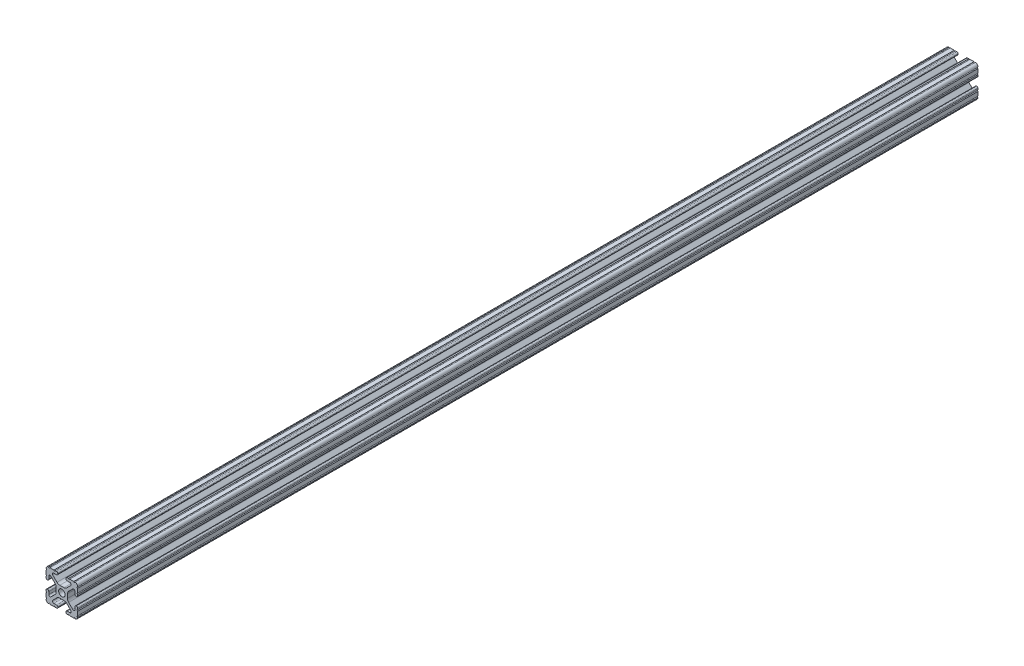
ISO-10303-21;
HEADER;
FILE_DESCRIPTION(('STEP AP214'),'2;1');
FILE_NAME('part.step','',(''),(''),'','','');
FILE_SCHEMA(('AUTOMOTIVE_DESIGN { 1 0 10303 214 1 1 1 1 }'));
ENDSEC;
DATA;
#1=APPLICATION_CONTEXT('core data for automotive mechanical design processes');
#2=APPLICATION_PROTOCOL_DEFINITION('international standard','automotive_design',2000,#1);
#3=PRODUCT_CONTEXT('',#1,'mechanical');
#4=PRODUCT('Part','Part','',(#3));
#5=PRODUCT_RELATED_PRODUCT_CATEGORY('part','',(#4));
#6=PRODUCT_DEFINITION_FORMATION('','',#4);
#7=PRODUCT_DEFINITION_CONTEXT('part definition',#1,'design');
#8=PRODUCT_DEFINITION('design','',#6,#7);
#9=PRODUCT_DEFINITION_SHAPE('','',#8);
#10=(LENGTH_UNIT() NAMED_UNIT(*) SI_UNIT(.MILLI.,.METRE.));
#11=(NAMED_UNIT(*) PLANE_ANGLE_UNIT() SI_UNIT($,.RADIAN.));
#12=(NAMED_UNIT(*) SI_UNIT($,.STERADIAN.) SOLID_ANGLE_UNIT());
#13=UNCERTAINTY_MEASURE_WITH_UNIT(LENGTH_MEASURE(1.E-05),#10,'distance_accuracy_value','');
#14=(GEOMETRIC_REPRESENTATION_CONTEXT(3) GLOBAL_UNCERTAINTY_ASSIGNED_CONTEXT((#13)) GLOBAL_UNIT_ASSIGNED_CONTEXT((#10,
#11,#12)) REPRESENTATION_CONTEXT('',''));
#15=CARTESIAN_POINT('',(0.,0.,0.));
#16=DIRECTION('',(0.,0.,1.));
#17=DIRECTION('',(1.,0.,0.));
#18=AXIS2_PLACEMENT_3D('',#15,#16,#17);
#19=CARTESIAN_POINT('',(-4.2875124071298,-10.4902000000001,757.331824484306));
#20=DIRECTION('',(0.,-1.,0.));
#21=DIRECTION('',(0.,0.,-1.));
#22=AXIS2_PLACEMENT_3D('',#19,#20,#21);
#23=PLANE('',#22);
#24=DIRECTION('',(-1.,0.,0.));
#25=VECTOR('',#24,1.);
#26=CARTESIAN_POINT('',(-4.2875124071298,-10.4902000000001,721.410800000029));
#27=LINE('',#26,#25);
#28=CARTESIAN_POINT('',(-4.2875124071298,-10.4902000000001,721.410800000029));
#29=VERTEX_POINT('',#28);
#30=CARTESIAN_POINT('',(-6.41640832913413,-10.4902000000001,721.410800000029));
#31=VERTEX_POINT('',#30);
#32=EDGE_CURVE('E629',#29,#31,#27,.T.);
#33=ORIENTED_EDGE('',*,*,#32,.F.);
#34=DIRECTION('',(0.,0.,-1.));
#35=VECTOR('',#34,1.);
#36=CARTESIAN_POINT('',(-4.2875124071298,-10.4902000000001,757.331824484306));
#37=LINE('',#36,#35);
#38=CARTESIAN_POINT('',(-4.2875124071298,-10.4902000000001,0.));
#39=VERTEX_POINT('',#38);
#40=EDGE_CURVE('E49',#29,#39,#37,.T.);
#41=ORIENTED_EDGE('',*,*,#40,.T.);
#42=DIRECTION('',(-1.,0.,0.));
#43=VECTOR('',#42,1.);
#44=CARTESIAN_POINT('',(-4.2875124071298,-10.4902000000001,0.));
#45=LINE('',#44,#43);
#46=CARTESIAN_POINT('',(-6.41640832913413,-10.4902000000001,0.));
#47=VERTEX_POINT('',#46);
#48=EDGE_CURVE('E632',#39,#47,#45,.T.);
#49=ORIENTED_EDGE('',*,*,#48,.T.);
#50=DIRECTION('',(0.,0.,-1.));
#51=VECTOR('',#50,1.);
#52=CARTESIAN_POINT('',(-6.41640832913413,-10.4902000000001,757.331824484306));
#53=LINE('',#52,#51);
#54=EDGE_CURVE('E626',#31,#47,#53,.T.);
#55=ORIENTED_EDGE('',*,*,#54,.F.);
#56=EDGE_LOOP('',(#33,#41,#49,#55));
#57=FACE_BOUND('',#56,.T.);
#58=ADVANCED_FACE('F33',(#57),#23,.F.);
#59=CARTESIAN_POINT('',(-4.2875124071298,-11.5392124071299,757.331824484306));
#60=DIRECTION('',(0.,0.,-1.));
#61=DIRECTION('',(-1.,0.,0.));
#62=AXIS2_PLACEMENT_3D('',#59,#60,#61);
#63=CYLINDRICAL_SURFACE('',#62,1.04901240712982);
#64=CARTESIAN_POINT('',(-4.2875124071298,-11.5392124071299,721.410800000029));
#65=DIRECTION('',(0.,0.,1.));
#66=DIRECTION('',(0.,-1.,0.));
#67=AXIS2_PLACEMENT_3D('',#64,#65,#66);
#68=CIRCLE('',#67,1.04901240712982);
#69=CARTESIAN_POINT('',(-3.23849999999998,-11.5392124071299,721.410800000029));
#70=VERTEX_POINT('',#69);
#71=EDGE_CURVE('E644',#70,#29,#68,.T.);
#72=ORIENTED_EDGE('',*,*,#71,.F.);
#73=DIRECTION('',(0.,0.,-1.));
#74=VECTOR('',#73,1.);
#75=CARTESIAN_POINT('',(-3.23849999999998,-11.5392124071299,757.331824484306));
#76=LINE('',#75,#74);
#77=CARTESIAN_POINT('',(-3.23849999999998,-11.5392124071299,0.));
#78=VERTEX_POINT('',#77);
#79=EDGE_CURVE('E1212',#70,#78,#76,.T.);
#80=ORIENTED_EDGE('',*,*,#79,.T.);
#81=CARTESIAN_POINT('',(-4.2875124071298,-11.5392124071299,0.));
#82=DIRECTION('',(0.,0.,1.));
#83=DIRECTION('',(1.,0.,0.));
#84=AXIS2_PLACEMENT_3D('',#81,#82,#83);
#85=CIRCLE('',#84,1.04901240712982);
#86=EDGE_CURVE('E1208',#78,#39,#85,.T.);
#87=ORIENTED_EDGE('',*,*,#86,.T.);
#88=ORIENTED_EDGE('',*,*,#40,.F.);
#89=EDGE_LOOP('',(#72,#80,#87,#88));
#90=FACE_BOUND('',#89,.T.);
#91=ADVANCED_FACE('F1770',(#90),#63,.T.);
#92=CARTESIAN_POINT('',(-3.23849999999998,-11.6509875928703,757.331824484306));
#93=DIRECTION('',(-1.,0.,0.));
#94=DIRECTION('',(0.,-1.,0.));
#95=AXIS2_PLACEMENT_3D('',#92,#93,#94);
#96=PLANE('',#95);
#97=DIRECTION('',(0.,1.,0.));
#98=VECTOR('',#97,1.);
#99=CARTESIAN_POINT('',(-3.23849999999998,-11.6509875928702,721.410800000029));
#100=LINE('',#99,#98);
#101=CARTESIAN_POINT('',(-3.23849999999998,-11.6509875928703,721.410800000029));
#102=VERTEX_POINT('',#101);
#103=EDGE_CURVE('E646',#102,#70,#100,.T.);
#104=ORIENTED_EDGE('',*,*,#103,.F.);
#105=DIRECTION('',(0.,0.,-1.));
#106=VECTOR('',#105,1.);
#107=CARTESIAN_POINT('',(-3.23849999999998,-11.6509875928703,757.331824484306));
#108=LINE('',#107,#106);
#109=CARTESIAN_POINT('',(-3.23849999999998,-11.6509875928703,0.));
#110=VERTEX_POINT('',#109);
#111=EDGE_CURVE('E1214',#102,#110,#108,.T.);
#112=ORIENTED_EDGE('',*,*,#111,.T.);
#113=DIRECTION('',(0.,1.,0.));
#114=VECTOR('',#113,1.);
#115=CARTESIAN_POINT('',(-3.23849999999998,-11.6509875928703,0.));
#116=LINE('',#115,#114);
#117=EDGE_CURVE('E1205',#110,#78,#116,.T.);
#118=ORIENTED_EDGE('',*,*,#117,.T.);
#119=ORIENTED_EDGE('',*,*,#79,.F.);
#120=EDGE_LOOP('',(#104,#112,#118,#119));
#121=FACE_BOUND('',#120,.T.);
#122=ADVANCED_FACE('F1767',(#121),#96,.F.);
#123=CARTESIAN_POINT('',(-4.2875124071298,-11.6509875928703,757.331824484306));
#124=DIRECTION('',(0.,0.,-1.));
#125=DIRECTION('',(-1.,0.,0.));
#126=AXIS2_PLACEMENT_3D('',#123,#124,#125);
#127=CYLINDRICAL_SURFACE('',#126,1.04901240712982);
#128=CARTESIAN_POINT('',(-4.2875124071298,-11.6509875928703,721.410800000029));
#129=DIRECTION('',(0.,0.,1.));
#130=DIRECTION('',(0.,-1.,0.));
#131=AXIS2_PLACEMENT_3D('',#128,#129,#130);
#132=CIRCLE('',#131,1.04901240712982);
#133=CARTESIAN_POINT('',(-4.2875124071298,-12.7000000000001,721.410800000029));
#134=VERTEX_POINT('',#133);
#135=EDGE_CURVE('E651',#134,#102,#132,.T.);
#136=ORIENTED_EDGE('',*,*,#135,.F.);
#137=DIRECTION('',(0.,0.,-1.));
#138=VECTOR('',#137,1.);
#139=CARTESIAN_POINT('',(-4.2875124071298,-12.7000000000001,757.331824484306));
#140=LINE('',#139,#138);
#141=CARTESIAN_POINT('',(-4.2875124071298,-12.7000000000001,0.));
#142=VERTEX_POINT('',#141);
#143=EDGE_CURVE('E1216',#134,#142,#140,.T.);
#144=ORIENTED_EDGE('',*,*,#143,.T.);
#145=CARTESIAN_POINT('',(-4.2875124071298,-11.6509875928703,0.));
#146=DIRECTION('',(0.,0.,1.));
#147=DIRECTION('',(1.,0.,0.));
#148=AXIS2_PLACEMENT_3D('',#145,#146,#147);
#149=CIRCLE('',#148,1.04901240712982);
#150=EDGE_CURVE('E1202',#142,#110,#149,.T.);
#151=ORIENTED_EDGE('',*,*,#150,.T.);
#152=ORIENTED_EDGE('',*,*,#111,.F.);
#153=EDGE_LOOP('',(#136,#144,#151,#152));
#154=FACE_BOUND('',#153,.T.);
#155=ADVANCED_FACE('F1763',(#154),#127,.T.);
#156=CARTESIAN_POINT('',(-5.31712671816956,-12.7000000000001,757.331824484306));
#157=DIRECTION('',(0.,1.,0.));
#158=DIRECTION('',(-1.,0.,0.));
#159=AXIS2_PLACEMENT_3D('',#156,#157,#158);
#160=PLANE('',#159);
#161=DIRECTION('',(1.,0.,0.));
#162=VECTOR('',#161,1.);
#163=CARTESIAN_POINT('',(-5.31712671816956,-12.7000000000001,721.410800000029));
#164=LINE('',#163,#162);
#165=CARTESIAN_POINT('',(-5.31712671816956,-12.7000000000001,721.410800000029));
#166=VERTEX_POINT('',#165);
#167=EDGE_CURVE('E654',#166,#134,#164,.T.);
#168=ORIENTED_EDGE('',*,*,#167,.F.);
#169=DIRECTION('',(0.,0.,-1.));
#170=VECTOR('',#169,1.);
#171=CARTESIAN_POINT('',(-5.31712671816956,-12.7000000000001,757.331824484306));
#172=LINE('',#171,#170);
#173=CARTESIAN_POINT('',(-5.31712671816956,-12.7000000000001,0.));
#174=VERTEX_POINT('',#173);
#175=EDGE_CURVE('E1218',#166,#174,#172,.T.);
#176=ORIENTED_EDGE('',*,*,#175,.T.);
#177=DIRECTION('',(1.,0.,0.));
#178=VECTOR('',#177,1.);
#179=CARTESIAN_POINT('',(-5.31712671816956,-12.7000000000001,0.));
#180=LINE('',#179,#178);
#181=EDGE_CURVE('E1199',#174,#142,#180,.T.);
#182=ORIENTED_EDGE('',*,*,#181,.T.);
#183=ORIENTED_EDGE('',*,*,#143,.F.);
#184=EDGE_LOOP('',(#168,#176,#182,#183));
#185=FACE_BOUND('',#184,.T.);
#186=ADVANCED_FACE('F1760',(#185),#160,.F.);
#187=CARTESIAN_POINT('',(-5.82512671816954,-12.7000000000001,757.331824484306));
#188=DIRECTION('',(0.,0.,-1.));
#189=DIRECTION('',(-1.,0.,0.));
#190=AXIS2_PLACEMENT_3D('',#187,#188,#189);
#191=CYLINDRICAL_SURFACE('',#190,0.507999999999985);
#192=CARTESIAN_POINT('',(-5.82512671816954,-12.7000000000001,721.410800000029));
#193=DIRECTION('',(0.,0.,1.));
#194=DIRECTION('',(0.,-1.,0.));
#195=AXIS2_PLACEMENT_3D('',#192,#193,#194);
#196=CIRCLE('',#195,0.507999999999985);
#197=CARTESIAN_POINT('',(-6.33312671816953,-12.7000000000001,721.410800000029));
#198=VERTEX_POINT('',#197);
#199=EDGE_CURVE('E657',#198,#166,#196,.F.);
#200=ORIENTED_EDGE('',*,*,#199,.F.);
#201=DIRECTION('',(0.,0.,-1.));
#202=VECTOR('',#201,1.);
#203=CARTESIAN_POINT('',(-6.33312671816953,-12.7000000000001,757.331824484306));
#204=LINE('',#203,#202);
#205=CARTESIAN_POINT('',(-6.33312671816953,-12.7000000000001,0.));
#206=VERTEX_POINT('',#205);
#207=EDGE_CURVE('E1220',#198,#206,#204,.T.);
#208=ORIENTED_EDGE('',*,*,#207,.T.);
#209=CARTESIAN_POINT('',(-5.82512671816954,-12.7000000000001,0.));
#210=DIRECTION('',(0.,0.,-1.));
#211=DIRECTION('',(1.,0.,0.));
#212=AXIS2_PLACEMENT_3D('',#209,#210,#211);
#213=CIRCLE('',#212,0.507999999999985);
#214=EDGE_CURVE('E1196',#206,#174,#213,.T.);
#215=ORIENTED_EDGE('',*,*,#214,.T.);
#216=ORIENTED_EDGE('',*,*,#175,.F.);
#217=EDGE_LOOP('',(#200,#208,#215,#216));
#218=FACE_BOUND('',#217,.T.);
#219=ADVANCED_FACE('F1755',(#218),#191,.F.);
#220=CARTESIAN_POINT('',(-9.55044311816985,-12.7000000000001,757.331824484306));
#221=DIRECTION('',(0.,1.,0.));
#222=DIRECTION('',(0.,0.,1.));
#223=AXIS2_PLACEMENT_3D('',#220,#221,#222);
#224=PLANE('',#223);
#225=DIRECTION('',(1.,0.,0.));
#226=VECTOR('',#225,1.);
#227=CARTESIAN_POINT('',(-9.55044311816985,-12.7000000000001,721.410800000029));
#228=LINE('',#227,#226);
#229=CARTESIAN_POINT('',(-9.55044311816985,-12.7000000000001,721.410800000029));
#230=VERTEX_POINT('',#229);
#231=EDGE_CURVE('E660',#230,#198,#228,.T.);
#232=ORIENTED_EDGE('',*,*,#231,.F.);
#233=DIRECTION('',(0.,0.,-1.));
#234=VECTOR('',#233,1.);
#235=CARTESIAN_POINT('',(-9.55044311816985,-12.7000000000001,757.331824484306));
#236=LINE('',#235,#234);
#237=CARTESIAN_POINT('',(-9.55044311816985,-12.7000000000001,0.));
#238=VERTEX_POINT('',#237);
#239=EDGE_CURVE('E1222',#230,#238,#236,.T.);
#240=ORIENTED_EDGE('',*,*,#239,.T.);
#241=DIRECTION('',(1.,0.,0.));
#242=VECTOR('',#241,1.);
#243=CARTESIAN_POINT('',(-9.55044311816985,-12.7000000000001,0.));
#244=LINE('',#243,#242);
#245=EDGE_CURVE('E1193',#238,#206,#244,.T.);
#246=ORIENTED_EDGE('',*,*,#245,.T.);
#247=ORIENTED_EDGE('',*,*,#207,.F.);
#248=EDGE_LOOP('',(#232,#240,#246,#247));
#249=FACE_BOUND('',#248,.T.);
#250=ADVANCED_FACE('F1751',(#249),#224,.F.);
#251=CARTESIAN_POINT('',(-10.0584431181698,-12.7000000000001,757.331824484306));
#252=DIRECTION('',(0.,0.,-1.));
#253=DIRECTION('',(-1.,0.,0.));
#254=AXIS2_PLACEMENT_3D('',#251,#252,#253);
#255=CYLINDRICAL_SURFACE('',#254,0.507999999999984);
#256=CARTESIAN_POINT('',(-10.0584431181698,-12.7000000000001,721.410800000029));
#257=DIRECTION('',(0.,0.,1.));
#258=DIRECTION('',(0.,-1.,0.));
#259=AXIS2_PLACEMENT_3D('',#256,#257,#258);
#260=CIRCLE('',#259,0.507999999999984);
#261=CARTESIAN_POINT('',(-10.5664430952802,-12.6998475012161,721.410800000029));
#262=VERTEX_POINT('',#261);
#263=EDGE_CURVE('E663',#262,#230,#260,.F.);
#264=ORIENTED_EDGE('',*,*,#263,.F.);
#265=DIRECTION('',(0.,0.,-1.));
#266=VECTOR('',#265,1.);
#267=CARTESIAN_POINT('',(-10.5664430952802,-12.6998475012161,757.331824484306));
#268=LINE('',#267,#266);
#269=CARTESIAN_POINT('',(-10.5664430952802,-12.6998475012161,0.));
#270=VERTEX_POINT('',#269);
#271=EDGE_CURVE('E1224',#262,#270,#268,.T.);
#272=ORIENTED_EDGE('',*,*,#271,.T.);
#273=CARTESIAN_POINT('',(-10.0584431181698,-12.7000000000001,0.));
#274=DIRECTION('',(0.,0.,-1.));
#275=DIRECTION('',(1.,0.,0.));
#276=AXIS2_PLACEMENT_3D('',#273,#274,#275);
#277=CIRCLE('',#276,0.507999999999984);
#278=EDGE_CURVE('E1190',#270,#238,#277,.T.);
#279=ORIENTED_EDGE('',*,*,#278,.T.);
#280=ORIENTED_EDGE('',*,*,#239,.F.);
#281=EDGE_LOOP('',(#264,#272,#279,#280));
#282=FACE_BOUND('',#281,.T.);
#283=ADVANCED_FACE('F1748',(#282),#255,.F.);
#284=CARTESIAN_POINT('',(-10.5918000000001,-10.5918000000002,757.331824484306));
#285=DIRECTION('',(0.,0.,-1.));
#286=DIRECTION('',(-1.,0.,0.));
#287=AXIS2_PLACEMENT_3D('',#284,#285,#286);
#288=CYLINDRICAL_SURFACE('',#287,2.1081999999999);
#289=CARTESIAN_POINT('',(-10.5918000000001,-10.5918000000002,721.410800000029));
#290=DIRECTION('',(0.,0.,1.));
#291=DIRECTION('',(0.,-1.,0.));
#292=AXIS2_PLACEMENT_3D('',#289,#290,#291);
#293=CIRCLE('',#292,2.1081999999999);
#294=CARTESIAN_POINT('',(-12.699846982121,-10.5663999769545,721.410800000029));
#295=VERTEX_POINT('',#294);
#296=EDGE_CURVE('E666',#295,#262,#293,.T.);
#297=ORIENTED_EDGE('',*,*,#296,.F.);
#298=DIRECTION('',(0.,0.,-1.));
#299=VECTOR('',#298,1.);
#300=CARTESIAN_POINT('',(-12.699846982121,-10.5663999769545,757.331824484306));
#301=LINE('',#300,#299);
#302=CARTESIAN_POINT('',(-12.699846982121,-10.5663999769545,0.));
#303=VERTEX_POINT('',#302);
#304=EDGE_CURVE('E1226',#295,#303,#301,.T.);
#305=ORIENTED_EDGE('',*,*,#304,.T.);
#306=CARTESIAN_POINT('',(-10.5918000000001,-10.5918000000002,0.));
#307=DIRECTION('',(0.,0.,1.));
#308=DIRECTION('',(1.,0.,0.));
#309=AXIS2_PLACEMENT_3D('',#306,#307,#308);
#310=CIRCLE('',#309,2.1081999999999);
#311=EDGE_CURVE('E1187',#303,#270,#310,.T.);
#312=ORIENTED_EDGE('',*,*,#311,.T.);
#313=ORIENTED_EDGE('',*,*,#271,.F.);
#314=EDGE_LOOP('',(#297,#305,#312,#313));
#315=FACE_BOUND('',#314,.T.);
#316=ADVANCED_FACE('F1743',(#315),#288,.T.);
#317=CARTESIAN_POINT('',(-12.7,-10.0584000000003,757.331824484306));
#318=DIRECTION('',(0.,0.,-1.));
#319=DIRECTION('',(-1.,0.,0.));
#320=AXIS2_PLACEMENT_3D('',#317,#318,#319);
#321=CYLINDRICAL_SURFACE('',#320,0.507999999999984);
#322=CARTESIAN_POINT('',(-12.7,-10.0584000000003,721.410800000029));
#323=DIRECTION('',(0.,0.,1.));
#324=DIRECTION('',(0.,-1.,0.));
#325=AXIS2_PLACEMENT_3D('',#322,#323,#324);
#326=CIRCLE('',#325,0.507999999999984);
#327=CARTESIAN_POINT('',(-12.7,-9.5504000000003,721.410800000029));
#328=VERTEX_POINT('',#327);
#329=EDGE_CURVE('E669',#328,#295,#326,.F.);
#330=ORIENTED_EDGE('',*,*,#329,.F.);
#331=DIRECTION('',(0.,0.,-1.));
#332=VECTOR('',#331,1.);
#333=CARTESIAN_POINT('',(-12.7,-9.5504000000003,757.331824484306));
#334=LINE('',#333,#332);
#335=CARTESIAN_POINT('',(-12.7,-9.5504000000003,0.));
#336=VERTEX_POINT('',#335);
#337=EDGE_CURVE('E1228',#328,#336,#334,.T.);
#338=ORIENTED_EDGE('',*,*,#337,.T.);
#339=CARTESIAN_POINT('',(-12.7,-10.0584000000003,0.));
#340=DIRECTION('',(0.,0.,-1.));
#341=DIRECTION('',(1.,0.,0.));
#342=AXIS2_PLACEMENT_3D('',#339,#340,#341);
#343=CIRCLE('',#342,0.507999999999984);
#344=EDGE_CURVE('E1184',#336,#303,#343,.T.);
#345=ORIENTED_EDGE('',*,*,#344,.T.);
#346=ORIENTED_EDGE('',*,*,#304,.F.);
#347=EDGE_LOOP('',(#330,#338,#345,#346));
#348=FACE_BOUND('',#347,.T.);
#349=ADVANCED_FACE('F1739',(#348),#321,.F.);
#350=CARTESIAN_POINT('',(-12.7,-6.33308359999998,757.331824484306));
#351=DIRECTION('',(1.,0.,0.));
#352=DIRECTION('',(0.,1.,0.));
#353=AXIS2_PLACEMENT_3D('',#350,#351,#352);
#354=PLANE('',#353);
#355=DIRECTION('',(0.,-1.,0.));
#356=VECTOR('',#355,1.);
#357=CARTESIAN_POINT('',(-12.7,-6.33308359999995,721.410800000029));
#358=LINE('',#357,#356);
#359=CARTESIAN_POINT('',(-12.7,-6.33308359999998,721.410800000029));
#360=VERTEX_POINT('',#359);
#361=EDGE_CURVE('E672',#360,#328,#358,.T.);
#362=ORIENTED_EDGE('',*,*,#361,.F.);
#363=DIRECTION('',(0.,0.,-1.));
#364=VECTOR('',#363,1.);
#365=CARTESIAN_POINT('',(-12.7,-6.33308359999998,757.331824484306));
#366=LINE('',#365,#364);
#367=CARTESIAN_POINT('',(-12.7,-6.33308359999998,0.));
#368=VERTEX_POINT('',#367);
#369=EDGE_CURVE('E1230',#360,#368,#366,.T.);
#370=ORIENTED_EDGE('',*,*,#369,.T.);
#371=DIRECTION('',(0.,-1.,0.));
#372=VECTOR('',#371,1.);
#373=CARTESIAN_POINT('',(-12.7,-6.33308359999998,0.));
#374=LINE('',#373,#372);
#375=EDGE_CURVE('E1181',#368,#336,#374,.T.);
#376=ORIENTED_EDGE('',*,*,#375,.T.);
#377=ORIENTED_EDGE('',*,*,#337,.F.);
#378=EDGE_LOOP('',(#362,#370,#376,#377));
#379=FACE_BOUND('',#378,.T.);
#380=ADVANCED_FACE('F1736',(#379),#354,.F.);
#381=CARTESIAN_POINT('',(-12.7,-5.8250836,757.331824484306));
#382=DIRECTION('',(0.,0.,-1.));
#383=DIRECTION('',(-1.,0.,0.));
#384=AXIS2_PLACEMENT_3D('',#381,#382,#383);
#385=CYLINDRICAL_SURFACE('',#384,0.507999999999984);
#386=CARTESIAN_POINT('',(-12.7,-5.8250836,721.410800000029));
#387=DIRECTION('',(0.,0.,1.));
#388=DIRECTION('',(0.,-1.,0.));
#389=AXIS2_PLACEMENT_3D('',#386,#387,#388);
#390=CIRCLE('',#389,0.507999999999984);
#391=CARTESIAN_POINT('',(-12.7,-5.31708360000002,721.410800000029));
#392=VERTEX_POINT('',#391);
#393=EDGE_CURVE('E675',#392,#360,#390,.F.);
#394=ORIENTED_EDGE('',*,*,#393,.F.);
#395=DIRECTION('',(0.,0.,-1.));
#396=VECTOR('',#395,1.);
#397=CARTESIAN_POINT('',(-12.7,-5.31708360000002,757.331824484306));
#398=LINE('',#397,#396);
#399=CARTESIAN_POINT('',(-12.7,-5.31708360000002,0.));
#400=VERTEX_POINT('',#399);
#401=EDGE_CURVE('E1232',#392,#400,#398,.T.);
#402=ORIENTED_EDGE('',*,*,#401,.T.);
#403=CARTESIAN_POINT('',(-12.7,-5.8250836,0.));
#404=DIRECTION('',(0.,0.,-1.));
#405=DIRECTION('',(1.,0.,0.));
#406=AXIS2_PLACEMENT_3D('',#403,#404,#405);
#407=CIRCLE('',#406,0.507999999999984);
#408=EDGE_CURVE('E1178',#400,#368,#407,.T.);
#409=ORIENTED_EDGE('',*,*,#408,.T.);
#410=ORIENTED_EDGE('',*,*,#369,.F.);
#411=EDGE_LOOP('',(#394,#402,#409,#410));
#412=FACE_BOUND('',#411,.T.);
#413=ADVANCED_FACE('F1731',(#412),#385,.F.);
#414=CARTESIAN_POINT('',(-12.7,-4.28746928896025,757.331824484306));
#415=DIRECTION('',(1.,0.,0.));
#416=DIRECTION('',(0.,1.,0.));
#417=AXIS2_PLACEMENT_3D('',#414,#415,#416);
#418=PLANE('',#417);
#419=DIRECTION('',(0.,-1.,0.));
#420=VECTOR('',#419,1.);
#421=CARTESIAN_POINT('',(-12.7,-4.28746928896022,721.410800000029));
#422=LINE('',#421,#420);
#423=CARTESIAN_POINT('',(-12.7,-4.28746928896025,721.410800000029));
#424=VERTEX_POINT('',#423);
#425=EDGE_CURVE('E678',#424,#392,#422,.T.);
#426=ORIENTED_EDGE('',*,*,#425,.F.);
#427=DIRECTION('',(0.,0.,-1.));
#428=VECTOR('',#427,1.);
#429=CARTESIAN_POINT('',(-12.7,-4.28746928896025,757.331824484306));
#430=LINE('',#429,#428);
#431=CARTESIAN_POINT('',(-12.7,-4.28746928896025,0.));
#432=VERTEX_POINT('',#431);
#433=EDGE_CURVE('E1234',#424,#432,#430,.T.);
#434=ORIENTED_EDGE('',*,*,#433,.T.);
#435=DIRECTION('',(0.,-1.,0.));
#436=VECTOR('',#435,1.);
#437=CARTESIAN_POINT('',(-12.7,-4.28746928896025,0.));
#438=LINE('',#437,#436);
#439=EDGE_CURVE('E1175',#432,#400,#438,.T.);
#440=ORIENTED_EDGE('',*,*,#439,.T.);
#441=ORIENTED_EDGE('',*,*,#401,.F.);
#442=EDGE_LOOP('',(#426,#434,#440,#441));
#443=FACE_BOUND('',#442,.T.);
#444=ADVANCED_FACE('F1727',(#443),#418,.F.);
#445=CARTESIAN_POINT('',(-11.6509875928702,-4.28746928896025,757.331824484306));
#446=DIRECTION('',(0.,0.,-1.));
#447=DIRECTION('',(-1.,0.,0.));
#448=AXIS2_PLACEMENT_3D('',#445,#446,#447);
#449=CYLINDRICAL_SURFACE('',#448,1.04901240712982);
#450=CARTESIAN_POINT('',(-11.6509875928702,-4.28746928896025,721.410800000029));
#451=DIRECTION('',(0.,0.,1.));
#452=DIRECTION('',(0.,-1.,0.));
#453=AXIS2_PLACEMENT_3D('',#450,#451,#452);
#454=CIRCLE('',#453,1.04901240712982);
#455=CARTESIAN_POINT('',(-11.6509875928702,-3.23845688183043,721.410800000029));
#456=VERTEX_POINT('',#455);
#457=EDGE_CURVE('E681',#456,#424,#454,.T.);
#458=ORIENTED_EDGE('',*,*,#457,.F.);
#459=DIRECTION('',(0.,0.,-1.));
#460=VECTOR('',#459,1.);
#461=CARTESIAN_POINT('',(-11.6509875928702,-3.23845688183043,757.331824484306));
#462=LINE('',#461,#460);
#463=CARTESIAN_POINT('',(-11.6509875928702,-3.23845688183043,0.));
#464=VERTEX_POINT('',#463);
#465=EDGE_CURVE('E1236',#456,#464,#462,.T.);
#466=ORIENTED_EDGE('',*,*,#465,.T.);
#467=CARTESIAN_POINT('',(-11.6509875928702,-4.28746928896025,0.));
#468=DIRECTION('',(0.,0.,1.));
#469=DIRECTION('',(1.,0.,0.));
#470=AXIS2_PLACEMENT_3D('',#467,#468,#469);
#471=CIRCLE('',#470,1.04901240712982);
#472=EDGE_CURVE('E1172',#464,#432,#471,.T.);
#473=ORIENTED_EDGE('',*,*,#472,.T.);
#474=ORIENTED_EDGE('',*,*,#433,.F.);
#475=EDGE_LOOP('',(#458,#466,#473,#474));
#476=FACE_BOUND('',#475,.T.);
#477=ADVANCED_FACE('F1724',(#476),#449,.T.);
#478=CARTESIAN_POINT('',(-11.5392124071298,-3.23845688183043,757.331824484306));
#479=DIRECTION('',(0.,-1.,0.));
#480=DIRECTION('',(0.,0.,-1.));
#481=AXIS2_PLACEMENT_3D('',#478,#479,#480);
#482=PLANE('',#481);
#483=DIRECTION('',(-1.,0.,0.));
#484=VECTOR('',#483,1.);
#485=CARTESIAN_POINT('',(-11.5392124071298,-3.23845688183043,721.410800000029));
#486=LINE('',#485,#484);
#487=CARTESIAN_POINT('',(-11.5392124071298,-3.23845688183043,721.410800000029));
#488=VERTEX_POINT('',#487);
#489=EDGE_CURVE('E684',#488,#456,#486,.T.);
#490=ORIENTED_EDGE('',*,*,#489,.F.);
#491=DIRECTION('',(0.,0.,-1.));
#492=VECTOR('',#491,1.);
#493=CARTESIAN_POINT('',(-11.5392124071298,-3.23845688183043,757.331824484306));
#494=LINE('',#493,#492);
#495=CARTESIAN_POINT('',(-11.5392124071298,-3.23845688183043,0.));
#496=VERTEX_POINT('',#495);
#497=EDGE_CURVE('E1238',#488,#496,#494,.T.);
#498=ORIENTED_EDGE('',*,*,#497,.T.);
#499=DIRECTION('',(-1.,0.,0.));
#500=VECTOR('',#499,1.);
#501=CARTESIAN_POINT('',(-11.5392124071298,-3.23845688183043,0.));
#502=LINE('',#501,#500);
#503=EDGE_CURVE('E1169',#496,#464,#502,.T.);
#504=ORIENTED_EDGE('',*,*,#503,.T.);
#505=ORIENTED_EDGE('',*,*,#465,.F.);
#506=EDGE_LOOP('',(#490,#498,#504,#505));
#507=FACE_BOUND('',#506,.T.);
#508=ADVANCED_FACE('F1719',(#507),#482,.F.);
#509=CARTESIAN_POINT('',(-11.5392124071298,-4.28746928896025,757.331824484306));
#510=DIRECTION('',(0.,0.,-1.));
#511=DIRECTION('',(-1.,0.,0.));
#512=AXIS2_PLACEMENT_3D('',#509,#510,#511);
#513=CYLINDRICAL_SURFACE('',#512,1.04901240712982);
#514=CARTESIAN_POINT('',(-11.5392124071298,-4.28746928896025,721.410800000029));
#515=DIRECTION('',(0.,0.,1.));
#516=DIRECTION('',(0.,-1.,0.));
#517=AXIS2_PLACEMENT_3D('',#514,#515,#516);
#518=CIRCLE('',#517,1.04901240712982);
#519=CARTESIAN_POINT('',(-10.4902,-4.28746928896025,721.410800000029));
#520=VERTEX_POINT('',#519);
#521=EDGE_CURVE('E687',#520,#488,#518,.T.);
#522=ORIENTED_EDGE('',*,*,#521,.F.);
#523=DIRECTION('',(0.,0.,-1.));
#524=VECTOR('',#523,1.);
#525=CARTESIAN_POINT('',(-10.4902,-4.28746928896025,757.331824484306));
#526=LINE('',#525,#524);
#527=CARTESIAN_POINT('',(-10.4902,-4.28746928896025,0.));
#528=VERTEX_POINT('',#527);
#529=EDGE_CURVE('E1240',#520,#528,#526,.T.);
#530=ORIENTED_EDGE('',*,*,#529,.T.);
#531=CARTESIAN_POINT('',(-11.5392124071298,-4.28746928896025,0.));
#532=DIRECTION('',(0.,0.,1.));
#533=DIRECTION('',(1.,0.,0.));
#534=AXIS2_PLACEMENT_3D('',#531,#532,#533);
#535=CIRCLE('',#534,1.04901240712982);
#536=EDGE_CURVE('E1166',#528,#496,#535,.T.);
#537=ORIENTED_EDGE('',*,*,#536,.T.);
#538=ORIENTED_EDGE('',*,*,#497,.F.);
#539=EDGE_LOOP('',(#522,#530,#537,#538));
#540=FACE_BOUND('',#539,.T.);
#541=ADVANCED_FACE('F1715',(#540),#513,.T.);
#542=CARTESIAN_POINT('',(-10.4902,-6.4020890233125,757.331824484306));
#543=DIRECTION('',(-1.,0.,0.));
#544=DIRECTION('',(0.,0.,1.));
#545=AXIS2_PLACEMENT_3D('',#542,#543,#544);
#546=PLANE('',#545);
#547=DIRECTION('',(0.,1.,0.));
#548=VECTOR('',#547,1.);
#549=CARTESIAN_POINT('',(-10.4902,-6.40208902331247,721.410800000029));
#550=LINE('',#549,#548);
#551=CARTESIAN_POINT('',(-10.4902,-6.4020890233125,721.410800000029));
#552=VERTEX_POINT('',#551);
#553=EDGE_CURVE('E690',#552,#520,#550,.T.);
#554=ORIENTED_EDGE('',*,*,#553,.F.);
#555=DIRECTION('',(0.,0.,-1.));
#556=VECTOR('',#555,1.);
#557=CARTESIAN_POINT('',(-10.4902,-6.4020890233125,757.331824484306));
#558=LINE('',#557,#556);
#559=CARTESIAN_POINT('',(-10.4902,-6.4020890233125,0.));
#560=VERTEX_POINT('',#559);
#561=EDGE_CURVE('E1242',#552,#560,#558,.T.);
#562=ORIENTED_EDGE('',*,*,#561,.T.);
#563=DIRECTION('',(0.,1.,0.));
#564=VECTOR('',#563,1.);
#565=CARTESIAN_POINT('',(-10.4902,-6.4020890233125,0.));
#566=LINE('',#565,#564);
#567=EDGE_CURVE('E1163',#560,#528,#566,.T.);
#568=ORIENTED_EDGE('',*,*,#567,.T.);
#569=ORIENTED_EDGE('',*,*,#529,.F.);
#570=EDGE_LOOP('',(#554,#562,#568,#569));
#571=FACE_BOUND('',#570,.T.);
#572=ADVANCED_FACE('F1712',(#571),#546,.F.);
#573=CARTESIAN_POINT('',(-9.4627890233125,-6.4020890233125,757.331824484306));
#574=DIRECTION('',(0.,0.,-1.));
#575=DIRECTION('',(-1.,0.,0.));
#576=AXIS2_PLACEMENT_3D('',#573,#574,#575);
#577=CYLINDRICAL_SURFACE('',#576,1.0274109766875);
#578=CARTESIAN_POINT('',(-9.4627890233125,-6.4020890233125,721.410800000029));
#579=DIRECTION('',(0.,0.,1.));
#580=DIRECTION('',(0.,-1.,0.));
#581=AXIS2_PLACEMENT_3D('',#578,#579,#580);
#582=CIRCLE('',#581,1.0274109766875);
#583=CARTESIAN_POINT('',(-8.7371313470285,-7.12940893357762,721.410800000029));
#584=VERTEX_POINT('',#583);
#585=EDGE_CURVE('E693',#584,#552,#582,.F.);
#586=ORIENTED_EDGE('',*,*,#585,.F.);
#587=DIRECTION('',(0.,0.,-1.));
#588=VECTOR('',#587,1.);
#589=CARTESIAN_POINT('',(-8.7371313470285,-7.12940893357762,757.331824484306));
#590=LINE('',#589,#588);
#591=CARTESIAN_POINT('',(-8.7371313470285,-7.12940893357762,0.));
#592=VERTEX_POINT('',#591);
#593=EDGE_CURVE('E1244',#584,#592,#590,.T.);
#594=ORIENTED_EDGE('',*,*,#593,.T.);
#595=CARTESIAN_POINT('',(-9.4627890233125,-6.4020890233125,0.));
#596=DIRECTION('',(0.,0.,-1.));
#597=DIRECTION('',(1.,0.,0.));
#598=AXIS2_PLACEMENT_3D('',#595,#596,#597);
#599=CIRCLE('',#598,1.0274109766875);
#600=EDGE_CURVE('E1160',#592,#560,#599,.T.);
#601=ORIENTED_EDGE('',*,*,#600,.T.);
#602=ORIENTED_EDGE('',*,*,#561,.F.);
#603=EDGE_LOOP('',(#586,#594,#601,#602));
#604=FACE_BOUND('',#603,.T.);
#605=ADVANCED_FACE('F1707',(#604),#577,.F.);
#606=CARTESIAN_POINT('',(-5.44100583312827,-3.84081646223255,757.331824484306));
#607=DIRECTION('',(0.706297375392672,-0.707915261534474,0.));
#608=DIRECTION('',(0.707915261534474,0.706297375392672,0.));
#609=AXIS2_PLACEMENT_3D('',#606,#607,#608);
#610=PLANE('',#609);
#611=DIRECTION('',(-0.707915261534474,-0.706297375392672,0.));
#612=VECTOR('',#611,1.);
#613=CARTESIAN_POINT('',(-5.44100583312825,-3.84081646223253,721.410800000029));
#614=LINE('',#613,#612);
#615=CARTESIAN_POINT('',(-5.44100583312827,-3.84081646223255,721.410800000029));
#616=VERTEX_POINT('',#615);
#617=EDGE_CURVE('E696',#616,#584,#614,.T.);
#618=ORIENTED_EDGE('',*,*,#617,.F.);
#619=DIRECTION('',(0.,0.,-1.));
#620=VECTOR('',#619,1.);
#621=CARTESIAN_POINT('',(-5.44100583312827,-3.84081646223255,757.331824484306));
#622=LINE('',#621,#620);
#623=CARTESIAN_POINT('',(-5.44100583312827,-3.84081646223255,0.));
#624=VERTEX_POINT('',#623);
#625=EDGE_CURVE('E1246',#616,#624,#622,.T.);
#626=ORIENTED_EDGE('',*,*,#625,.T.);
#627=DIRECTION('',(-0.707915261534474,-0.706297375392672,0.));
#628=VECTOR('',#627,1.);
#629=CARTESIAN_POINT('',(-5.44100583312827,-3.84081646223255,0.));
#630=LINE('',#629,#628);
#631=EDGE_CURVE('E1157',#624,#592,#630,.T.);
#632=ORIENTED_EDGE('',*,*,#631,.T.);
#633=ORIENTED_EDGE('',*,*,#593,.F.);
#634=EDGE_LOOP('',(#618,#626,#632,#633));
#635=FACE_BOUND('',#634,.T.);
#636=ADVANCED_FACE('F1703',(#635),#610,.F.);
#637=CARTESIAN_POINT('',(-7.68350000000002,-1.59318550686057,757.331824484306));
#638=DIRECTION('',(0.,0.,-1.));
#639=DIRECTION('',(-1.,0.,0.));
#640=AXIS2_PLACEMENT_3D('',#637,#638,#639);
#641=CYLINDRICAL_SURFACE('',#640,3.17500000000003);
#642=CARTESIAN_POINT('',(-7.68350000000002,-1.59318550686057,721.410800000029));
#643=DIRECTION('',(0.,0.,1.));
#644=DIRECTION('',(0.,-1.,0.));
#645=AXIS2_PLACEMENT_3D('',#642,#643,#644);
#646=CIRCLE('',#645,3.17500000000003);
#647=CARTESIAN_POINT('',(-4.5085,-1.59318550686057,721.410800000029));
#648=VERTEX_POINT('',#647);
#649=EDGE_CURVE('E699',#648,#616,#646,.F.);
#650=ORIENTED_EDGE('',*,*,#649,.F.);
#651=DIRECTION('',(0.,0.,-1.));
#652=VECTOR('',#651,1.);
#653=CARTESIAN_POINT('',(-4.5085,-1.59318550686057,757.331824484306));
#654=LINE('',#653,#652);
#655=CARTESIAN_POINT('',(-4.5085,-1.59318550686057,0.));
#656=VERTEX_POINT('',#655);
#657=EDGE_CURVE('E1248',#648,#656,#654,.T.);
#658=ORIENTED_EDGE('',*,*,#657,.T.);
#659=CARTESIAN_POINT('',(-7.68350000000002,-1.59318550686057,0.));
#660=DIRECTION('',(0.,0.,-1.));
#661=DIRECTION('',(1.,0.,0.));
#662=AXIS2_PLACEMENT_3D('',#659,#660,#661);
#663=CIRCLE('',#662,3.17500000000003);
#664=EDGE_CURVE('E1154',#656,#624,#663,.T.);
#665=ORIENTED_EDGE('',*,*,#664,.T.);
#666=ORIENTED_EDGE('',*,*,#625,.F.);
#667=EDGE_LOOP('',(#650,#658,#665,#666));
#668=FACE_BOUND('',#667,.T.);
#669=ADVANCED_FACE('F1700',(#668),#641,.F.);
#670=CARTESIAN_POINT('',(-4.5085,1.59318550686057,757.331824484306));
#671=DIRECTION('',(1.,0.,0.));
#672=DIRECTION('',(0.,1.,0.));
#673=AXIS2_PLACEMENT_3D('',#670,#671,#672);
#674=PLANE('',#673);
#675=DIRECTION('',(0.,-1.,0.));
#676=VECTOR('',#675,1.);
#677=CARTESIAN_POINT('',(-4.5085,1.59318550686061,721.410800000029));
#678=LINE('',#677,#676);
#679=CARTESIAN_POINT('',(-4.50850000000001,1.59318550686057,721.410800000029));
#680=VERTEX_POINT('',#679);
#681=EDGE_CURVE('E702',#680,#648,#678,.T.);
#682=ORIENTED_EDGE('',*,*,#681,.F.);
#683=DIRECTION('',(0.,0.,-1.));
#684=VECTOR('',#683,1.);
#685=CARTESIAN_POINT('',(-4.50850000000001,1.59318550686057,757.331824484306));
#686=LINE('',#685,#684);
#687=CARTESIAN_POINT('',(-4.50850000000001,1.59318550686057,0.));
#688=VERTEX_POINT('',#687);
#689=EDGE_CURVE('E1250',#680,#688,#686,.T.);
#690=ORIENTED_EDGE('',*,*,#689,.T.);
#691=DIRECTION('',(0.,-1.,0.));
#692=VECTOR('',#691,1.);
#693=CARTESIAN_POINT('',(-4.5085,1.59318550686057,0.));
#694=LINE('',#693,#692);
#695=EDGE_CURVE('E1151',#688,#656,#694,.T.);
#696=ORIENTED_EDGE('',*,*,#695,.T.);
#697=ORIENTED_EDGE('',*,*,#657,.F.);
#698=EDGE_LOOP('',(#682,#690,#696,#697));
#699=FACE_BOUND('',#698,.T.);
#700=ADVANCED_FACE('F1695',(#699),#674,.F.);
#701=CARTESIAN_POINT('',(-7.68350000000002,1.59318550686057,757.331824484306));
#702=DIRECTION('',(0.,0.,-1.));
#703=DIRECTION('',(-1.,0.,0.));
#704=AXIS2_PLACEMENT_3D('',#701,#702,#703);
#705=CYLINDRICAL_SURFACE('',#704,3.17500000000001);
#706=CARTESIAN_POINT('',(-7.68350000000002,1.59318550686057,721.410800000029));
#707=DIRECTION('',(0.,0.,1.));
#708=DIRECTION('',(0.,-1.,0.));
#709=AXIS2_PLACEMENT_3D('',#706,#707,#708);
#710=CIRCLE('',#709,3.17500000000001);
#711=CARTESIAN_POINT('',(-5.44100583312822,3.84081646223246,721.410800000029));
#712=VERTEX_POINT('',#711);
#713=EDGE_CURVE('E705',#712,#680,#710,.F.);
#714=ORIENTED_EDGE('',*,*,#713,.F.);
#715=DIRECTION('',(0.,0.,-1.));
#716=VECTOR('',#715,1.);
#717=CARTESIAN_POINT('',(-5.44100583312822,3.84081646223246,757.331824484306));
#718=LINE('',#717,#716);
#719=CARTESIAN_POINT('',(-5.44100583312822,3.84081646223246,0.));
#720=VERTEX_POINT('',#719);
#721=EDGE_CURVE('E1252',#712,#720,#718,.T.);
#722=ORIENTED_EDGE('',*,*,#721,.T.);
#723=CARTESIAN_POINT('',(-7.68350000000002,1.59318550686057,0.));
#724=DIRECTION('',(0.,0.,-1.));
#725=DIRECTION('',(1.,0.,0.));
#726=AXIS2_PLACEMENT_3D('',#723,#724,#725);
#727=CIRCLE('',#726,3.17500000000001);
#728=EDGE_CURVE('E1148',#720,#688,#727,.T.);
#729=ORIENTED_EDGE('',*,*,#728,.T.);
#730=ORIENTED_EDGE('',*,*,#689,.F.);
#731=EDGE_LOOP('',(#714,#722,#729,#730));
#732=FACE_BOUND('',#731,.T.);
#733=ADVANCED_FACE('F1691',(#732),#705,.F.);
#734=CARTESIAN_POINT('',(-8.73713134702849,7.12940893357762,757.331824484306));
#735=DIRECTION('',(0.706297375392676,0.707915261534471,0.));
#736=DIRECTION('',(-0.707915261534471,0.706297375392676,0.));
#737=AXIS2_PLACEMENT_3D('',#734,#735,#736);
#738=PLANE('',#737);
#739=DIRECTION('',(0.707915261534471,-0.706297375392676,0.));
#740=VECTOR('',#739,1.);
#741=CARTESIAN_POINT('',(-8.73713134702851,7.12940893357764,721.410800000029));
#742=LINE('',#741,#740);
#743=CARTESIAN_POINT('',(-8.73713134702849,7.12940893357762,721.410800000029));
#744=VERTEX_POINT('',#743);
#745=EDGE_CURVE('E708',#744,#712,#742,.T.);
#746=ORIENTED_EDGE('',*,*,#745,.F.);
#747=DIRECTION('',(0.,0.,-1.));
#748=VECTOR('',#747,1.);
#749=CARTESIAN_POINT('',(-8.73713134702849,7.12940893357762,757.331824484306));
#750=LINE('',#749,#748);
#751=CARTESIAN_POINT('',(-8.73713134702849,7.12940893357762,0.));
#752=VERTEX_POINT('',#751);
#753=EDGE_CURVE('E1254',#744,#752,#750,.T.);
#754=ORIENTED_EDGE('',*,*,#753,.T.);
#755=DIRECTION('',(0.707915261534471,-0.706297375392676,0.));
#756=VECTOR('',#755,1.);
#757=CARTESIAN_POINT('',(-8.73713134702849,7.12940893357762,0.));
#758=LINE('',#757,#756);
#759=EDGE_CURVE('E1145',#752,#720,#758,.T.);
#760=ORIENTED_EDGE('',*,*,#759,.T.);
#761=ORIENTED_EDGE('',*,*,#721,.F.);
#762=EDGE_LOOP('',(#746,#754,#760,#761));
#763=FACE_BOUND('',#762,.T.);
#764=ADVANCED_FACE('F1688',(#763),#738,.F.);
#765=CARTESIAN_POINT('',(-9.4627890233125,6.4020890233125,757.331824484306));
#766=DIRECTION('',(0.,0.,-1.));
#767=DIRECTION('',(-1.,0.,0.));
#768=AXIS2_PLACEMENT_3D('',#765,#766,#767);
#769=CYLINDRICAL_SURFACE('',#768,1.0274109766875);
#770=CARTESIAN_POINT('',(-9.4627890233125,6.4020890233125,721.410800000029));
#771=DIRECTION('',(0.,0.,1.));
#772=DIRECTION('',(0.,-1.,0.));
#773=AXIS2_PLACEMENT_3D('',#770,#771,#772);
#774=CIRCLE('',#773,1.0274109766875);
#775=CARTESIAN_POINT('',(-10.4902,6.4020890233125,721.410800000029));
#776=VERTEX_POINT('',#775);
#777=EDGE_CURVE('E711',#776,#744,#774,.F.);
#778=ORIENTED_EDGE('',*,*,#777,.F.);
#779=DIRECTION('',(0.,0.,-1.));
#780=VECTOR('',#779,1.);
#781=CARTESIAN_POINT('',(-10.4902,6.4020890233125,757.331824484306));
#782=LINE('',#781,#780);
#783=CARTESIAN_POINT('',(-10.4902,6.4020890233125,0.));
#784=VERTEX_POINT('',#783);
#785=EDGE_CURVE('E1256',#776,#784,#782,.T.);
#786=ORIENTED_EDGE('',*,*,#785,.T.);
#787=CARTESIAN_POINT('',(-9.4627890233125,6.4020890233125,0.));
#788=DIRECTION('',(0.,0.,-1.));
#789=DIRECTION('',(1.,0.,0.));
#790=AXIS2_PLACEMENT_3D('',#787,#788,#789);
#791=CIRCLE('',#790,1.0274109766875);
#792=EDGE_CURVE('E1142',#784,#752,#791,.T.);
#793=ORIENTED_EDGE('',*,*,#792,.T.);
#794=ORIENTED_EDGE('',*,*,#753,.F.);
#795=EDGE_LOOP('',(#778,#786,#793,#794));
#796=FACE_BOUND('',#795,.T.);
#797=ADVANCED_FACE('F1683',(#796),#769,.F.);
#798=CARTESIAN_POINT('',(-10.4902,4.28746928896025,757.331824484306));
#799=DIRECTION('',(-1.,0.,0.));
#800=DIRECTION('',(0.,-1.,0.));
#801=AXIS2_PLACEMENT_3D('',#798,#799,#800);
#802=PLANE('',#801);
#803=DIRECTION('',(0.,1.,0.));
#804=VECTOR('',#803,1.);
#805=CARTESIAN_POINT('',(-10.4902,4.28746928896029,721.410800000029));
#806=LINE('',#805,#804);
#807=CARTESIAN_POINT('',(-10.4902,4.28746928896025,721.410800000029));
#808=VERTEX_POINT('',#807);
#809=EDGE_CURVE('E714',#808,#776,#806,.T.);
#810=ORIENTED_EDGE('',*,*,#809,.F.);
#811=DIRECTION('',(0.,0.,-1.));
#812=VECTOR('',#811,1.);
#813=CARTESIAN_POINT('',(-10.4902,4.28746928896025,757.331824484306));
#814=LINE('',#813,#812);
#815=CARTESIAN_POINT('',(-10.4902,4.28746928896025,0.));
#816=VERTEX_POINT('',#815);
#817=EDGE_CURVE('E1258',#808,#816,#814,.T.);
#818=ORIENTED_EDGE('',*,*,#817,.T.);
#819=DIRECTION('',(0.,1.,0.));
#820=VECTOR('',#819,1.);
#821=CARTESIAN_POINT('',(-10.4902,4.28746928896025,0.));
#822=LINE('',#821,#820);
#823=EDGE_CURVE('E1139',#816,#784,#822,.T.);
#824=ORIENTED_EDGE('',*,*,#823,.T.);
#825=ORIENTED_EDGE('',*,*,#785,.F.);
#826=EDGE_LOOP('',(#810,#818,#824,#825));
#827=FACE_BOUND('',#826,.T.);
#828=ADVANCED_FACE('F1679',(#827),#802,.F.);
#829=CARTESIAN_POINT('',(-11.5392124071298,4.28746928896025,757.331824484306));
#830=DIRECTION('',(0.,0.,-1.));
#831=DIRECTION('',(-1.,0.,0.));
#832=AXIS2_PLACEMENT_3D('',#829,#830,#831);
#833=CYLINDRICAL_SURFACE('',#832,1.04901240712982);
#834=CARTESIAN_POINT('',(-11.5392124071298,4.28746928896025,721.410800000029));
#835=DIRECTION('',(0.,0.,1.));
#836=DIRECTION('',(0.,-1.,0.));
#837=AXIS2_PLACEMENT_3D('',#834,#835,#836);
#838=CIRCLE('',#837,1.04901240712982);
#839=CARTESIAN_POINT('',(-11.5392124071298,3.23845688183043,721.410800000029));
#840=VERTEX_POINT('',#839);
#841=EDGE_CURVE('E717',#840,#808,#838,.T.);
#842=ORIENTED_EDGE('',*,*,#841,.F.);
#843=DIRECTION('',(0.,0.,-1.));
#844=VECTOR('',#843,1.);
#845=CARTESIAN_POINT('',(-11.5392124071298,3.23845688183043,757.331824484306));
#846=LINE('',#845,#844);
#847=CARTESIAN_POINT('',(-11.5392124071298,3.23845688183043,0.));
#848=VERTEX_POINT('',#847);
#849=EDGE_CURVE('E1260',#840,#848,#846,.T.);
#850=ORIENTED_EDGE('',*,*,#849,.T.);
#851=CARTESIAN_POINT('',(-11.5392124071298,4.28746928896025,0.));
#852=DIRECTION('',(0.,0.,1.));
#853=DIRECTION('',(1.,0.,0.));
#854=AXIS2_PLACEMENT_3D('',#851,#852,#853);
#855=CIRCLE('',#854,1.04901240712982);
#856=EDGE_CURVE('E1136',#848,#816,#855,.T.);
#857=ORIENTED_EDGE('',*,*,#856,.T.);
#858=ORIENTED_EDGE('',*,*,#817,.F.);
#859=EDGE_LOOP('',(#842,#850,#857,#858));
#860=FACE_BOUND('',#859,.T.);
#861=ADVANCED_FACE('F1676',(#860),#833,.T.);
#862=CARTESIAN_POINT('',(-11.6509875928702,3.23845688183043,757.331824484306));
#863=DIRECTION('',(0.,1.,0.));
#864=DIRECTION('',(-1.,0.,0.));
#865=AXIS2_PLACEMENT_3D('',#862,#863,#864);
#866=PLANE('',#865);
#867=DIRECTION('',(1.,0.,0.));
#868=VECTOR('',#867,1.);
#869=CARTESIAN_POINT('',(-11.6509875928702,3.23845688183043,721.410800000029));
#870=LINE('',#869,#868);
#871=CARTESIAN_POINT('',(-11.6509875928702,3.23845688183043,721.410800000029));
#872=VERTEX_POINT('',#871);
#873=EDGE_CURVE('E720',#872,#840,#870,.T.);
#874=ORIENTED_EDGE('',*,*,#873,.F.);
#875=DIRECTION('',(0.,0.,-1.));
#876=VECTOR('',#875,1.);
#877=CARTESIAN_POINT('',(-11.6509875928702,3.23845688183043,757.331824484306));
#878=LINE('',#877,#876);
#879=CARTESIAN_POINT('',(-11.6509875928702,3.23845688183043,0.));
#880=VERTEX_POINT('',#879);
#881=EDGE_CURVE('E1262',#872,#880,#878,.T.);
#882=ORIENTED_EDGE('',*,*,#881,.T.);
#883=DIRECTION('',(1.,0.,0.));
#884=VECTOR('',#883,1.);
#885=CARTESIAN_POINT('',(-11.6509875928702,3.23845688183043,0.));
#886=LINE('',#885,#884);
#887=EDGE_CURVE('E1133',#880,#848,#886,.T.);
#888=ORIENTED_EDGE('',*,*,#887,.T.);
#889=ORIENTED_EDGE('',*,*,#849,.F.);
#890=EDGE_LOOP('',(#874,#882,#888,#889));
#891=FACE_BOUND('',#890,.T.);
#892=ADVANCED_FACE('F1671',(#891),#866,.F.);
#893=CARTESIAN_POINT('',(-11.6509875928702,4.28746928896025,757.331824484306));
#894=DIRECTION('',(0.,0.,-1.));
#895=DIRECTION('',(-1.,0.,0.));
#896=AXIS2_PLACEMENT_3D('',#893,#894,#895);
#897=CYLINDRICAL_SURFACE('',#896,1.04901240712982);
#898=CARTESIAN_POINT('',(-11.6509875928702,4.28746928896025,721.410800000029));
#899=DIRECTION('',(0.,0.,1.));
#900=DIRECTION('',(0.,-1.,0.));
#901=AXIS2_PLACEMENT_3D('',#898,#899,#900);
#902=CIRCLE('',#901,1.04901240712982);
#903=CARTESIAN_POINT('',(-12.7,4.28746928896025,721.410800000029));
#904=VERTEX_POINT('',#903);
#905=EDGE_CURVE('E723',#904,#872,#902,.T.);
#906=ORIENTED_EDGE('',*,*,#905,.F.);
#907=DIRECTION('',(0.,0.,-1.));
#908=VECTOR('',#907,1.);
#909=CARTESIAN_POINT('',(-12.7,4.28746928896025,757.331824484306));
#910=LINE('',#909,#908);
#911=CARTESIAN_POINT('',(-12.7,4.28746928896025,0.));
#912=VERTEX_POINT('',#911);
#913=EDGE_CURVE('E1264',#904,#912,#910,.T.);
#914=ORIENTED_EDGE('',*,*,#913,.T.);
#915=CARTESIAN_POINT('',(-11.6509875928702,4.28746928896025,0.));
#916=DIRECTION('',(0.,0.,1.));
#917=DIRECTION('',(1.,0.,0.));
#918=AXIS2_PLACEMENT_3D('',#915,#916,#917);
#919=CIRCLE('',#918,1.04901240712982);
#920=EDGE_CURVE('E1130',#912,#880,#919,.T.);
#921=ORIENTED_EDGE('',*,*,#920,.T.);
#922=ORIENTED_EDGE('',*,*,#881,.F.);
#923=EDGE_LOOP('',(#906,#914,#921,#922));
#924=FACE_BOUND('',#923,.T.);
#925=ADVANCED_FACE('F1667',(#924),#897,.T.);
#926=CARTESIAN_POINT('',(-12.7,5.31708360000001,757.331824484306));
#927=DIRECTION('',(1.,0.,0.));
#928=DIRECTION('',(0.,1.,0.));
#929=AXIS2_PLACEMENT_3D('',#926,#927,#928);
#930=PLANE('',#929);
#931=DIRECTION('',(0.,-1.,0.));
#932=VECTOR('',#931,1.);
#933=CARTESIAN_POINT('',(-12.7,5.31708360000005,721.410800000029));
#934=LINE('',#933,#932);
#935=CARTESIAN_POINT('',(-12.7,5.31708360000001,721.410800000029));
#936=VERTEX_POINT('',#935);
#937=EDGE_CURVE('E726',#936,#904,#934,.T.);
#938=ORIENTED_EDGE('',*,*,#937,.F.);
#939=DIRECTION('',(0.,0.,-1.));
#940=VECTOR('',#939,1.);
#941=CARTESIAN_POINT('',(-12.7,5.31708360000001,757.331824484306));
#942=LINE('',#941,#940);
#943=CARTESIAN_POINT('',(-12.7,5.31708360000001,0.));
#944=VERTEX_POINT('',#943);
#945=EDGE_CURVE('E1266',#936,#944,#942,.T.);
#946=ORIENTED_EDGE('',*,*,#945,.T.);
#947=DIRECTION('',(0.,-1.,0.));
#948=VECTOR('',#947,1.);
#949=CARTESIAN_POINT('',(-12.7,5.31708360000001,0.));
#950=LINE('',#949,#948);
#951=EDGE_CURVE('E1127',#944,#912,#950,.T.);
#952=ORIENTED_EDGE('',*,*,#951,.T.);
#953=ORIENTED_EDGE('',*,*,#913,.F.);
#954=EDGE_LOOP('',(#938,#946,#952,#953));
#955=FACE_BOUND('',#954,.T.);
#956=ADVANCED_FACE('F1664',(#955),#930,.F.);
#957=CARTESIAN_POINT('',(-12.7,5.8250836,757.331824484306));
#958=DIRECTION('',(0.,0.,-1.));
#959=DIRECTION('',(-1.,0.,0.));
#960=AXIS2_PLACEMENT_3D('',#957,#958,#959);
#961=CYLINDRICAL_SURFACE('',#960,0.507999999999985);
#962=CARTESIAN_POINT('',(-12.7,5.8250836,721.410800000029));
#963=DIRECTION('',(0.,0.,1.));
#964=DIRECTION('',(0.,-1.,0.));
#965=AXIS2_PLACEMENT_3D('',#962,#963,#964);
#966=CIRCLE('',#965,0.507999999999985);
#967=CARTESIAN_POINT('',(-12.7,6.33308359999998,721.410800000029));
#968=VERTEX_POINT('',#967);
#969=EDGE_CURVE('E729',#968,#936,#966,.F.);
#970=ORIENTED_EDGE('',*,*,#969,.F.);
#971=DIRECTION('',(0.,0.,-1.));
#972=VECTOR('',#971,1.);
#973=CARTESIAN_POINT('',(-12.7,6.33308359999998,757.331824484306));
#974=LINE('',#973,#972);
#975=CARTESIAN_POINT('',(-12.7,6.33308359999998,0.));
#976=VERTEX_POINT('',#975);
#977=EDGE_CURVE('E1268',#968,#976,#974,.T.);
#978=ORIENTED_EDGE('',*,*,#977,.T.);
#979=CARTESIAN_POINT('',(-12.7,5.8250836,0.));
#980=DIRECTION('',(0.,0.,-1.));
#981=DIRECTION('',(1.,0.,0.));
#982=AXIS2_PLACEMENT_3D('',#979,#980,#981);
#983=CIRCLE('',#982,0.507999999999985);
#984=EDGE_CURVE('E1124',#976,#944,#983,.T.);
#985=ORIENTED_EDGE('',*,*,#984,.T.);
#986=ORIENTED_EDGE('',*,*,#945,.F.);
#987=EDGE_LOOP('',(#970,#978,#985,#986));
#988=FACE_BOUND('',#987,.T.);
#989=ADVANCED_FACE('F1659',(#988),#961,.F.);
#990=CARTESIAN_POINT('',(-12.7,9.5504000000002,757.331824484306));
#991=DIRECTION('',(1.,0.,0.));
#992=DIRECTION('',(0.,0.,-1.));
#993=AXIS2_PLACEMENT_3D('',#990,#991,#992);
#994=PLANE('',#993);
#995=DIRECTION('',(0.,-1.,0.));
#996=VECTOR('',#995,1.);
#997=CARTESIAN_POINT('',(-12.7,9.55040000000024,721.410800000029));
#998=LINE('',#997,#996);
#999=CARTESIAN_POINT('',(-12.7,9.55040000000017,721.410800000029));
#1000=VERTEX_POINT('',#999);
#1001=EDGE_CURVE('E732',#1000,#968,#998,.T.);
#1002=ORIENTED_EDGE('',*,*,#1001,.F.);
#1003=DIRECTION('',(0.,0.,-1.));
#1004=VECTOR('',#1003,1.);
#1005=CARTESIAN_POINT('',(-12.7,9.55040000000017,757.331824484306));
#1006=LINE('',#1005,#1004);
#1007=CARTESIAN_POINT('',(-12.7,9.55040000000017,0.));
#1008=VERTEX_POINT('',#1007);
#1009=EDGE_CURVE('E1270',#1000,#1008,#1006,.T.);
#1010=ORIENTED_EDGE('',*,*,#1009,.T.);
#1011=DIRECTION('',(0.,-1.,0.));
#1012=VECTOR('',#1011,1.);
#1013=CARTESIAN_POINT('',(-12.7,9.5504000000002,0.));
#1014=LINE('',#1013,#1012);
#1015=EDGE_CURVE('E1121',#1008,#976,#1014,.T.);
#1016=ORIENTED_EDGE('',*,*,#1015,.T.);
#1017=ORIENTED_EDGE('',*,*,#977,.F.);
#1018=EDGE_LOOP('',(#1002,#1010,#1016,#1017));
#1019=FACE_BOUND('',#1018,.T.);
#1020=ADVANCED_FACE('F1655',(#1019),#994,.F.);
#1021=CARTESIAN_POINT('',(-12.7,10.0584000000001,757.331824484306));
#1022=DIRECTION('',(0.,0.,-1.));
#1023=DIRECTION('',(-1.,0.,0.));
#1024=AXIS2_PLACEMENT_3D('',#1021,#1022,#1023);
#1025=CYLINDRICAL_SURFACE('',#1024,0.50799999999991);
#1026=CARTESIAN_POINT('',(-12.7,10.0584000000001,721.410800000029));
#1027=DIRECTION('',(0.,0.,1.));
#1028=DIRECTION('',(0.,-1.,0.));
#1029=AXIS2_PLACEMENT_3D('',#1026,#1027,#1028);
#1030=CIRCLE('',#1029,0.50799999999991);
#1031=CARTESIAN_POINT('',(-12.699846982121,10.5663999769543,721.410800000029));
#1032=VERTEX_POINT('',#1031);
#1033=EDGE_CURVE('E735',#1032,#1000,#1030,.F.);
#1034=ORIENTED_EDGE('',*,*,#1033,.F.);
#1035=DIRECTION('',(0.,0.,-1.));
#1036=VECTOR('',#1035,1.);
#1037=CARTESIAN_POINT('',(-12.699846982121,10.5663999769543,757.331824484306));
#1038=LINE('',#1037,#1036);
#1039=CARTESIAN_POINT('',(-12.699846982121,10.5663999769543,0.));
#1040=VERTEX_POINT('',#1039);
#1041=EDGE_CURVE('E1272',#1032,#1040,#1038,.T.);
#1042=ORIENTED_EDGE('',*,*,#1041,.T.);
#1043=CARTESIAN_POINT('',(-12.7,10.0584000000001,0.));
#1044=DIRECTION('',(0.,0.,-1.));
#1045=DIRECTION('',(1.,0.,0.));
#1046=AXIS2_PLACEMENT_3D('',#1043,#1044,#1045);
#1047=CIRCLE('',#1046,0.50799999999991);
#1048=EDGE_CURVE('E1118',#1040,#1008,#1047,.T.);
#1049=ORIENTED_EDGE('',*,*,#1048,.T.);
#1050=ORIENTED_EDGE('',*,*,#1009,.F.);
#1051=EDGE_LOOP('',(#1034,#1042,#1049,#1050));
#1052=FACE_BOUND('',#1051,.T.);
#1053=ADVANCED_FACE('F1652',(#1052),#1025,.F.);
#1054=CARTESIAN_POINT('',(-10.5918000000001,10.5918000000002,757.331824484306));
#1055=DIRECTION('',(0.,0.,-1.));
#1056=DIRECTION('',(-1.,0.,0.));
#1057=AXIS2_PLACEMENT_3D('',#1054,#1055,#1056);
#1058=CYLINDRICAL_SURFACE('',#1057,2.1081999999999);
#1059=CARTESIAN_POINT('',(-10.5918000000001,10.5918000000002,721.410800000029));
#1060=DIRECTION('',(0.,0.,1.));
#1061=DIRECTION('',(0.,-1.,0.));
#1062=AXIS2_PLACEMENT_3D('',#1059,#1060,#1061);
#1063=CIRCLE('',#1062,2.1081999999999);
#1064=CARTESIAN_POINT('',(-10.5664430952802,12.6998475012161,721.410800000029));
#1065=VERTEX_POINT('',#1064);
#1066=EDGE_CURVE('E738',#1065,#1032,#1063,.T.);
#1067=ORIENTED_EDGE('',*,*,#1066,.F.);
#1068=DIRECTION('',(0.,0.,-1.));
#1069=VECTOR('',#1068,1.);
#1070=CARTESIAN_POINT('',(-10.5664430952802,12.6998475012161,757.331824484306));
#1071=LINE('',#1070,#1069);
#1072=CARTESIAN_POINT('',(-10.5664430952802,12.6998475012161,0.));
#1073=VERTEX_POINT('',#1072);
#1074=EDGE_CURVE('E1274',#1065,#1073,#1071,.T.);
#1075=ORIENTED_EDGE('',*,*,#1074,.T.);
#1076=CARTESIAN_POINT('',(-10.5918000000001,10.5918000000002,0.));
#1077=DIRECTION('',(0.,0.,1.));
#1078=DIRECTION('',(1.,0.,0.));
#1079=AXIS2_PLACEMENT_3D('',#1076,#1077,#1078);
#1080=CIRCLE('',#1079,2.1081999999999);
#1081=EDGE_CURVE('E1115',#1073,#1040,#1080,.T.);
#1082=ORIENTED_EDGE('',*,*,#1081,.T.);
#1083=ORIENTED_EDGE('',*,*,#1041,.F.);
#1084=EDGE_LOOP('',(#1067,#1075,#1082,#1083));
#1085=FACE_BOUND('',#1084,.T.);
#1086=ADVANCED_FACE('F1647',(#1085),#1058,.T.);
#1087=CARTESIAN_POINT('',(-10.0584431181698,12.7000000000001,757.331824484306));
#1088=DIRECTION('',(0.,0.,-1.));
#1089=DIRECTION('',(-1.,0.,0.));
#1090=AXIS2_PLACEMENT_3D('',#1087,#1088,#1089);
#1091=CYLINDRICAL_SURFACE('',#1090,0.507999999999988);
#1092=CARTESIAN_POINT('',(-10.0584431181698,12.7000000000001,721.410800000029));
#1093=DIRECTION('',(0.,0.,1.));
#1094=DIRECTION('',(0.,-1.,0.));
#1095=AXIS2_PLACEMENT_3D('',#1092,#1093,#1094);
#1096=CIRCLE('',#1095,0.507999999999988);
#1097=CARTESIAN_POINT('',(-9.55044311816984,12.7000000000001,721.410800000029));
#1098=VERTEX_POINT('',#1097);
#1099=EDGE_CURVE('E741',#1098,#1065,#1096,.F.);
#1100=ORIENTED_EDGE('',*,*,#1099,.F.);
#1101=DIRECTION('',(0.,0.,-1.));
#1102=VECTOR('',#1101,1.);
#1103=CARTESIAN_POINT('',(-9.55044311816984,12.7000000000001,757.331824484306));
#1104=LINE('',#1103,#1102);
#1105=CARTESIAN_POINT('',(-9.55044311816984,12.7000000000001,0.));
#1106=VERTEX_POINT('',#1105);
#1107=EDGE_CURVE('E1276',#1098,#1106,#1104,.T.);
#1108=ORIENTED_EDGE('',*,*,#1107,.T.);
#1109=CARTESIAN_POINT('',(-10.0584431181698,12.7000000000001,0.));
#1110=DIRECTION('',(0.,0.,-1.));
#1111=DIRECTION('',(1.,0.,0.));
#1112=AXIS2_PLACEMENT_3D('',#1109,#1110,#1111);
#1113=CIRCLE('',#1112,0.507999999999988);
#1114=EDGE_CURVE('E1112',#1106,#1073,#1113,.T.);
#1115=ORIENTED_EDGE('',*,*,#1114,.T.);
#1116=ORIENTED_EDGE('',*,*,#1074,.F.);
#1117=EDGE_LOOP('',(#1100,#1108,#1115,#1116));
#1118=FACE_BOUND('',#1117,.T.);
#1119=ADVANCED_FACE('F1643',(#1118),#1091,.F.);
#1120=CARTESIAN_POINT('',(-6.33312671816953,12.7000000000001,757.331824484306));
#1121=DIRECTION('',(0.,-1.,0.));
#1122=DIRECTION('',(0.,0.,-1.));
#1123=AXIS2_PLACEMENT_3D('',#1120,#1121,#1122);
#1124=PLANE('',#1123);
#1125=DIRECTION('',(-1.,0.,0.));
#1126=VECTOR('',#1125,1.);
#1127=CARTESIAN_POINT('',(-6.33312671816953,12.7000000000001,721.410800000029));
#1128=LINE('',#1127,#1126);
#1129=CARTESIAN_POINT('',(-6.33312671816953,12.7000000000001,721.410800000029));
#1130=VERTEX_POINT('',#1129);
#1131=EDGE_CURVE('E744',#1130,#1098,#1128,.T.);
#1132=ORIENTED_EDGE('',*,*,#1131,.F.);
#1133=DIRECTION('',(0.,0.,-1.));
#1134=VECTOR('',#1133,1.);
#1135=CARTESIAN_POINT('',(-6.33312671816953,12.7000000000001,757.331824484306));
#1136=LINE('',#1135,#1134);
#1137=CARTESIAN_POINT('',(-6.33312671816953,12.7000000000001,0.));
#1138=VERTEX_POINT('',#1137);
#1139=EDGE_CURVE('E1278',#1130,#1138,#1136,.T.);
#1140=ORIENTED_EDGE('',*,*,#1139,.T.);
#1141=DIRECTION('',(-1.,0.,0.));
#1142=VECTOR('',#1141,1.);
#1143=CARTESIAN_POINT('',(-6.33312671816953,12.7000000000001,0.));
#1144=LINE('',#1143,#1142);
#1145=EDGE_CURVE('E1109',#1138,#1106,#1144,.T.);
#1146=ORIENTED_EDGE('',*,*,#1145,.T.);
#1147=ORIENTED_EDGE('',*,*,#1107,.F.);
#1148=EDGE_LOOP('',(#1132,#1140,#1146,#1147));
#1149=FACE_BOUND('',#1148,.T.);
#1150=ADVANCED_FACE('F1640',(#1149),#1124,.F.);
#1151=CARTESIAN_POINT('',(-5.82512671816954,12.7000000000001,757.331824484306));
#1152=DIRECTION('',(0.,0.,-1.));
#1153=DIRECTION('',(-1.,0.,0.));
#1154=AXIS2_PLACEMENT_3D('',#1151,#1152,#1153);
#1155=CYLINDRICAL_SURFACE('',#1154,0.507999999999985);
#1156=CARTESIAN_POINT('',(-5.82512671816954,12.7000000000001,721.410800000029));
#1157=DIRECTION('',(0.,0.,1.));
#1158=DIRECTION('',(0.,-1.,0.));
#1159=AXIS2_PLACEMENT_3D('',#1156,#1157,#1158);
#1160=CIRCLE('',#1159,0.507999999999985);
#1161=CARTESIAN_POINT('',(-5.31712671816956,12.7000000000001,721.410800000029));
#1162=VERTEX_POINT('',#1161);
#1163=EDGE_CURVE('E747',#1162,#1130,#1160,.F.);
#1164=ORIENTED_EDGE('',*,*,#1163,.F.);
#1165=DIRECTION('',(0.,0.,-1.));
#1166=VECTOR('',#1165,1.);
#1167=CARTESIAN_POINT('',(-5.31712671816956,12.7000000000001,757.331824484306));
#1168=LINE('',#1167,#1166);
#1169=CARTESIAN_POINT('',(-5.31712671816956,12.7000000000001,0.));
#1170=VERTEX_POINT('',#1169);
#1171=EDGE_CURVE('E1280',#1162,#1170,#1168,.T.);
#1172=ORIENTED_EDGE('',*,*,#1171,.T.);
#1173=CARTESIAN_POINT('',(-5.82512671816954,12.7000000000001,0.));
#1174=DIRECTION('',(0.,0.,-1.));
#1175=DIRECTION('',(1.,0.,0.));
#1176=AXIS2_PLACEMENT_3D('',#1173,#1174,#1175);
#1177=CIRCLE('',#1176,0.507999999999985);
#1178=EDGE_CURVE('E1106',#1170,#1138,#1177,.T.);
#1179=ORIENTED_EDGE('',*,*,#1178,.T.);
#1180=ORIENTED_EDGE('',*,*,#1139,.F.);
#1181=EDGE_LOOP('',(#1164,#1172,#1179,#1180));
#1182=FACE_BOUND('',#1181,.T.);
#1183=ADVANCED_FACE('F1635',(#1182),#1155,.F.);
#1184=CARTESIAN_POINT('',(-4.2875124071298,12.7000000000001,757.331824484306));
#1185=DIRECTION('',(0.,-1.,0.));
#1186=DIRECTION('',(1.,0.,0.));
#1187=AXIS2_PLACEMENT_3D('',#1184,#1185,#1186);
#1188=PLANE('',#1187);
#1189=DIRECTION('',(-1.,0.,0.));
#1190=VECTOR('',#1189,1.);
#1191=CARTESIAN_POINT('',(-4.2875124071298,12.7000000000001,721.410800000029));
#1192=LINE('',#1191,#1190);
#1193=CARTESIAN_POINT('',(-4.2875124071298,12.7000000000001,721.410800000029));
#1194=VERTEX_POINT('',#1193);
#1195=EDGE_CURVE('E750',#1194,#1162,#1192,.T.);
#1196=ORIENTED_EDGE('',*,*,#1195,.F.);
#1197=DIRECTION('',(0.,0.,-1.));
#1198=VECTOR('',#1197,1.);
#1199=CARTESIAN_POINT('',(-4.2875124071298,12.7000000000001,757.331824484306));
#1200=LINE('',#1199,#1198);
#1201=CARTESIAN_POINT('',(-4.2875124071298,12.7000000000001,0.));
#1202=VERTEX_POINT('',#1201);
#1203=EDGE_CURVE('E1282',#1194,#1202,#1200,.T.);
#1204=ORIENTED_EDGE('',*,*,#1203,.T.);
#1205=DIRECTION('',(-1.,0.,0.));
#1206=VECTOR('',#1205,1.);
#1207=CARTESIAN_POINT('',(-4.2875124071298,12.7000000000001,0.));
#1208=LINE('',#1207,#1206);
#1209=EDGE_CURVE('E1103',#1202,#1170,#1208,.T.);
#1210=ORIENTED_EDGE('',*,*,#1209,.T.);
#1211=ORIENTED_EDGE('',*,*,#1171,.F.);
#1212=EDGE_LOOP('',(#1196,#1204,#1210,#1211));
#1213=FACE_BOUND('',#1212,.T.);
#1214=ADVANCED_FACE('F1631',(#1213),#1188,.F.);
#1215=CARTESIAN_POINT('',(-4.2875124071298,11.6509875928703,757.331824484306));
#1216=DIRECTION('',(0.,0.,-1.));
#1217=DIRECTION('',(-1.,0.,0.));
#1218=AXIS2_PLACEMENT_3D('',#1215,#1216,#1217);
#1219=CYLINDRICAL_SURFACE('',#1218,1.04901240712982);
#1220=CARTESIAN_POINT('',(-4.2875124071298,11.6509875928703,721.410800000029));
#1221=DIRECTION('',(0.,0.,1.));
#1222=DIRECTION('',(0.,-1.,0.));
#1223=AXIS2_PLACEMENT_3D('',#1220,#1221,#1222);
#1224=CIRCLE('',#1223,1.04901240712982);
#1225=CARTESIAN_POINT('',(-3.23849999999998,11.6509875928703,721.410800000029));
#1226=VERTEX_POINT('',#1225);
#1227=EDGE_CURVE('E753',#1226,#1194,#1224,.T.);
#1228=ORIENTED_EDGE('',*,*,#1227,.F.);
#1229=DIRECTION('',(0.,0.,-1.));
#1230=VECTOR('',#1229,1.);
#1231=CARTESIAN_POINT('',(-3.23849999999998,11.6509875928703,757.331824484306));
#1232=LINE('',#1231,#1230);
#1233=CARTESIAN_POINT('',(-3.23849999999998,11.6509875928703,0.));
#1234=VERTEX_POINT('',#1233);
#1235=EDGE_CURVE('E1284',#1226,#1234,#1232,.T.);
#1236=ORIENTED_EDGE('',*,*,#1235,.T.);
#1237=CARTESIAN_POINT('',(-4.2875124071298,11.6509875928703,0.));
#1238=DIRECTION('',(0.,0.,1.));
#1239=DIRECTION('',(1.,0.,0.));
#1240=AXIS2_PLACEMENT_3D('',#1237,#1238,#1239);
#1241=CIRCLE('',#1240,1.04901240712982);
#1242=EDGE_CURVE('E1100',#1234,#1202,#1241,.T.);
#1243=ORIENTED_EDGE('',*,*,#1242,.T.);
#1244=ORIENTED_EDGE('',*,*,#1203,.F.);
#1245=EDGE_LOOP('',(#1228,#1236,#1243,#1244));
#1246=FACE_BOUND('',#1245,.T.);
#1247=ADVANCED_FACE('F1628',(#1246),#1219,.T.);
#1248=CARTESIAN_POINT('',(-3.23849999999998,11.5392124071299,757.331824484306));
#1249=DIRECTION('',(-1.,0.,0.));
#1250=DIRECTION('',(0.,-1.,0.));
#1251=AXIS2_PLACEMENT_3D('',#1248,#1249,#1250);
#1252=PLANE('',#1251);
#1253=DIRECTION('',(0.,1.,0.));
#1254=VECTOR('',#1253,1.);
#1255=CARTESIAN_POINT('',(-3.23849999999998,11.53921240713,721.410800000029));
#1256=LINE('',#1255,#1254);
#1257=CARTESIAN_POINT('',(-3.23849999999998,11.5392124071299,721.410800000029));
#1258=VERTEX_POINT('',#1257);
#1259=EDGE_CURVE('E756',#1258,#1226,#1256,.T.);
#1260=ORIENTED_EDGE('',*,*,#1259,.F.);
#1261=DIRECTION('',(0.,0.,-1.));
#1262=VECTOR('',#1261,1.);
#1263=CARTESIAN_POINT('',(-3.23849999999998,11.5392124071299,757.331824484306));
#1264=LINE('',#1263,#1262);
#1265=CARTESIAN_POINT('',(-3.23849999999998,11.5392124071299,0.));
#1266=VERTEX_POINT('',#1265);
#1267=EDGE_CURVE('E1286',#1258,#1266,#1264,.T.);
#1268=ORIENTED_EDGE('',*,*,#1267,.T.);
#1269=DIRECTION('',(0.,1.,0.));
#1270=VECTOR('',#1269,1.);
#1271=CARTESIAN_POINT('',(-3.23849999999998,11.5392124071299,0.));
#1272=LINE('',#1271,#1270);
#1273=EDGE_CURVE('E1097',#1266,#1234,#1272,.T.);
#1274=ORIENTED_EDGE('',*,*,#1273,.T.);
#1275=ORIENTED_EDGE('',*,*,#1235,.F.);
#1276=EDGE_LOOP('',(#1260,#1268,#1274,#1275));
#1277=FACE_BOUND('',#1276,.T.);
#1278=ADVANCED_FACE('F1623',(#1277),#1252,.F.);
#1279=CARTESIAN_POINT('',(-4.2875124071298,11.5392124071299,757.331824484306));
#1280=DIRECTION('',(0.,0.,-1.));
#1281=DIRECTION('',(-1.,0.,0.));
#1282=AXIS2_PLACEMENT_3D('',#1279,#1280,#1281);
#1283=CYLINDRICAL_SURFACE('',#1282,1.04901240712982);
#1284=CARTESIAN_POINT('',(-4.2875124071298,11.5392124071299,721.410800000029));
#1285=DIRECTION('',(0.,0.,1.));
#1286=DIRECTION('',(0.,-1.,0.));
#1287=AXIS2_PLACEMENT_3D('',#1284,#1285,#1286);
#1288=CIRCLE('',#1287,1.04901240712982);
#1289=CARTESIAN_POINT('',(-4.2875124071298,10.4902000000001,721.410800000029));
#1290=VERTEX_POINT('',#1289);
#1291=EDGE_CURVE('E759',#1290,#1258,#1288,.T.);
#1292=ORIENTED_EDGE('',*,*,#1291,.F.);
#1293=DIRECTION('',(0.,0.,-1.));
#1294=VECTOR('',#1293,1.);
#1295=CARTESIAN_POINT('',(-4.2875124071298,10.4902000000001,757.331824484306));
#1296=LINE('',#1295,#1294);
#1297=CARTESIAN_POINT('',(-4.2875124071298,10.4902000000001,0.));
#1298=VERTEX_POINT('',#1297);
#1299=EDGE_CURVE('E1288',#1290,#1298,#1296,.T.);
#1300=ORIENTED_EDGE('',*,*,#1299,.T.);
#1301=CARTESIAN_POINT('',(-4.2875124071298,11.5392124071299,0.));
#1302=DIRECTION('',(0.,0.,1.));
#1303=DIRECTION('',(1.,0.,0.));
#1304=AXIS2_PLACEMENT_3D('',#1301,#1302,#1303);
#1305=CIRCLE('',#1304,1.04901240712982);
#1306=EDGE_CURVE('E1094',#1298,#1266,#1305,.T.);
#1307=ORIENTED_EDGE('',*,*,#1306,.T.);
#1308=ORIENTED_EDGE('',*,*,#1267,.F.);
#1309=EDGE_LOOP('',(#1292,#1300,#1307,#1308));
#1310=FACE_BOUND('',#1309,.T.);
#1311=ADVANCED_FACE('F1619',(#1310),#1283,.T.);
#1312=CARTESIAN_POINT('',(-6.47678859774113,10.4902000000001,757.331824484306));
#1313=DIRECTION('',(0.,1.,0.));
#1314=DIRECTION('',(0.,0.,1.));
#1315=AXIS2_PLACEMENT_3D('',#1312,#1313,#1314);
#1316=PLANE('',#1315);
#1317=DIRECTION('',(1.,0.,0.));
#1318=VECTOR('',#1317,1.);
#1319=CARTESIAN_POINT('',(-6.47678859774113,10.4902000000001,721.410800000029));
#1320=LINE('',#1319,#1318);
#1321=CARTESIAN_POINT('',(-6.47678859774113,10.4902000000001,721.410800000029));
#1322=VERTEX_POINT('',#1321);
#1323=EDGE_CURVE('E762',#1322,#1290,#1320,.T.);
#1324=ORIENTED_EDGE('',*,*,#1323,.F.);
#1325=DIRECTION('',(0.,0.,-1.));
#1326=VECTOR('',#1325,1.);
#1327=CARTESIAN_POINT('',(-6.47678859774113,10.4902000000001,757.331824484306));
#1328=LINE('',#1327,#1326);
#1329=CARTESIAN_POINT('',(-6.47678859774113,10.4902000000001,0.));
#1330=VERTEX_POINT('',#1329);
#1331=EDGE_CURVE('E1290',#1322,#1330,#1328,.T.);
#1332=ORIENTED_EDGE('',*,*,#1331,.T.);
#1333=DIRECTION('',(1.,0.,0.));
#1334=VECTOR('',#1333,1.);
#1335=CARTESIAN_POINT('',(-6.47678859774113,10.4902000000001,0.));
#1336=LINE('',#1335,#1334);
#1337=EDGE_CURVE('E1091',#1330,#1298,#1336,.T.);
#1338=ORIENTED_EDGE('',*,*,#1337,.T.);
#1339=ORIENTED_EDGE('',*,*,#1299,.F.);
#1340=EDGE_LOOP('',(#1324,#1332,#1338,#1339));
#1341=FACE_BOUND('',#1340,.T.);
#1342=ADVANCED_FACE('F1616',(#1341),#1316,.F.);
#1343=CARTESIAN_POINT('',(-6.47678859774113,9.45629072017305,757.331824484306));
#1344=DIRECTION('',(0.,0.,-1.));
#1345=DIRECTION('',(-1.,0.,0.));
#1346=AXIS2_PLACEMENT_3D('',#1343,#1344,#1345);
#1347=CYLINDRICAL_SURFACE('',#1346,1.03390927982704);
#1348=CARTESIAN_POINT('',(-6.47678859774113,9.45629072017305,721.410800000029));
#1349=DIRECTION('',(0.,0.,1.));
#1350=DIRECTION('',(0.,-1.,0.));
#1351=AXIS2_PLACEMENT_3D('',#1348,#1349,#1350);
#1352=CIRCLE('',#1351,1.03390927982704);
#1353=CARTESIAN_POINT('',(-7.20703600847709,8.72437056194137,721.410800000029));
#1354=VERTEX_POINT('',#1353);
#1355=EDGE_CURVE('E765',#1354,#1322,#1352,.F.);
#1356=ORIENTED_EDGE('',*,*,#1355,.F.);
#1357=DIRECTION('',(0.,0.,-1.));
#1358=VECTOR('',#1357,1.);
#1359=CARTESIAN_POINT('',(-7.20703600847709,8.72437056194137,757.331824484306));
#1360=LINE('',#1359,#1358);
#1361=CARTESIAN_POINT('',(-7.20703600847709,8.72437056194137,0.));
#1362=VERTEX_POINT('',#1361);
#1363=EDGE_CURVE('E1292',#1354,#1362,#1360,.T.);
#1364=ORIENTED_EDGE('',*,*,#1363,.T.);
#1365=CARTESIAN_POINT('',(-6.47678859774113,9.45629072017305,0.));
#1366=DIRECTION('',(0.,0.,-1.));
#1367=DIRECTION('',(1.,0.,0.));
#1368=AXIS2_PLACEMENT_3D('',#1365,#1366,#1367);
#1369=CIRCLE('',#1368,1.03390927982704);
#1370=EDGE_CURVE('E1088',#1362,#1330,#1369,.T.);
#1371=ORIENTED_EDGE('',*,*,#1370,.T.);
#1372=ORIENTED_EDGE('',*,*,#1331,.F.);
#1373=EDGE_LOOP('',(#1356,#1364,#1371,#1372));
#1374=FACE_BOUND('',#1373,.T.);
#1375=ADVANCED_FACE('F1611',(#1374),#1347,.F.);
#1376=CARTESIAN_POINT('',(-3.89827256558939,5.42316904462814,757.331824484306));
#1377=DIRECTION('',(-0.706297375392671,-0.707915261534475,0.));
#1378=DIRECTION('',(0.707915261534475,-0.706297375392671,0.));
#1379=AXIS2_PLACEMENT_3D('',#1376,#1377,#1378);
#1380=PLANE('',#1379);
#1381=DIRECTION('',(-0.707915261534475,0.706297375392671,0.));
#1382=VECTOR('',#1381,1.);
#1383=CARTESIAN_POINT('',(-3.89827256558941,5.42316904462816,721.410800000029));
#1384=LINE('',#1383,#1382);
#1385=CARTESIAN_POINT('',(-3.89827256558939,5.42316904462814,721.410800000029));
#1386=VERTEX_POINT('',#1385);
#1387=EDGE_CURVE('E768',#1386,#1354,#1384,.T.);
#1388=ORIENTED_EDGE('',*,*,#1387,.F.);
#1389=DIRECTION('',(0.,0.,-1.));
#1390=VECTOR('',#1389,1.);
#1391=CARTESIAN_POINT('',(-3.89827256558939,5.42316904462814,757.331824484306));
#1392=LINE('',#1391,#1390);
#1393=CARTESIAN_POINT('',(-3.89827256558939,5.42316904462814,0.));
#1394=VERTEX_POINT('',#1393);
#1395=EDGE_CURVE('E1294',#1386,#1394,#1392,.T.);
#1396=ORIENTED_EDGE('',*,*,#1395,.T.);
#1397=DIRECTION('',(-0.707915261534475,0.706297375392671,0.));
#1398=VECTOR('',#1397,1.);
#1399=CARTESIAN_POINT('',(-3.89827256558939,5.42316904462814,0.));
#1400=LINE('',#1399,#1398);
#1401=EDGE_CURVE('E1085',#1394,#1362,#1400,.T.);
#1402=ORIENTED_EDGE('',*,*,#1401,.T.);
#1403=ORIENTED_EDGE('',*,*,#1363,.F.);
#1404=EDGE_LOOP('',(#1388,#1396,#1402,#1403));
#1405=FACE_BOUND('',#1404,.T.);
#1406=ADVANCED_FACE('F1607',(#1405),#1380,.F.);
#1407=CARTESIAN_POINT('',(-1.65577839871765,7.67080000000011,757.331824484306));
#1408=DIRECTION('',(0.,0.,-1.));
#1409=DIRECTION('',(-1.,0.,0.));
#1410=AXIS2_PLACEMENT_3D('',#1407,#1408,#1409);
#1411=CYLINDRICAL_SURFACE('',#1410,3.17500000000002);
#1412=CARTESIAN_POINT('',(-1.65577839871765,7.67080000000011,721.410800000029));
#1413=DIRECTION('',(0.,0.,1.));
#1414=DIRECTION('',(0.,-1.,0.));
#1415=AXIS2_PLACEMENT_3D('',#1412,#1413,#1414);
#1416=CIRCLE('',#1415,3.17500000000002);
#1417=CARTESIAN_POINT('',(-1.65577839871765,4.49580000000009,721.410800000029));
#1418=VERTEX_POINT('',#1417);
#1419=EDGE_CURVE('E771',#1418,#1386,#1416,.F.);
#1420=ORIENTED_EDGE('',*,*,#1419,.F.);
#1421=DIRECTION('',(0.,0.,-1.));
#1422=VECTOR('',#1421,1.);
#1423=CARTESIAN_POINT('',(-1.65577839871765,4.49580000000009,757.331824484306));
#1424=LINE('',#1423,#1422);
#1425=CARTESIAN_POINT('',(-1.65577839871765,4.49580000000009,0.));
#1426=VERTEX_POINT('',#1425);
#1427=EDGE_CURVE('E1296',#1418,#1426,#1424,.T.);
#1428=ORIENTED_EDGE('',*,*,#1427,.T.);
#1429=CARTESIAN_POINT('',(-1.65577839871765,7.67080000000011,0.));
#1430=DIRECTION('',(0.,0.,-1.));
#1431=DIRECTION('',(1.,0.,0.));
#1432=AXIS2_PLACEMENT_3D('',#1429,#1430,#1431);
#1433=CIRCLE('',#1432,3.17500000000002);
#1434=EDGE_CURVE('E1082',#1426,#1394,#1433,.T.);
#1435=ORIENTED_EDGE('',*,*,#1434,.T.);
#1436=ORIENTED_EDGE('',*,*,#1395,.F.);
#1437=EDGE_LOOP('',(#1420,#1428,#1435,#1436));
#1438=FACE_BOUND('',#1437,.T.);
#1439=ADVANCED_FACE('F1604',(#1438),#1411,.F.);
#1440=CARTESIAN_POINT('',(1.65577839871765,4.49580000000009,757.331824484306));
#1441=DIRECTION('',(0.,-1.,0.));
#1442=DIRECTION('',(1.,0.,0.));
#1443=AXIS2_PLACEMENT_3D('',#1440,#1441,#1442);
#1444=PLANE('',#1443);
#1445=DIRECTION('',(-1.,0.,0.));
#1446=VECTOR('',#1445,1.);
#1447=CARTESIAN_POINT('',(1.65577839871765,4.49580000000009,721.410800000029));
#1448=LINE('',#1447,#1446);
#1449=CARTESIAN_POINT('',(1.65577839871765,4.49580000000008,721.410800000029));
#1450=VERTEX_POINT('',#1449);
#1451=EDGE_CURVE('E774',#1450,#1418,#1448,.T.);
#1452=ORIENTED_EDGE('',*,*,#1451,.F.);
#1453=DIRECTION('',(0.,0.,-1.));
#1454=VECTOR('',#1453,1.);
#1455=CARTESIAN_POINT('',(1.65577839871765,4.49580000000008,757.331824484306));
#1456=LINE('',#1455,#1454);
#1457=CARTESIAN_POINT('',(1.65577839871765,4.49580000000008,0.));
#1458=VERTEX_POINT('',#1457);
#1459=EDGE_CURVE('E1298',#1450,#1458,#1456,.T.);
#1460=ORIENTED_EDGE('',*,*,#1459,.T.);
#1461=DIRECTION('',(-1.,0.,0.));
#1462=VECTOR('',#1461,1.);
#1463=CARTESIAN_POINT('',(1.65577839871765,4.49580000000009,0.));
#1464=LINE('',#1463,#1462);
#1465=EDGE_CURVE('E1079',#1458,#1426,#1464,.T.);
#1466=ORIENTED_EDGE('',*,*,#1465,.T.);
#1467=ORIENTED_EDGE('',*,*,#1427,.F.);
#1468=EDGE_LOOP('',(#1452,#1460,#1466,#1467));
#1469=FACE_BOUND('',#1468,.T.);
#1470=ADVANCED_FACE('F1599',(#1469),#1444,.F.);
#1471=CARTESIAN_POINT('',(1.65577839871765,7.67080000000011,757.331824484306));
#1472=DIRECTION('',(0.,0.,-1.));
#1473=DIRECTION('',(-1.,0.,0.));
#1474=AXIS2_PLACEMENT_3D('',#1471,#1472,#1473);
#1475=CYLINDRICAL_SURFACE('',#1474,3.17500000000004);
#1476=CARTESIAN_POINT('',(1.65577839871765,7.67080000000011,721.410800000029));
#1477=DIRECTION('',(0.,0.,1.));
#1478=DIRECTION('',(0.,-1.,0.));
#1479=AXIS2_PLACEMENT_3D('',#1476,#1477,#1478);
#1480=CIRCLE('',#1479,3.17500000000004);
#1481=CARTESIAN_POINT('',(3.89827256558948,5.42316904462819,721.410800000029));
#1482=VERTEX_POINT('',#1481);
#1483=EDGE_CURVE('E777',#1482,#1450,#1480,.F.);
#1484=ORIENTED_EDGE('',*,*,#1483,.F.);
#1485=DIRECTION('',(0.,0.,-1.));
#1486=VECTOR('',#1485,1.);
#1487=CARTESIAN_POINT('',(3.89827256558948,5.42316904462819,757.331824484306));
#1488=LINE('',#1487,#1486);
#1489=CARTESIAN_POINT('',(3.89827256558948,5.42316904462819,0.));
#1490=VERTEX_POINT('',#1489);
#1491=EDGE_CURVE('E1300',#1482,#1490,#1488,.T.);
#1492=ORIENTED_EDGE('',*,*,#1491,.T.);
#1493=CARTESIAN_POINT('',(1.65577839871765,7.67080000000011,0.));
#1494=DIRECTION('',(0.,0.,-1.));
#1495=DIRECTION('',(1.,0.,0.));
#1496=AXIS2_PLACEMENT_3D('',#1493,#1494,#1495);
#1497=CIRCLE('',#1496,3.17500000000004);
#1498=EDGE_CURVE('E1076',#1490,#1458,#1497,.T.);
#1499=ORIENTED_EDGE('',*,*,#1498,.T.);
#1500=ORIENTED_EDGE('',*,*,#1459,.F.);
#1501=EDGE_LOOP('',(#1484,#1492,#1499,#1500));
#1502=FACE_BOUND('',#1501,.T.);
#1503=ADVANCED_FACE('F1595',(#1502),#1475,.F.);
#1504=CARTESIAN_POINT('',(7.2070360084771,8.72437056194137,757.331824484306));
#1505=DIRECTION('',(0.706297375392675,-0.707915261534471,0.));
#1506=DIRECTION('',(0.707915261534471,0.706297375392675,0.));
#1507=AXIS2_PLACEMENT_3D('',#1504,#1505,#1506);
#1508=PLANE('',#1507);
#1509=DIRECTION('',(-0.707915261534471,-0.706297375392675,0.));
#1510=VECTOR('',#1509,1.);
#1511=CARTESIAN_POINT('',(7.20703600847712,8.72437056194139,721.410800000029));
#1512=LINE('',#1511,#1510);
#1513=CARTESIAN_POINT('',(7.2070360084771,8.72437056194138,721.410800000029));
#1514=VERTEX_POINT('',#1513);
#1515=EDGE_CURVE('E780',#1514,#1482,#1512,.T.);
#1516=ORIENTED_EDGE('',*,*,#1515,.F.);
#1517=DIRECTION('',(0.,0.,-1.));
#1518=VECTOR('',#1517,1.);
#1519=CARTESIAN_POINT('',(7.2070360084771,8.72437056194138,757.331824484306));
#1520=LINE('',#1519,#1518);
#1521=CARTESIAN_POINT('',(7.2070360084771,8.72437056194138,0.));
#1522=VERTEX_POINT('',#1521);
#1523=EDGE_CURVE('E1302',#1514,#1522,#1520,.T.);
#1524=ORIENTED_EDGE('',*,*,#1523,.T.);
#1525=DIRECTION('',(-0.707915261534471,-0.706297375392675,0.));
#1526=VECTOR('',#1525,1.);
#1527=CARTESIAN_POINT('',(7.2070360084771,8.72437056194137,0.));
#1528=LINE('',#1527,#1526);
#1529=EDGE_CURVE('E1073',#1522,#1490,#1528,.T.);
#1530=ORIENTED_EDGE('',*,*,#1529,.T.);
#1531=ORIENTED_EDGE('',*,*,#1491,.F.);
#1532=EDGE_LOOP('',(#1516,#1524,#1530,#1531));
#1533=FACE_BOUND('',#1532,.T.);
#1534=ADVANCED_FACE('F1592',(#1533),#1508,.F.);
#1535=CARTESIAN_POINT('',(6.47678859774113,9.45629072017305,757.331824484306));
#1536=DIRECTION('',(0.,0.,-1.));
#1537=DIRECTION('',(-1.,0.,0.));
#1538=AXIS2_PLACEMENT_3D('',#1535,#1536,#1537);
#1539=CYLINDRICAL_SURFACE('',#1538,1.03390927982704);
#1540=CARTESIAN_POINT('',(6.47678859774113,9.45629072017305,721.410800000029));
#1541=DIRECTION('',(0.,0.,1.));
#1542=DIRECTION('',(0.,-1.,0.));
#1543=AXIS2_PLACEMENT_3D('',#1540,#1541,#1542);
#1544=CIRCLE('',#1543,1.03390927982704);
#1545=CARTESIAN_POINT('',(6.47678859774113,10.4902000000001,721.410800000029));
#1546=VERTEX_POINT('',#1545);
#1547=EDGE_CURVE('E783',#1546,#1514,#1544,.F.);
#1548=ORIENTED_EDGE('',*,*,#1547,.F.);
#1549=DIRECTION('',(0.,0.,-1.));
#1550=VECTOR('',#1549,1.);
#1551=CARTESIAN_POINT('',(6.47678859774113,10.4902000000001,757.331824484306));
#1552=LINE('',#1551,#1550);
#1553=CARTESIAN_POINT('',(6.47678859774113,10.4902000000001,0.));
#1554=VERTEX_POINT('',#1553);
#1555=EDGE_CURVE('E1304',#1546,#1554,#1552,.T.);
#1556=ORIENTED_EDGE('',*,*,#1555,.T.);
#1557=CARTESIAN_POINT('',(6.47678859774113,9.45629072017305,0.));
#1558=DIRECTION('',(0.,0.,-1.));
#1559=DIRECTION('',(1.,0.,0.));
#1560=AXIS2_PLACEMENT_3D('',#1557,#1558,#1559);
#1561=CIRCLE('',#1560,1.03390927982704);
#1562=EDGE_CURVE('E1070',#1554,#1522,#1561,.T.);
#1563=ORIENTED_EDGE('',*,*,#1562,.T.);
#1564=ORIENTED_EDGE('',*,*,#1523,.F.);
#1565=EDGE_LOOP('',(#1548,#1556,#1563,#1564));
#1566=FACE_BOUND('',#1565,.T.);
#1567=ADVANCED_FACE('F1587',(#1566),#1539,.F.);
#1568=CARTESIAN_POINT('',(4.2875124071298,10.4902000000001,757.331824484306));
#1569=DIRECTION('',(0.,1.,0.));
#1570=DIRECTION('',(-1.,0.,0.));
#1571=AXIS2_PLACEMENT_3D('',#1568,#1569,#1570);
#1572=PLANE('',#1571);
#1573=DIRECTION('',(1.,0.,0.));
#1574=VECTOR('',#1573,1.);
#1575=CARTESIAN_POINT('',(4.2875124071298,10.4902000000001,721.410800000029));
#1576=LINE('',#1575,#1574);
#1577=CARTESIAN_POINT('',(4.2875124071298,10.4902000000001,721.410800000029));
#1578=VERTEX_POINT('',#1577);
#1579=EDGE_CURVE('E786',#1578,#1546,#1576,.T.);
#1580=ORIENTED_EDGE('',*,*,#1579,.F.);
#1581=DIRECTION('',(0.,0.,-1.));
#1582=VECTOR('',#1581,1.);
#1583=CARTESIAN_POINT('',(4.2875124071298,10.4902000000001,757.331824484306));
#1584=LINE('',#1583,#1582);
#1585=CARTESIAN_POINT('',(4.2875124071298,10.4902000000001,0.));
#1586=VERTEX_POINT('',#1585);
#1587=EDGE_CURVE('E1306',#1578,#1586,#1584,.T.);
#1588=ORIENTED_EDGE('',*,*,#1587,.T.);
#1589=DIRECTION('',(1.,0.,0.));
#1590=VECTOR('',#1589,1.);
#1591=CARTESIAN_POINT('',(4.2875124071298,10.4902000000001,0.));
#1592=LINE('',#1591,#1590);
#1593=EDGE_CURVE('E1067',#1586,#1554,#1592,.T.);
#1594=ORIENTED_EDGE('',*,*,#1593,.T.);
#1595=ORIENTED_EDGE('',*,*,#1555,.F.);
#1596=EDGE_LOOP('',(#1580,#1588,#1594,#1595));
#1597=FACE_BOUND('',#1596,.T.);
#1598=ADVANCED_FACE('F1583',(#1597),#1572,.F.);
#1599=CARTESIAN_POINT('',(4.2875124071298,11.5392124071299,757.331824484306));
#1600=DIRECTION('',(0.,0.,-1.));
#1601=DIRECTION('',(-1.,0.,0.));
#1602=AXIS2_PLACEMENT_3D('',#1599,#1600,#1601);
#1603=CYLINDRICAL_SURFACE('',#1602,1.04901240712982);
#1604=CARTESIAN_POINT('',(4.2875124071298,11.5392124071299,721.410800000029));
#1605=DIRECTION('',(0.,0.,1.));
#1606=DIRECTION('',(0.,-1.,0.));
#1607=AXIS2_PLACEMENT_3D('',#1604,#1605,#1606);
#1608=CIRCLE('',#1607,1.04901240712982);
#1609=CARTESIAN_POINT('',(3.23849999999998,11.5392124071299,721.410800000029));
#1610=VERTEX_POINT('',#1609);
#1611=EDGE_CURVE('E789',#1610,#1578,#1608,.T.);
#1612=ORIENTED_EDGE('',*,*,#1611,.F.);
#1613=DIRECTION('',(0.,0.,-1.));
#1614=VECTOR('',#1613,1.);
#1615=CARTESIAN_POINT('',(3.23849999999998,11.5392124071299,757.331824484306));
#1616=LINE('',#1615,#1614);
#1617=CARTESIAN_POINT('',(3.23849999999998,11.5392124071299,0.));
#1618=VERTEX_POINT('',#1617);
#1619=EDGE_CURVE('E1308',#1610,#1618,#1616,.T.);
#1620=ORIENTED_EDGE('',*,*,#1619,.T.);
#1621=CARTESIAN_POINT('',(4.2875124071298,11.5392124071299,0.));
#1622=DIRECTION('',(0.,0.,1.));
#1623=DIRECTION('',(1.,0.,0.));
#1624=AXIS2_PLACEMENT_3D('',#1621,#1622,#1623);
#1625=CIRCLE('',#1624,1.04901240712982);
#1626=EDGE_CURVE('E1064',#1618,#1586,#1625,.T.);
#1627=ORIENTED_EDGE('',*,*,#1626,.T.);
#1628=ORIENTED_EDGE('',*,*,#1587,.F.);
#1629=EDGE_LOOP('',(#1612,#1620,#1627,#1628));
#1630=FACE_BOUND('',#1629,.T.);
#1631=ADVANCED_FACE('F1580',(#1630),#1603,.T.);
#1632=CARTESIAN_POINT('',(3.23849999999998,11.6509875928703,757.331824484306));
#1633=DIRECTION('',(1.,0.,0.));
#1634=DIRECTION('',(0.,1.,0.));
#1635=AXIS2_PLACEMENT_3D('',#1632,#1633,#1634);
#1636=PLANE('',#1635);
#1637=DIRECTION('',(0.,-1.,0.));
#1638=VECTOR('',#1637,1.);
#1639=CARTESIAN_POINT('',(3.23849999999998,11.6509875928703,721.410800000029));
#1640=LINE('',#1639,#1638);
#1641=CARTESIAN_POINT('',(3.23849999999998,11.6509875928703,721.410800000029));
#1642=VERTEX_POINT('',#1641);
#1643=EDGE_CURVE('E792',#1642,#1610,#1640,.T.);
#1644=ORIENTED_EDGE('',*,*,#1643,.F.);
#1645=DIRECTION('',(0.,0.,-1.));
#1646=VECTOR('',#1645,1.);
#1647=CARTESIAN_POINT('',(3.23849999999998,11.6509875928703,757.331824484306));
#1648=LINE('',#1647,#1646);
#1649=CARTESIAN_POINT('',(3.23849999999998,11.6509875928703,0.));
#1650=VERTEX_POINT('',#1649);
#1651=EDGE_CURVE('E1310',#1642,#1650,#1648,.T.);
#1652=ORIENTED_EDGE('',*,*,#1651,.T.);
#1653=DIRECTION('',(0.,-1.,0.));
#1654=VECTOR('',#1653,1.);
#1655=CARTESIAN_POINT('',(3.23849999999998,11.6509875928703,0.));
#1656=LINE('',#1655,#1654);
#1657=EDGE_CURVE('E1061',#1650,#1618,#1656,.T.);
#1658=ORIENTED_EDGE('',*,*,#1657,.T.);
#1659=ORIENTED_EDGE('',*,*,#1619,.F.);
#1660=EDGE_LOOP('',(#1644,#1652,#1658,#1659));
#1661=FACE_BOUND('',#1660,.T.);
#1662=ADVANCED_FACE('F1575',(#1661),#1636,.F.);
#1663=CARTESIAN_POINT('',(4.2875124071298,11.6509875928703,757.331824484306));
#1664=DIRECTION('',(0.,0.,-1.));
#1665=DIRECTION('',(-1.,0.,0.));
#1666=AXIS2_PLACEMENT_3D('',#1663,#1664,#1665);
#1667=CYLINDRICAL_SURFACE('',#1666,1.04901240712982);
#1668=CARTESIAN_POINT('',(4.2875124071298,11.6509875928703,721.410800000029));
#1669=DIRECTION('',(0.,0.,1.));
#1670=DIRECTION('',(0.,-1.,0.));
#1671=AXIS2_PLACEMENT_3D('',#1668,#1669,#1670);
#1672=CIRCLE('',#1671,1.04901240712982);
#1673=CARTESIAN_POINT('',(4.2875124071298,12.7000000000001,721.410800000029));
#1674=VERTEX_POINT('',#1673);
#1675=EDGE_CURVE('E795',#1674,#1642,#1672,.T.);
#1676=ORIENTED_EDGE('',*,*,#1675,.F.);
#1677=DIRECTION('',(0.,0.,-1.));
#1678=VECTOR('',#1677,1.);
#1679=CARTESIAN_POINT('',(4.2875124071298,12.7000000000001,757.331824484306));
#1680=LINE('',#1679,#1678);
#1681=CARTESIAN_POINT('',(4.2875124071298,12.7000000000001,0.));
#1682=VERTEX_POINT('',#1681);
#1683=EDGE_CURVE('E1312',#1674,#1682,#1680,.T.);
#1684=ORIENTED_EDGE('',*,*,#1683,.T.);
#1685=CARTESIAN_POINT('',(4.2875124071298,11.6509875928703,0.));
#1686=DIRECTION('',(0.,0.,1.));
#1687=DIRECTION('',(1.,0.,0.));
#1688=AXIS2_PLACEMENT_3D('',#1685,#1686,#1687);
#1689=CIRCLE('',#1688,1.04901240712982);
#1690=EDGE_CURVE('E1058',#1682,#1650,#1689,.T.);
#1691=ORIENTED_EDGE('',*,*,#1690,.T.);
#1692=ORIENTED_EDGE('',*,*,#1651,.F.);
#1693=EDGE_LOOP('',(#1676,#1684,#1691,#1692));
#1694=FACE_BOUND('',#1693,.T.);
#1695=ADVANCED_FACE('F1571',(#1694),#1667,.T.);
#1696=CARTESIAN_POINT('',(5.31712671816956,12.7000000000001,757.331824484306));
#1697=DIRECTION('',(0.,-1.,0.));
#1698=DIRECTION('',(1.,0.,0.));
#1699=AXIS2_PLACEMENT_3D('',#1696,#1697,#1698);
#1700=PLANE('',#1699);
#1701=DIRECTION('',(-1.,0.,0.));
#1702=VECTOR('',#1701,1.);
#1703=CARTESIAN_POINT('',(5.31712671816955,12.7000000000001,721.410800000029));
#1704=LINE('',#1703,#1702);
#1705=CARTESIAN_POINT('',(5.31712671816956,12.7000000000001,721.410800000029));
#1706=VERTEX_POINT('',#1705);
#1707=EDGE_CURVE('E798',#1706,#1674,#1704,.T.);
#1708=ORIENTED_EDGE('',*,*,#1707,.F.);
#1709=DIRECTION('',(0.,0.,-1.));
#1710=VECTOR('',#1709,1.);
#1711=CARTESIAN_POINT('',(5.31712671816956,12.7000000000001,757.331824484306));
#1712=LINE('',#1711,#1710);
#1713=CARTESIAN_POINT('',(5.31712671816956,12.7000000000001,0.));
#1714=VERTEX_POINT('',#1713);
#1715=EDGE_CURVE('E1314',#1706,#1714,#1712,.T.);
#1716=ORIENTED_EDGE('',*,*,#1715,.T.);
#1717=DIRECTION('',(-1.,0.,0.));
#1718=VECTOR('',#1717,1.);
#1719=CARTESIAN_POINT('',(5.31712671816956,12.7000000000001,0.));
#1720=LINE('',#1719,#1718);
#1721=EDGE_CURVE('E1055',#1714,#1682,#1720,.T.);
#1722=ORIENTED_EDGE('',*,*,#1721,.T.);
#1723=ORIENTED_EDGE('',*,*,#1683,.F.);
#1724=EDGE_LOOP('',(#1708,#1716,#1722,#1723));
#1725=FACE_BOUND('',#1724,.T.);
#1726=ADVANCED_FACE('F1568',(#1725),#1700,.F.);
#1727=CARTESIAN_POINT('',(5.82512671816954,12.7000000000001,757.331824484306));
#1728=DIRECTION('',(0.,0.,-1.));
#1729=DIRECTION('',(-1.,0.,0.));
#1730=AXIS2_PLACEMENT_3D('',#1727,#1728,#1729);
#1731=CYLINDRICAL_SURFACE('',#1730,0.507999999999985);
#1732=CARTESIAN_POINT('',(5.82512671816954,12.7000000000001,721.410800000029));
#1733=DIRECTION('',(0.,0.,1.));
#1734=DIRECTION('',(0.,-1.,0.));
#1735=AXIS2_PLACEMENT_3D('',#1732,#1733,#1734);
#1736=CIRCLE('',#1735,0.507999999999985);
#1737=CARTESIAN_POINT('',(6.33312671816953,12.7000000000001,721.410800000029));
#1738=VERTEX_POINT('',#1737);
#1739=EDGE_CURVE('E801',#1738,#1706,#1736,.F.);
#1740=ORIENTED_EDGE('',*,*,#1739,.F.);
#1741=DIRECTION('',(0.,0.,-1.));
#1742=VECTOR('',#1741,1.);
#1743=CARTESIAN_POINT('',(6.33312671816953,12.7000000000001,757.331824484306));
#1744=LINE('',#1743,#1742);
#1745=CARTESIAN_POINT('',(6.33312671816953,12.7000000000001,0.));
#1746=VERTEX_POINT('',#1745);
#1747=EDGE_CURVE('E1316',#1738,#1746,#1744,.T.);
#1748=ORIENTED_EDGE('',*,*,#1747,.T.);
#1749=CARTESIAN_POINT('',(5.82512671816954,12.7000000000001,0.));
#1750=DIRECTION('',(0.,0.,-1.));
#1751=DIRECTION('',(1.,0.,0.));
#1752=AXIS2_PLACEMENT_3D('',#1749,#1750,#1751);
#1753=CIRCLE('',#1752,0.507999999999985);
#1754=EDGE_CURVE('E1052',#1746,#1714,#1753,.T.);
#1755=ORIENTED_EDGE('',*,*,#1754,.T.);
#1756=ORIENTED_EDGE('',*,*,#1715,.F.);
#1757=EDGE_LOOP('',(#1740,#1748,#1755,#1756));
#1758=FACE_BOUND('',#1757,.T.);
#1759=ADVANCED_FACE('F1563',(#1758),#1731,.F.);
#1760=CARTESIAN_POINT('',(9.55044311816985,12.7000000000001,757.331824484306));
#1761=DIRECTION('',(0.,-1.,0.));
#1762=DIRECTION('',(0.,0.,-1.));
#1763=AXIS2_PLACEMENT_3D('',#1760,#1761,#1762);
#1764=PLANE('',#1763);
#1765=DIRECTION('',(-1.,0.,0.));
#1766=VECTOR('',#1765,1.);
#1767=CARTESIAN_POINT('',(9.55044311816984,12.7000000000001,721.410800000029));
#1768=LINE('',#1767,#1766);
#1769=CARTESIAN_POINT('',(9.55044311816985,12.7000000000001,721.410800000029));
#1770=VERTEX_POINT('',#1769);
#1771=EDGE_CURVE('E804',#1770,#1738,#1768,.T.);
#1772=ORIENTED_EDGE('',*,*,#1771,.F.);
#1773=DIRECTION('',(0.,0.,-1.));
#1774=VECTOR('',#1773,1.);
#1775=CARTESIAN_POINT('',(9.55044311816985,12.7000000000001,757.331824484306));
#1776=LINE('',#1775,#1774);
#1777=CARTESIAN_POINT('',(9.55044311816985,12.7000000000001,0.));
#1778=VERTEX_POINT('',#1777);
#1779=EDGE_CURVE('E1318',#1770,#1778,#1776,.T.);
#1780=ORIENTED_EDGE('',*,*,#1779,.T.);
#1781=DIRECTION('',(-1.,0.,0.));
#1782=VECTOR('',#1781,1.);
#1783=CARTESIAN_POINT('',(9.55044311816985,12.7000000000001,0.));
#1784=LINE('',#1783,#1782);
#1785=EDGE_CURVE('E1049',#1778,#1746,#1784,.T.);
#1786=ORIENTED_EDGE('',*,*,#1785,.T.);
#1787=ORIENTED_EDGE('',*,*,#1747,.F.);
#1788=EDGE_LOOP('',(#1772,#1780,#1786,#1787));
#1789=FACE_BOUND('',#1788,.T.);
#1790=ADVANCED_FACE('F1559',(#1789),#1764,.F.);
#1791=CARTESIAN_POINT('',(10.0584431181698,12.7000000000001,757.331824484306));
#1792=DIRECTION('',(0.,0.,-1.));
#1793=DIRECTION('',(-1.,0.,0.));
#1794=AXIS2_PLACEMENT_3D('',#1791,#1792,#1793);
#1795=CYLINDRICAL_SURFACE('',#1794,0.507999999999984);
#1796=CARTESIAN_POINT('',(10.0584431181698,12.7000000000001,721.410800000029));
#1797=DIRECTION('',(0.,0.,1.));
#1798=DIRECTION('',(0.,-1.,0.));
#1799=AXIS2_PLACEMENT_3D('',#1796,#1797,#1798);
#1800=CIRCLE('',#1799,0.507999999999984);
#1801=CARTESIAN_POINT('',(10.5664430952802,12.6998475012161,721.410800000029));
#1802=VERTEX_POINT('',#1801);
#1803=EDGE_CURVE('E807',#1802,#1770,#1800,.F.);
#1804=ORIENTED_EDGE('',*,*,#1803,.F.);
#1805=DIRECTION('',(0.,0.,-1.));
#1806=VECTOR('',#1805,1.);
#1807=CARTESIAN_POINT('',(10.5664430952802,12.6998475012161,757.331824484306));
#1808=LINE('',#1807,#1806);
#1809=CARTESIAN_POINT('',(10.5664430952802,12.6998475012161,0.));
#1810=VERTEX_POINT('',#1809);
#1811=EDGE_CURVE('E1320',#1802,#1810,#1808,.T.);
#1812=ORIENTED_EDGE('',*,*,#1811,.T.);
#1813=CARTESIAN_POINT('',(10.0584431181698,12.7000000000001,0.));
#1814=DIRECTION('',(0.,0.,-1.));
#1815=DIRECTION('',(1.,0.,0.));
#1816=AXIS2_PLACEMENT_3D('',#1813,#1814,#1815);
#1817=CIRCLE('',#1816,0.507999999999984);
#1818=EDGE_CURVE('E1046',#1810,#1778,#1817,.T.);
#1819=ORIENTED_EDGE('',*,*,#1818,.T.);
#1820=ORIENTED_EDGE('',*,*,#1779,.F.);
#1821=EDGE_LOOP('',(#1804,#1812,#1819,#1820));
#1822=FACE_BOUND('',#1821,.T.);
#1823=ADVANCED_FACE('F1556',(#1822),#1795,.F.);
#1824=CARTESIAN_POINT('',(10.5918000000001,10.5918000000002,757.331824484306));
#1825=DIRECTION('',(0.,0.,-1.));
#1826=DIRECTION('',(-1.,0.,0.));
#1827=AXIS2_PLACEMENT_3D('',#1824,#1825,#1826);
#1828=CYLINDRICAL_SURFACE('',#1827,2.1081999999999);
#1829=CARTESIAN_POINT('',(10.5918000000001,10.5918000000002,721.410800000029));
#1830=DIRECTION('',(0.,0.,1.));
#1831=DIRECTION('',(0.,-1.,0.));
#1832=AXIS2_PLACEMENT_3D('',#1829,#1830,#1831);
#1833=CIRCLE('',#1832,2.1081999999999);
#1834=CARTESIAN_POINT('',(12.699846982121,10.5663999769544,721.410800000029));
#1835=VERTEX_POINT('',#1834);
#1836=EDGE_CURVE('E810',#1835,#1802,#1833,.T.);
#1837=ORIENTED_EDGE('',*,*,#1836,.F.);
#1838=DIRECTION('',(0.,0.,-1.));
#1839=VECTOR('',#1838,1.);
#1840=CARTESIAN_POINT('',(12.699846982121,10.5663999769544,757.331824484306));
#1841=LINE('',#1840,#1839);
#1842=CARTESIAN_POINT('',(12.699846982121,10.5663999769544,0.));
#1843=VERTEX_POINT('',#1842);
#1844=EDGE_CURVE('E1322',#1835,#1843,#1841,.T.);
#1845=ORIENTED_EDGE('',*,*,#1844,.T.);
#1846=CARTESIAN_POINT('',(10.5918000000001,10.5918000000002,0.));
#1847=DIRECTION('',(0.,0.,1.));
#1848=DIRECTION('',(1.,0.,0.));
#1849=AXIS2_PLACEMENT_3D('',#1846,#1847,#1848);
#1850=CIRCLE('',#1849,2.1081999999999);
#1851=EDGE_CURVE('E1043',#1843,#1810,#1850,.T.);
#1852=ORIENTED_EDGE('',*,*,#1851,.T.);
#1853=ORIENTED_EDGE('',*,*,#1811,.F.);
#1854=EDGE_LOOP('',(#1837,#1845,#1852,#1853));
#1855=FACE_BOUND('',#1854,.T.);
#1856=ADVANCED_FACE('F1551',(#1855),#1828,.T.);
#1857=CARTESIAN_POINT('',(12.7,10.0584000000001,757.331824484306));
#1858=DIRECTION('',(0.,0.,-1.));
#1859=DIRECTION('',(-1.,0.,0.));
#1860=AXIS2_PLACEMENT_3D('',#1857,#1858,#1859);
#1861=CYLINDRICAL_SURFACE('',#1860,0.508000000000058);
#1862=CARTESIAN_POINT('',(12.7,10.0584000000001,721.410800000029));
#1863=DIRECTION('',(0.,0.,1.));
#1864=DIRECTION('',(0.,-1.,0.));
#1865=AXIS2_PLACEMENT_3D('',#1862,#1863,#1864);
#1866=CIRCLE('',#1865,0.508000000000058);
#1867=CARTESIAN_POINT('',(12.7,9.55040000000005,721.410800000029));
#1868=VERTEX_POINT('',#1867);
#1869=EDGE_CURVE('E813',#1868,#1835,#1866,.F.);
#1870=ORIENTED_EDGE('',*,*,#1869,.F.);
#1871=DIRECTION('',(0.,0.,-1.));
#1872=VECTOR('',#1871,1.);
#1873=CARTESIAN_POINT('',(12.7,9.55040000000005,757.331824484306));
#1874=LINE('',#1873,#1872);
#1875=CARTESIAN_POINT('',(12.7,9.55040000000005,0.));
#1876=VERTEX_POINT('',#1875);
#1877=EDGE_CURVE('E1324',#1868,#1876,#1874,.T.);
#1878=ORIENTED_EDGE('',*,*,#1877,.T.);
#1879=CARTESIAN_POINT('',(12.7,10.0584000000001,0.));
#1880=DIRECTION('',(0.,0.,-1.));
#1881=DIRECTION('',(1.,0.,0.));
#1882=AXIS2_PLACEMENT_3D('',#1879,#1880,#1881);
#1883=CIRCLE('',#1882,0.508000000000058);
#1884=EDGE_CURVE('E1040',#1876,#1843,#1883,.T.);
#1885=ORIENTED_EDGE('',*,*,#1884,.T.);
#1886=ORIENTED_EDGE('',*,*,#1844,.F.);
#1887=EDGE_LOOP('',(#1870,#1878,#1885,#1886));
#1888=FACE_BOUND('',#1887,.T.);
#1889=ADVANCED_FACE('F1547',(#1888),#1861,.F.);
#1890=CARTESIAN_POINT('',(12.7,6.33308359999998,757.331824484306));
#1891=DIRECTION('',(-1.,0.,0.));
#1892=DIRECTION('',(0.,0.,1.));
#1893=AXIS2_PLACEMENT_3D('',#1890,#1891,#1892);
#1894=PLANE('',#1893);
#1895=DIRECTION('',(0.,1.,0.));
#1896=VECTOR('',#1895,1.);
#1897=CARTESIAN_POINT('',(12.7,6.33308360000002,721.410800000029));
#1898=LINE('',#1897,#1896);
#1899=CARTESIAN_POINT('',(12.7,6.33308359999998,721.410800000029));
#1900=VERTEX_POINT('',#1899);
#1901=EDGE_CURVE('E816',#1900,#1868,#1898,.T.);
#1902=ORIENTED_EDGE('',*,*,#1901,.F.);
#1903=DIRECTION('',(0.,0.,-1.));
#1904=VECTOR('',#1903,1.);
#1905=CARTESIAN_POINT('',(12.7,6.33308359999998,757.331824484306));
#1906=LINE('',#1905,#1904);
#1907=CARTESIAN_POINT('',(12.7,6.33308359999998,0.));
#1908=VERTEX_POINT('',#1907);
#1909=EDGE_CURVE('E1326',#1900,#1908,#1906,.T.);
#1910=ORIENTED_EDGE('',*,*,#1909,.T.);
#1911=DIRECTION('',(0.,1.,0.));
#1912=VECTOR('',#1911,1.);
#1913=CARTESIAN_POINT('',(12.7,6.33308359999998,0.));
#1914=LINE('',#1913,#1912);
#1915=EDGE_CURVE('E1037',#1908,#1876,#1914,.T.);
#1916=ORIENTED_EDGE('',*,*,#1915,.T.);
#1917=ORIENTED_EDGE('',*,*,#1877,.F.);
#1918=EDGE_LOOP('',(#1902,#1910,#1916,#1917));
#1919=FACE_BOUND('',#1918,.T.);
#1920=ADVANCED_FACE('F1544',(#1919),#1894,.F.);
#1921=CARTESIAN_POINT('',(12.7,5.8250836,757.331824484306));
#1922=DIRECTION('',(0.,0.,-1.));
#1923=DIRECTION('',(-1.,0.,0.));
#1924=AXIS2_PLACEMENT_3D('',#1921,#1922,#1923);
#1925=CYLINDRICAL_SURFACE('',#1924,0.507999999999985);
#1926=CARTESIAN_POINT('',(12.7,5.8250836,721.410800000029));
#1927=DIRECTION('',(0.,0.,1.));
#1928=DIRECTION('',(0.,-1.,0.));
#1929=AXIS2_PLACEMENT_3D('',#1926,#1927,#1928);
#1930=CIRCLE('',#1929,0.507999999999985);
#1931=CARTESIAN_POINT('',(12.7,5.31708360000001,721.410800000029));
#1932=VERTEX_POINT('',#1931);
#1933=EDGE_CURVE('E819',#1932,#1900,#1930,.F.);
#1934=ORIENTED_EDGE('',*,*,#1933,.F.);
#1935=DIRECTION('',(0.,0.,-1.));
#1936=VECTOR('',#1935,1.);
#1937=CARTESIAN_POINT('',(12.7,5.31708360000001,757.331824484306));
#1938=LINE('',#1937,#1936);
#1939=CARTESIAN_POINT('',(12.7,5.31708360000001,0.));
#1940=VERTEX_POINT('',#1939);
#1941=EDGE_CURVE('E1328',#1932,#1940,#1938,.T.);
#1942=ORIENTED_EDGE('',*,*,#1941,.T.);
#1943=CARTESIAN_POINT('',(12.7,5.8250836,0.));
#1944=DIRECTION('',(0.,0.,-1.));
#1945=DIRECTION('',(1.,0.,0.));
#1946=AXIS2_PLACEMENT_3D('',#1943,#1944,#1945);
#1947=CIRCLE('',#1946,0.507999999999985);
#1948=EDGE_CURVE('E1034',#1940,#1908,#1947,.T.);
#1949=ORIENTED_EDGE('',*,*,#1948,.T.);
#1950=ORIENTED_EDGE('',*,*,#1909,.F.);
#1951=EDGE_LOOP('',(#1934,#1942,#1949,#1950));
#1952=FACE_BOUND('',#1951,.T.);
#1953=ADVANCED_FACE('F1539',(#1952),#1925,.F.);
#1954=CARTESIAN_POINT('',(12.7,4.28746928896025,757.331824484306));
#1955=DIRECTION('',(-1.,0.,0.));
#1956=DIRECTION('',(0.,-1.,0.));
#1957=AXIS2_PLACEMENT_3D('',#1954,#1955,#1956);
#1958=PLANE('',#1957);
#1959=DIRECTION('',(0.,1.,0.));
#1960=VECTOR('',#1959,1.);
#1961=CARTESIAN_POINT('',(12.7,4.28746928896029,721.410800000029));
#1962=LINE('',#1961,#1960);
#1963=CARTESIAN_POINT('',(12.7,4.28746928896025,721.410800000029));
#1964=VERTEX_POINT('',#1963);
#1965=EDGE_CURVE('E822',#1964,#1932,#1962,.T.);
#1966=ORIENTED_EDGE('',*,*,#1965,.F.);
#1967=DIRECTION('',(0.,0.,-1.));
#1968=VECTOR('',#1967,1.);
#1969=CARTESIAN_POINT('',(12.7,4.28746928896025,757.331824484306));
#1970=LINE('',#1969,#1968);
#1971=CARTESIAN_POINT('',(12.7,4.28746928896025,0.));
#1972=VERTEX_POINT('',#1971);
#1973=EDGE_CURVE('E1330',#1964,#1972,#1970,.T.);
#1974=ORIENTED_EDGE('',*,*,#1973,.T.);
#1975=DIRECTION('',(0.,1.,0.));
#1976=VECTOR('',#1975,1.);
#1977=CARTESIAN_POINT('',(12.7,4.28746928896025,0.));
#1978=LINE('',#1977,#1976);
#1979=EDGE_CURVE('E1031',#1972,#1940,#1978,.T.);
#1980=ORIENTED_EDGE('',*,*,#1979,.T.);
#1981=ORIENTED_EDGE('',*,*,#1941,.F.);
#1982=EDGE_LOOP('',(#1966,#1974,#1980,#1981));
#1983=FACE_BOUND('',#1982,.T.);
#1984=ADVANCED_FACE('F1535',(#1983),#1958,.F.);
#1985=CARTESIAN_POINT('',(11.6509875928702,4.28746928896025,757.331824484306));
#1986=DIRECTION('',(0.,0.,-1.));
#1987=DIRECTION('',(-1.,0.,0.));
#1988=AXIS2_PLACEMENT_3D('',#1985,#1986,#1987);
#1989=CYLINDRICAL_SURFACE('',#1988,1.04901240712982);
#1990=CARTESIAN_POINT('',(11.6509875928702,4.28746928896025,721.410800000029));
#1991=DIRECTION('',(0.,0.,1.));
#1992=DIRECTION('',(0.,-1.,0.));
#1993=AXIS2_PLACEMENT_3D('',#1990,#1991,#1992);
#1994=CIRCLE('',#1993,1.04901240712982);
#1995=CARTESIAN_POINT('',(11.6509875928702,3.23845688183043,721.410800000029));
#1996=VERTEX_POINT('',#1995);
#1997=EDGE_CURVE('E825',#1996,#1964,#1994,.T.);
#1998=ORIENTED_EDGE('',*,*,#1997,.F.);
#1999=DIRECTION('',(0.,0.,-1.));
#2000=VECTOR('',#1999,1.);
#2001=CARTESIAN_POINT('',(11.6509875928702,3.23845688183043,757.331824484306));
#2002=LINE('',#2001,#2000);
#2003=CARTESIAN_POINT('',(11.6509875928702,3.23845688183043,0.));
#2004=VERTEX_POINT('',#2003);
#2005=EDGE_CURVE('E1332',#1996,#2004,#2002,.T.);
#2006=ORIENTED_EDGE('',*,*,#2005,.T.);
#2007=CARTESIAN_POINT('',(11.6509875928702,4.28746928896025,0.));
#2008=DIRECTION('',(0.,0.,1.));
#2009=DIRECTION('',(1.,0.,0.));
#2010=AXIS2_PLACEMENT_3D('',#2007,#2008,#2009);
#2011=CIRCLE('',#2010,1.04901240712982);
#2012=EDGE_CURVE('E1028',#2004,#1972,#2011,.T.);
#2013=ORIENTED_EDGE('',*,*,#2012,.T.);
#2014=ORIENTED_EDGE('',*,*,#1973,.F.);
#2015=EDGE_LOOP('',(#1998,#2006,#2013,#2014));
#2016=FACE_BOUND('',#2015,.T.);
#2017=ADVANCED_FACE('F1532',(#2016),#1989,.T.);
#2018=CARTESIAN_POINT('',(11.5392124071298,3.23845688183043,757.331824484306));
#2019=DIRECTION('',(0.,1.,0.));
#2020=DIRECTION('',(-1.,0.,0.));
#2021=AXIS2_PLACEMENT_3D('',#2018,#2019,#2020);
#2022=PLANE('',#2021);
#2023=DIRECTION('',(1.,0.,0.));
#2024=VECTOR('',#2023,1.);
#2025=CARTESIAN_POINT('',(11.5392124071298,3.23845688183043,721.410800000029));
#2026=LINE('',#2025,#2024);
#2027=CARTESIAN_POINT('',(11.5392124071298,3.23845688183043,721.410800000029));
#2028=VERTEX_POINT('',#2027);
#2029=EDGE_CURVE('E828',#2028,#1996,#2026,.T.);
#2030=ORIENTED_EDGE('',*,*,#2029,.F.);
#2031=DIRECTION('',(0.,0.,-1.));
#2032=VECTOR('',#2031,1.);
#2033=CARTESIAN_POINT('',(11.5392124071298,3.23845688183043,757.331824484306));
#2034=LINE('',#2033,#2032);
#2035=CARTESIAN_POINT('',(11.5392124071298,3.23845688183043,0.));
#2036=VERTEX_POINT('',#2035);
#2037=EDGE_CURVE('E1334',#2028,#2036,#2034,.T.);
#2038=ORIENTED_EDGE('',*,*,#2037,.T.);
#2039=DIRECTION('',(1.,0.,0.));
#2040=VECTOR('',#2039,1.);
#2041=CARTESIAN_POINT('',(11.5392124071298,3.23845688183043,0.));
#2042=LINE('',#2041,#2040);
#2043=EDGE_CURVE('E1025',#2036,#2004,#2042,.T.);
#2044=ORIENTED_EDGE('',*,*,#2043,.T.);
#2045=ORIENTED_EDGE('',*,*,#2005,.F.);
#2046=EDGE_LOOP('',(#2030,#2038,#2044,#2045));
#2047=FACE_BOUND('',#2046,.T.);
#2048=ADVANCED_FACE('F1527',(#2047),#2022,.F.);
#2049=CARTESIAN_POINT('',(11.5392124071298,4.28746928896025,757.331824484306));
#2050=DIRECTION('',(0.,0.,-1.));
#2051=DIRECTION('',(-1.,0.,0.));
#2052=AXIS2_PLACEMENT_3D('',#2049,#2050,#2051);
#2053=CYLINDRICAL_SURFACE('',#2052,1.04901240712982);
#2054=CARTESIAN_POINT('',(11.5392124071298,4.28746928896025,721.410800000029));
#2055=DIRECTION('',(0.,0.,1.));
#2056=DIRECTION('',(0.,-1.,0.));
#2057=AXIS2_PLACEMENT_3D('',#2054,#2055,#2056);
#2058=CIRCLE('',#2057,1.04901240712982);
#2059=CARTESIAN_POINT('',(10.4902,4.28746928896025,721.410800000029));
#2060=VERTEX_POINT('',#2059);
#2061=EDGE_CURVE('E831',#2060,#2028,#2058,.T.);
#2062=ORIENTED_EDGE('',*,*,#2061,.F.);
#2063=DIRECTION('',(0.,0.,-1.));
#2064=VECTOR('',#2063,1.);
#2065=CARTESIAN_POINT('',(10.4902,4.28746928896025,757.331824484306));
#2066=LINE('',#2065,#2064);
#2067=CARTESIAN_POINT('',(10.4902,4.28746928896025,0.));
#2068=VERTEX_POINT('',#2067);
#2069=EDGE_CURVE('E1336',#2060,#2068,#2066,.T.);
#2070=ORIENTED_EDGE('',*,*,#2069,.T.);
#2071=CARTESIAN_POINT('',(11.5392124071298,4.28746928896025,0.));
#2072=DIRECTION('',(0.,0.,1.));
#2073=DIRECTION('',(1.,0.,0.));
#2074=AXIS2_PLACEMENT_3D('',#2071,#2072,#2073);
#2075=CIRCLE('',#2074,1.04901240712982);
#2076=EDGE_CURVE('E1022',#2068,#2036,#2075,.T.);
#2077=ORIENTED_EDGE('',*,*,#2076,.T.);
#2078=ORIENTED_EDGE('',*,*,#2037,.F.);
#2079=EDGE_LOOP('',(#2062,#2070,#2077,#2078));
#2080=FACE_BOUND('',#2079,.T.);
#2081=ADVANCED_FACE('F1523',(#2080),#2053,.T.);
#2082=CARTESIAN_POINT('',(10.4902,6.4020890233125,757.331824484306));
#2083=DIRECTION('',(1.,0.,0.));
#2084=DIRECTION('',(0.,0.,-1.));
#2085=AXIS2_PLACEMENT_3D('',#2082,#2083,#2084);
#2086=PLANE('',#2085);
#2087=DIRECTION('',(0.,-1.,0.));
#2088=VECTOR('',#2087,1.);
#2089=CARTESIAN_POINT('',(10.4902,6.40208902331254,721.410800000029));
#2090=LINE('',#2089,#2088);
#2091=CARTESIAN_POINT('',(10.4902,6.4020890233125,721.410800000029));
#2092=VERTEX_POINT('',#2091);
#2093=EDGE_CURVE('E834',#2092,#2060,#2090,.T.);
#2094=ORIENTED_EDGE('',*,*,#2093,.F.);
#2095=DIRECTION('',(0.,0.,-1.));
#2096=VECTOR('',#2095,1.);
#2097=CARTESIAN_POINT('',(10.4902,6.4020890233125,757.331824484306));
#2098=LINE('',#2097,#2096);
#2099=CARTESIAN_POINT('',(10.4902,6.4020890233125,0.));
#2100=VERTEX_POINT('',#2099);
#2101=EDGE_CURVE('E1338',#2092,#2100,#2098,.T.);
#2102=ORIENTED_EDGE('',*,*,#2101,.T.);
#2103=DIRECTION('',(0.,-1.,0.));
#2104=VECTOR('',#2103,1.);
#2105=CARTESIAN_POINT('',(10.4902,6.4020890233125,0.));
#2106=LINE('',#2105,#2104);
#2107=EDGE_CURVE('E1019',#2100,#2068,#2106,.T.);
#2108=ORIENTED_EDGE('',*,*,#2107,.T.);
#2109=ORIENTED_EDGE('',*,*,#2069,.F.);
#2110=EDGE_LOOP('',(#2094,#2102,#2108,#2109));
#2111=FACE_BOUND('',#2110,.T.);
#2112=ADVANCED_FACE('F1520',(#2111),#2086,.F.);
#2113=CARTESIAN_POINT('',(9.4627890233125,6.4020890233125,757.331824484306));
#2114=DIRECTION('',(0.,0.,-1.));
#2115=DIRECTION('',(-1.,0.,0.));
#2116=AXIS2_PLACEMENT_3D('',#2113,#2114,#2115);
#2117=CYLINDRICAL_SURFACE('',#2116,1.0274109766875);
#2118=CARTESIAN_POINT('',(9.4627890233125,6.4020890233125,721.410800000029));
#2119=DIRECTION('',(0.,0.,1.));
#2120=DIRECTION('',(0.,-1.,0.));
#2121=AXIS2_PLACEMENT_3D('',#2118,#2119,#2120);
#2122=CIRCLE('',#2121,1.0274109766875);
#2123=CARTESIAN_POINT('',(8.73713134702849,7.12940893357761,721.410800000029));
#2124=VERTEX_POINT('',#2123);
#2125=EDGE_CURVE('E837',#2124,#2092,#2122,.F.);
#2126=ORIENTED_EDGE('',*,*,#2125,.F.);
#2127=DIRECTION('',(0.,0.,-1.));
#2128=VECTOR('',#2127,1.);
#2129=CARTESIAN_POINT('',(8.73713134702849,7.12940893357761,757.331824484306));
#2130=LINE('',#2129,#2128);
#2131=CARTESIAN_POINT('',(8.73713134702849,7.12940893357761,0.));
#2132=VERTEX_POINT('',#2131);
#2133=EDGE_CURVE('E1340',#2124,#2132,#2130,.T.);
#2134=ORIENTED_EDGE('',*,*,#2133,.T.);
#2135=CARTESIAN_POINT('',(9.4627890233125,6.4020890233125,0.));
#2136=DIRECTION('',(0.,0.,-1.));
#2137=DIRECTION('',(1.,0.,0.));
#2138=AXIS2_PLACEMENT_3D('',#2135,#2136,#2137);
#2139=CIRCLE('',#2138,1.0274109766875);
#2140=EDGE_CURVE('E1016',#2132,#2100,#2139,.T.);
#2141=ORIENTED_EDGE('',*,*,#2140,.T.);
#2142=ORIENTED_EDGE('',*,*,#2101,.F.);
#2143=EDGE_LOOP('',(#2126,#2134,#2141,#2142));
#2144=FACE_BOUND('',#2143,.T.);
#2145=ADVANCED_FACE('F1515',(#2144),#2117,.F.);
#2146=CARTESIAN_POINT('',(5.44100583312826,3.8408164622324,757.331824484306));
#2147=DIRECTION('',(-0.706297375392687,0.70791526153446,0.));
#2148=DIRECTION('',(-0.70791526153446,-0.706297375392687,0.));
#2149=AXIS2_PLACEMENT_3D('',#2146,#2147,#2148);
#2150=PLANE('',#2149);
#2151=DIRECTION('',(0.70791526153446,0.706297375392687,0.));
#2152=VECTOR('',#2151,1.);
#2153=CARTESIAN_POINT('',(5.44100583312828,3.84081646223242,721.410800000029));
#2154=LINE('',#2153,#2152);
#2155=CARTESIAN_POINT('',(5.44100583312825,3.84081646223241,721.410800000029));
#2156=VERTEX_POINT('',#2155);
#2157=EDGE_CURVE('E840',#2156,#2124,#2154,.T.);
#2158=ORIENTED_EDGE('',*,*,#2157,.F.);
#2159=DIRECTION('',(0.,0.,-1.));
#2160=VECTOR('',#2159,1.);
#2161=CARTESIAN_POINT('',(5.44100583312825,3.84081646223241,757.331824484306));
#2162=LINE('',#2161,#2160);
#2163=CARTESIAN_POINT('',(5.44100583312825,3.84081646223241,0.));
#2164=VERTEX_POINT('',#2163);
#2165=EDGE_CURVE('E1342',#2156,#2164,#2162,.T.);
#2166=ORIENTED_EDGE('',*,*,#2165,.T.);
#2167=DIRECTION('',(0.70791526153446,0.706297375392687,0.));
#2168=VECTOR('',#2167,1.);
#2169=CARTESIAN_POINT('',(5.44100583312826,3.8408164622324,0.));
#2170=LINE('',#2169,#2168);
#2171=EDGE_CURVE('E1013',#2164,#2132,#2170,.T.);
#2172=ORIENTED_EDGE('',*,*,#2171,.T.);
#2173=ORIENTED_EDGE('',*,*,#2133,.F.);
#2174=EDGE_LOOP('',(#2158,#2166,#2172,#2173));
#2175=FACE_BOUND('',#2174,.T.);
#2176=ADVANCED_FACE('F1511',(#2175),#2150,.F.);
#2177=CARTESIAN_POINT('',(7.68350000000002,1.59318550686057,757.331824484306));
#2178=DIRECTION('',(0.,0.,-1.));
#2179=DIRECTION('',(-1.,0.,0.));
#2180=AXIS2_PLACEMENT_3D('',#2177,#2178,#2179);
#2181=CYLINDRICAL_SURFACE('',#2180,3.17499999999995);
#2182=CARTESIAN_POINT('',(7.68350000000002,1.59318550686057,721.410800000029));
#2183=DIRECTION('',(0.,0.,1.));
#2184=DIRECTION('',(0.,-1.,0.));
#2185=AXIS2_PLACEMENT_3D('',#2182,#2183,#2184);
#2186=CIRCLE('',#2185,3.17499999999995);
#2187=CARTESIAN_POINT('',(4.50850000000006,1.59318550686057,721.410800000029));
#2188=VERTEX_POINT('',#2187);
#2189=EDGE_CURVE('E843',#2188,#2156,#2186,.F.);
#2190=ORIENTED_EDGE('',*,*,#2189,.F.);
#2191=DIRECTION('',(0.,0.,-1.));
#2192=VECTOR('',#2191,1.);
#2193=CARTESIAN_POINT('',(4.50850000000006,1.59318550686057,757.331824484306));
#2194=LINE('',#2193,#2192);
#2195=CARTESIAN_POINT('',(4.50850000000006,1.59318550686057,0.));
#2196=VERTEX_POINT('',#2195);
#2197=EDGE_CURVE('E1344',#2188,#2196,#2194,.T.);
#2198=ORIENTED_EDGE('',*,*,#2197,.T.);
#2199=CARTESIAN_POINT('',(7.68350000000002,1.59318550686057,0.));
#2200=DIRECTION('',(0.,0.,-1.));
#2201=DIRECTION('',(1.,0.,0.));
#2202=AXIS2_PLACEMENT_3D('',#2199,#2200,#2201);
#2203=CIRCLE('',#2202,3.17499999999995);
#2204=EDGE_CURVE('E1010',#2196,#2164,#2203,.T.);
#2205=ORIENTED_EDGE('',*,*,#2204,.T.);
#2206=ORIENTED_EDGE('',*,*,#2165,.F.);
#2207=EDGE_LOOP('',(#2190,#2198,#2205,#2206));
#2208=FACE_BOUND('',#2207,.T.);
#2209=ADVANCED_FACE('F1508',(#2208),#2181,.F.);
#2210=CARTESIAN_POINT('',(4.5085,-1.59318550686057,757.331824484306));
#2211=DIRECTION('',(-1.,0.,0.));
#2212=DIRECTION('',(0.,-1.,0.));
#2213=AXIS2_PLACEMENT_3D('',#2210,#2211,#2212);
#2214=PLANE('',#2213);
#2215=DIRECTION('',(0.,1.,0.));
#2216=VECTOR('',#2215,1.);
#2217=CARTESIAN_POINT('',(4.5085,-1.59318550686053,721.410800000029));
#2218=LINE('',#2217,#2216);
#2219=CARTESIAN_POINT('',(4.50850000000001,-1.59318550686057,721.410800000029));
#2220=VERTEX_POINT('',#2219);
#2221=EDGE_CURVE('E846',#2220,#2188,#2218,.T.);
#2222=ORIENTED_EDGE('',*,*,#2221,.F.);
#2223=DIRECTION('',(0.,0.,-1.));
#2224=VECTOR('',#2223,1.);
#2225=CARTESIAN_POINT('',(4.50850000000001,-1.59318550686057,757.331824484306));
#2226=LINE('',#2225,#2224);
#2227=CARTESIAN_POINT('',(4.50850000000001,-1.59318550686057,0.));
#2228=VERTEX_POINT('',#2227);
#2229=EDGE_CURVE('E1346',#2220,#2228,#2226,.T.);
#2230=ORIENTED_EDGE('',*,*,#2229,.T.);
#2231=DIRECTION('',(0.,1.,0.));
#2232=VECTOR('',#2231,1.);
#2233=CARTESIAN_POINT('',(4.5085,-1.59318550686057,0.));
#2234=LINE('',#2233,#2232);
#2235=EDGE_CURVE('E1007',#2228,#2196,#2234,.T.);
#2236=ORIENTED_EDGE('',*,*,#2235,.T.);
#2237=ORIENTED_EDGE('',*,*,#2197,.F.);
#2238=EDGE_LOOP('',(#2222,#2230,#2236,#2237));
#2239=FACE_BOUND('',#2238,.T.);
#2240=ADVANCED_FACE('F1503',(#2239),#2214,.F.);
#2241=CARTESIAN_POINT('',(7.68350000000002,-1.59318550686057,757.331824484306));
#2242=DIRECTION('',(0.,0.,-1.));
#2243=DIRECTION('',(-1.,0.,0.));
#2244=AXIS2_PLACEMENT_3D('',#2241,#2242,#2243);
#2245=CYLINDRICAL_SURFACE('',#2244,3.17500000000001);
#2246=CARTESIAN_POINT('',(7.68350000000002,-1.59318550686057,721.410800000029));
#2247=DIRECTION('',(0.,0.,1.));
#2248=DIRECTION('',(0.,-1.,0.));
#2249=AXIS2_PLACEMENT_3D('',#2246,#2247,#2248);
#2250=CIRCLE('',#2249,3.17500000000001);
#2251=CARTESIAN_POINT('',(5.44100583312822,-3.84081646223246,721.410800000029));
#2252=VERTEX_POINT('',#2251);
#2253=EDGE_CURVE('E849',#2252,#2220,#2250,.F.);
#2254=ORIENTED_EDGE('',*,*,#2253,.F.);
#2255=DIRECTION('',(0.,0.,-1.));
#2256=VECTOR('',#2255,1.);
#2257=CARTESIAN_POINT('',(5.44100583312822,-3.84081646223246,757.331824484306));
#2258=LINE('',#2257,#2256);
#2259=CARTESIAN_POINT('',(5.44100583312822,-3.84081646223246,0.));
#2260=VERTEX_POINT('',#2259);
#2261=EDGE_CURVE('E1348',#2252,#2260,#2258,.T.);
#2262=ORIENTED_EDGE('',*,*,#2261,.T.);
#2263=CARTESIAN_POINT('',(7.68350000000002,-1.59318550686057,0.));
#2264=DIRECTION('',(0.,0.,-1.));
#2265=DIRECTION('',(1.,0.,0.));
#2266=AXIS2_PLACEMENT_3D('',#2263,#2264,#2265);
#2267=CIRCLE('',#2266,3.17500000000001);
#2268=EDGE_CURVE('E1004',#2260,#2228,#2267,.T.);
#2269=ORIENTED_EDGE('',*,*,#2268,.T.);
#2270=ORIENTED_EDGE('',*,*,#2229,.F.);
#2271=EDGE_LOOP('',(#2254,#2262,#2269,#2270));
#2272=FACE_BOUND('',#2271,.T.);
#2273=ADVANCED_FACE('F1499',(#2272),#2245,.F.);
#2274=CARTESIAN_POINT('',(8.7371313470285,-7.12940893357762,757.331824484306));
#2275=DIRECTION('',(-0.706297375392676,-0.707915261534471,0.));
#2276=DIRECTION('',(0.707915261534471,-0.706297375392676,0.));
#2277=AXIS2_PLACEMENT_3D('',#2274,#2275,#2276);
#2278=PLANE('',#2277);
#2279=DIRECTION('',(-0.707915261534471,0.706297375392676,0.));
#2280=VECTOR('',#2279,1.);
#2281=CARTESIAN_POINT('',(8.73713134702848,-7.1294089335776,721.410800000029));
#2282=LINE('',#2281,#2280);
#2283=CARTESIAN_POINT('',(8.7371313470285,-7.12940893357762,721.410800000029));
#2284=VERTEX_POINT('',#2283);
#2285=EDGE_CURVE('E852',#2284,#2252,#2282,.T.);
#2286=ORIENTED_EDGE('',*,*,#2285,.F.);
#2287=DIRECTION('',(0.,0.,-1.));
#2288=VECTOR('',#2287,1.);
#2289=CARTESIAN_POINT('',(8.7371313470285,-7.12940893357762,757.331824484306));
#2290=LINE('',#2289,#2288);
#2291=CARTESIAN_POINT('',(8.7371313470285,-7.12940893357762,0.));
#2292=VERTEX_POINT('',#2291);
#2293=EDGE_CURVE('E1350',#2284,#2292,#2290,.T.);
#2294=ORIENTED_EDGE('',*,*,#2293,.T.);
#2295=DIRECTION('',(-0.70791526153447,0.706297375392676,0.));
#2296=VECTOR('',#2295,1.);
#2297=CARTESIAN_POINT('',(8.7371313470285,-7.12940893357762,0.));
#2298=LINE('',#2297,#2296);
#2299=EDGE_CURVE('E1001',#2292,#2260,#2298,.T.);
#2300=ORIENTED_EDGE('',*,*,#2299,.T.);
#2301=ORIENTED_EDGE('',*,*,#2261,.F.);
#2302=EDGE_LOOP('',(#2286,#2294,#2300,#2301));
#2303=FACE_BOUND('',#2302,.T.);
#2304=ADVANCED_FACE('F1496',(#2303),#2278,.F.);
#2305=CARTESIAN_POINT('',(9.4627890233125,-6.4020890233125,757.331824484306));
#2306=DIRECTION('',(0.,0.,-1.));
#2307=DIRECTION('',(-1.,0.,0.));
#2308=AXIS2_PLACEMENT_3D('',#2305,#2306,#2307);
#2309=CYLINDRICAL_SURFACE('',#2308,1.0274109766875);
#2310=CARTESIAN_POINT('',(9.4627890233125,-6.4020890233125,721.410800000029));
#2311=DIRECTION('',(0.,0.,1.));
#2312=DIRECTION('',(0.,-1.,0.));
#2313=AXIS2_PLACEMENT_3D('',#2310,#2311,#2312);
#2314=CIRCLE('',#2313,1.0274109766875);
#2315=CARTESIAN_POINT('',(10.4902,-6.4020890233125,721.410800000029));
#2316=VERTEX_POINT('',#2315);
#2317=EDGE_CURVE('E855',#2316,#2284,#2314,.F.);
#2318=ORIENTED_EDGE('',*,*,#2317,.F.);
#2319=DIRECTION('',(0.,0.,-1.));
#2320=VECTOR('',#2319,1.);
#2321=CARTESIAN_POINT('',(10.4902,-6.4020890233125,757.331824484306));
#2322=LINE('',#2321,#2320);
#2323=CARTESIAN_POINT('',(10.4902,-6.4020890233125,0.));
#2324=VERTEX_POINT('',#2323);
#2325=EDGE_CURVE('E1352',#2316,#2324,#2322,.T.);
#2326=ORIENTED_EDGE('',*,*,#2325,.T.);
#2327=CARTESIAN_POINT('',(9.4627890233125,-6.4020890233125,0.));
#2328=DIRECTION('',(0.,0.,-1.));
#2329=DIRECTION('',(1.,0.,0.));
#2330=AXIS2_PLACEMENT_3D('',#2327,#2328,#2329);
#2331=CIRCLE('',#2330,1.0274109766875);
#2332=EDGE_CURVE('E998',#2324,#2292,#2331,.T.);
#2333=ORIENTED_EDGE('',*,*,#2332,.T.);
#2334=ORIENTED_EDGE('',*,*,#2293,.F.);
#2335=EDGE_LOOP('',(#2318,#2326,#2333,#2334));
#2336=FACE_BOUND('',#2335,.T.);
#2337=ADVANCED_FACE('F1491',(#2336),#2309,.F.);
#2338=CARTESIAN_POINT('',(10.4902,-4.28746928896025,757.331824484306));
#2339=DIRECTION('',(1.,0.,0.));
#2340=DIRECTION('',(0.,1.,0.));
#2341=AXIS2_PLACEMENT_3D('',#2338,#2339,#2340);
#2342=PLANE('',#2341);
#2343=DIRECTION('',(0.,-1.,0.));
#2344=VECTOR('',#2343,1.);
#2345=CARTESIAN_POINT('',(10.4902,-4.28746928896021,721.410800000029));
#2346=LINE('',#2345,#2344);
#2347=CARTESIAN_POINT('',(10.4902,-4.28746928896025,721.410800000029));
#2348=VERTEX_POINT('',#2347);
#2349=EDGE_CURVE('E858',#2348,#2316,#2346,.T.);
#2350=ORIENTED_EDGE('',*,*,#2349,.F.);
#2351=DIRECTION('',(0.,0.,-1.));
#2352=VECTOR('',#2351,1.);
#2353=CARTESIAN_POINT('',(10.4902,-4.28746928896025,757.331824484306));
#2354=LINE('',#2353,#2352);
#2355=CARTESIAN_POINT('',(10.4902,-4.28746928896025,0.));
#2356=VERTEX_POINT('',#2355);
#2357=EDGE_CURVE('E1354',#2348,#2356,#2354,.T.);
#2358=ORIENTED_EDGE('',*,*,#2357,.T.);
#2359=DIRECTION('',(0.,-1.,0.));
#2360=VECTOR('',#2359,1.);
#2361=CARTESIAN_POINT('',(10.4902,-4.28746928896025,0.));
#2362=LINE('',#2361,#2360);
#2363=EDGE_CURVE('E995',#2356,#2324,#2362,.T.);
#2364=ORIENTED_EDGE('',*,*,#2363,.T.);
#2365=ORIENTED_EDGE('',*,*,#2325,.F.);
#2366=EDGE_LOOP('',(#2350,#2358,#2364,#2365));
#2367=FACE_BOUND('',#2366,.T.);
#2368=ADVANCED_FACE('F1487',(#2367),#2342,.F.);
#2369=CARTESIAN_POINT('',(11.5392124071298,-4.28746928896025,757.331824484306));
#2370=DIRECTION('',(0.,0.,-1.));
#2371=DIRECTION('',(-1.,0.,0.));
#2372=AXIS2_PLACEMENT_3D('',#2369,#2370,#2371);
#2373=CYLINDRICAL_SURFACE('',#2372,1.04901240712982);
#2374=CARTESIAN_POINT('',(11.5392124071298,-4.28746928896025,721.410800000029));
#2375=DIRECTION('',(0.,0.,1.));
#2376=DIRECTION('',(0.,-1.,0.));
#2377=AXIS2_PLACEMENT_3D('',#2374,#2375,#2376);
#2378=CIRCLE('',#2377,1.04901240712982);
#2379=CARTESIAN_POINT('',(11.5392124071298,-3.23845688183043,721.410800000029));
#2380=VERTEX_POINT('',#2379);
#2381=EDGE_CURVE('E861',#2380,#2348,#2378,.T.);
#2382=ORIENTED_EDGE('',*,*,#2381,.F.);
#2383=DIRECTION('',(0.,0.,-1.));
#2384=VECTOR('',#2383,1.);
#2385=CARTESIAN_POINT('',(11.5392124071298,-3.23845688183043,757.331824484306));
#2386=LINE('',#2385,#2384);
#2387=CARTESIAN_POINT('',(11.5392124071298,-3.23845688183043,0.));
#2388=VERTEX_POINT('',#2387);
#2389=EDGE_CURVE('E1356',#2380,#2388,#2386,.T.);
#2390=ORIENTED_EDGE('',*,*,#2389,.T.);
#2391=CARTESIAN_POINT('',(11.5392124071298,-4.28746928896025,0.));
#2392=DIRECTION('',(0.,0.,1.));
#2393=DIRECTION('',(1.,0.,0.));
#2394=AXIS2_PLACEMENT_3D('',#2391,#2392,#2393);
#2395=CIRCLE('',#2394,1.04901240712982);
#2396=EDGE_CURVE('E992',#2388,#2356,#2395,.T.);
#2397=ORIENTED_EDGE('',*,*,#2396,.T.);
#2398=ORIENTED_EDGE('',*,*,#2357,.F.);
#2399=EDGE_LOOP('',(#2382,#2390,#2397,#2398));
#2400=FACE_BOUND('',#2399,.T.);
#2401=ADVANCED_FACE('F1484',(#2400),#2373,.T.);
#2402=CARTESIAN_POINT('',(11.6509875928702,-3.23845688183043,757.331824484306));
#2403=DIRECTION('',(0.,-1.,0.));
#2404=DIRECTION('',(1.,0.,0.));
#2405=AXIS2_PLACEMENT_3D('',#2402,#2403,#2404);
#2406=PLANE('',#2405);
#2407=DIRECTION('',(-1.,0.,0.));
#2408=VECTOR('',#2407,1.);
#2409=CARTESIAN_POINT('',(11.6509875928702,-3.23845688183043,721.410800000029));
#2410=LINE('',#2409,#2408);
#2411=CARTESIAN_POINT('',(11.6509875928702,-3.23845688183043,721.410800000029));
#2412=VERTEX_POINT('',#2411);
#2413=EDGE_CURVE('E864',#2412,#2380,#2410,.T.);
#2414=ORIENTED_EDGE('',*,*,#2413,.F.);
#2415=DIRECTION('',(0.,0.,-1.));
#2416=VECTOR('',#2415,1.);
#2417=CARTESIAN_POINT('',(11.6509875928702,-3.23845688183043,757.331824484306));
#2418=LINE('',#2417,#2416);
#2419=CARTESIAN_POINT('',(11.6509875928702,-3.23845688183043,0.));
#2420=VERTEX_POINT('',#2419);
#2421=EDGE_CURVE('E1358',#2412,#2420,#2418,.T.);
#2422=ORIENTED_EDGE('',*,*,#2421,.T.);
#2423=DIRECTION('',(-1.,0.,0.));
#2424=VECTOR('',#2423,1.);
#2425=CARTESIAN_POINT('',(11.6509875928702,-3.23845688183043,0.));
#2426=LINE('',#2425,#2424);
#2427=EDGE_CURVE('E989',#2420,#2388,#2426,.T.);
#2428=ORIENTED_EDGE('',*,*,#2427,.T.);
#2429=ORIENTED_EDGE('',*,*,#2389,.F.);
#2430=EDGE_LOOP('',(#2414,#2422,#2428,#2429));
#2431=FACE_BOUND('',#2430,.T.);
#2432=ADVANCED_FACE('F1479',(#2431),#2406,.F.);
#2433=CARTESIAN_POINT('',(11.6509875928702,-4.28746928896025,757.331824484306));
#2434=DIRECTION('',(0.,0.,-1.));
#2435=DIRECTION('',(-1.,0.,0.));
#2436=AXIS2_PLACEMENT_3D('',#2433,#2434,#2435);
#2437=CYLINDRICAL_SURFACE('',#2436,1.04901240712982);
#2438=CARTESIAN_POINT('',(11.6509875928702,-4.28746928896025,721.410800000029));
#2439=DIRECTION('',(0.,0.,1.));
#2440=DIRECTION('',(0.,-1.,0.));
#2441=AXIS2_PLACEMENT_3D('',#2438,#2439,#2440);
#2442=CIRCLE('',#2441,1.04901240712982);
#2443=CARTESIAN_POINT('',(12.7,-4.28746928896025,721.410800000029));
#2444=VERTEX_POINT('',#2443);
#2445=EDGE_CURVE('E867',#2444,#2412,#2442,.T.);
#2446=ORIENTED_EDGE('',*,*,#2445,.F.);
#2447=DIRECTION('',(0.,0.,-1.));
#2448=VECTOR('',#2447,1.);
#2449=CARTESIAN_POINT('',(12.7,-4.28746928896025,757.331824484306));
#2450=LINE('',#2449,#2448);
#2451=CARTESIAN_POINT('',(12.7,-4.28746928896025,0.));
#2452=VERTEX_POINT('',#2451);
#2453=EDGE_CURVE('E1360',#2444,#2452,#2450,.T.);
#2454=ORIENTED_EDGE('',*,*,#2453,.T.);
#2455=CARTESIAN_POINT('',(11.6509875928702,-4.28746928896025,0.));
#2456=DIRECTION('',(0.,0.,1.));
#2457=DIRECTION('',(1.,0.,0.));
#2458=AXIS2_PLACEMENT_3D('',#2455,#2456,#2457);
#2459=CIRCLE('',#2458,1.04901240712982);
#2460=EDGE_CURVE('E986',#2452,#2420,#2459,.T.);
#2461=ORIENTED_EDGE('',*,*,#2460,.T.);
#2462=ORIENTED_EDGE('',*,*,#2421,.F.);
#2463=EDGE_LOOP('',(#2446,#2454,#2461,#2462));
#2464=FACE_BOUND('',#2463,.T.);
#2465=ADVANCED_FACE('F1475',(#2464),#2437,.T.);
#2466=CARTESIAN_POINT('',(12.7,-5.31708360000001,757.331824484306));
#2467=DIRECTION('',(-1.,0.,0.));
#2468=DIRECTION('',(0.,-1.,0.));
#2469=AXIS2_PLACEMENT_3D('',#2466,#2467,#2468);
#2470=PLANE('',#2469);
#2471=DIRECTION('',(0.,1.,0.));
#2472=VECTOR('',#2471,1.);
#2473=CARTESIAN_POINT('',(12.7,-5.31708359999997,721.410800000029));
#2474=LINE('',#2473,#2472);
#2475=CARTESIAN_POINT('',(12.7,-5.31708360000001,721.410800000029));
#2476=VERTEX_POINT('',#2475);
#2477=EDGE_CURVE('E870',#2476,#2444,#2474,.T.);
#2478=ORIENTED_EDGE('',*,*,#2477,.F.);
#2479=DIRECTION('',(0.,0.,-1.));
#2480=VECTOR('',#2479,1.);
#2481=CARTESIAN_POINT('',(12.7,-5.31708360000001,757.331824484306));
#2482=LINE('',#2481,#2480);
#2483=CARTESIAN_POINT('',(12.7,-5.31708360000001,0.));
#2484=VERTEX_POINT('',#2483);
#2485=EDGE_CURVE('E1362',#2476,#2484,#2482,.T.);
#2486=ORIENTED_EDGE('',*,*,#2485,.T.);
#2487=DIRECTION('',(0.,1.,0.));
#2488=VECTOR('',#2487,1.);
#2489=CARTESIAN_POINT('',(12.7,-5.31708360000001,0.));
#2490=LINE('',#2489,#2488);
#2491=EDGE_CURVE('E983',#2484,#2452,#2490,.T.);
#2492=ORIENTED_EDGE('',*,*,#2491,.T.);
#2493=ORIENTED_EDGE('',*,*,#2453,.F.);
#2494=EDGE_LOOP('',(#2478,#2486,#2492,#2493));
#2495=FACE_BOUND('',#2494,.T.);
#2496=ADVANCED_FACE('F1472',(#2495),#2470,.F.);
#2497=CARTESIAN_POINT('',(12.7,-5.8250836,757.331824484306));
#2498=DIRECTION('',(0.,0.,-1.));
#2499=DIRECTION('',(-1.,0.,0.));
#2500=AXIS2_PLACEMENT_3D('',#2497,#2498,#2499);
#2501=CYLINDRICAL_SURFACE('',#2500,0.507999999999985);
#2502=CARTESIAN_POINT('',(12.7,-5.8250836,721.410800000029));
#2503=DIRECTION('',(0.,0.,1.));
#2504=DIRECTION('',(0.,-1.,0.));
#2505=AXIS2_PLACEMENT_3D('',#2502,#2503,#2504);
#2506=CIRCLE('',#2505,0.507999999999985);
#2507=CARTESIAN_POINT('',(12.7,-6.33308359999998,721.410800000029));
#2508=VERTEX_POINT('',#2507);
#2509=EDGE_CURVE('E873',#2508,#2476,#2506,.F.);
#2510=ORIENTED_EDGE('',*,*,#2509,.F.);
#2511=DIRECTION('',(0.,0.,-1.));
#2512=VECTOR('',#2511,1.);
#2513=CARTESIAN_POINT('',(12.7,-6.33308359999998,757.331824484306));
#2514=LINE('',#2513,#2512);
#2515=CARTESIAN_POINT('',(12.7,-6.33308359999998,0.));
#2516=VERTEX_POINT('',#2515);
#2517=EDGE_CURVE('E1364',#2508,#2516,#2514,.T.);
#2518=ORIENTED_EDGE('',*,*,#2517,.T.);
#2519=CARTESIAN_POINT('',(12.7,-5.8250836,0.));
#2520=DIRECTION('',(0.,0.,-1.));
#2521=DIRECTION('',(1.,0.,0.));
#2522=AXIS2_PLACEMENT_3D('',#2519,#2520,#2521);
#2523=CIRCLE('',#2522,0.507999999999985);
#2524=EDGE_CURVE('E980',#2516,#2484,#2523,.T.);
#2525=ORIENTED_EDGE('',*,*,#2524,.T.);
#2526=ORIENTED_EDGE('',*,*,#2485,.F.);
#2527=EDGE_LOOP('',(#2510,#2518,#2525,#2526));
#2528=FACE_BOUND('',#2527,.T.);
#2529=ADVANCED_FACE('F1467',(#2528),#2501,.F.);
#2530=CARTESIAN_POINT('',(12.7,-9.5504000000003,757.331824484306));
#2531=DIRECTION('',(-1.,0.,0.));
#2532=DIRECTION('',(0.,-1.,0.));
#2533=AXIS2_PLACEMENT_3D('',#2530,#2531,#2532);
#2534=PLANE('',#2533);
#2535=DIRECTION('',(0.,1.,0.));
#2536=VECTOR('',#2535,1.);
#2537=CARTESIAN_POINT('',(12.7,-9.55040000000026,721.410800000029));
#2538=LINE('',#2537,#2536);
#2539=CARTESIAN_POINT('',(12.7,-9.5504000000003,721.410800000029));
#2540=VERTEX_POINT('',#2539);
#2541=EDGE_CURVE('E876',#2540,#2508,#2538,.T.);
#2542=ORIENTED_EDGE('',*,*,#2541,.F.);
#2543=DIRECTION('',(0.,0.,-1.));
#2544=VECTOR('',#2543,1.);
#2545=CARTESIAN_POINT('',(12.7,-9.5504000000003,757.331824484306));
#2546=LINE('',#2545,#2544);
#2547=CARTESIAN_POINT('',(12.7,-9.5504000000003,0.));
#2548=VERTEX_POINT('',#2547);
#2549=EDGE_CURVE('E1366',#2540,#2548,#2546,.T.);
#2550=ORIENTED_EDGE('',*,*,#2549,.T.);
#2551=DIRECTION('',(0.,1.,0.));
#2552=VECTOR('',#2551,1.);
#2553=CARTESIAN_POINT('',(12.7,-9.5504000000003,0.));
#2554=LINE('',#2553,#2552);
#2555=EDGE_CURVE('E977',#2548,#2516,#2554,.T.);
#2556=ORIENTED_EDGE('',*,*,#2555,.T.);
#2557=ORIENTED_EDGE('',*,*,#2517,.F.);
#2558=EDGE_LOOP('',(#2542,#2550,#2556,#2557));
#2559=FACE_BOUND('',#2558,.T.);
#2560=ADVANCED_FACE('F1463',(#2559),#2534,.F.);
#2561=CARTESIAN_POINT('',(12.7,-10.0584000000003,757.331824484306));
#2562=DIRECTION('',(0.,0.,-1.));
#2563=DIRECTION('',(-1.,0.,0.));
#2564=AXIS2_PLACEMENT_3D('',#2561,#2562,#2563);
#2565=CYLINDRICAL_SURFACE('',#2564,0.507999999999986);
#2566=CARTESIAN_POINT('',(12.7,-10.0584000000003,721.410800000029));
#2567=DIRECTION('',(0.,0.,1.));
#2568=DIRECTION('',(0.,-1.,0.));
#2569=AXIS2_PLACEMENT_3D('',#2566,#2567,#2568);
#2570=CIRCLE('',#2569,0.507999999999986);
#2571=CARTESIAN_POINT('',(12.699846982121,-10.5663999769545,721.410800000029));
#2572=VERTEX_POINT('',#2571);
#2573=EDGE_CURVE('E879',#2572,#2540,#2570,.F.);
#2574=ORIENTED_EDGE('',*,*,#2573,.F.);
#2575=DIRECTION('',(0.,0.,-1.));
#2576=VECTOR('',#2575,1.);
#2577=CARTESIAN_POINT('',(12.699846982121,-10.5663999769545,757.331824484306));
#2578=LINE('',#2577,#2576);
#2579=CARTESIAN_POINT('',(12.699846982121,-10.5663999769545,0.));
#2580=VERTEX_POINT('',#2579);
#2581=EDGE_CURVE('E1368',#2572,#2580,#2578,.T.);
#2582=ORIENTED_EDGE('',*,*,#2581,.T.);
#2583=CARTESIAN_POINT('',(12.7,-10.0584000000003,0.));
#2584=DIRECTION('',(0.,0.,-1.));
#2585=DIRECTION('',(1.,0.,0.));
#2586=AXIS2_PLACEMENT_3D('',#2583,#2584,#2585);
#2587=CIRCLE('',#2586,0.507999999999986);
#2588=EDGE_CURVE('E974',#2580,#2548,#2587,.T.);
#2589=ORIENTED_EDGE('',*,*,#2588,.T.);
#2590=ORIENTED_EDGE('',*,*,#2549,.F.);
#2591=EDGE_LOOP('',(#2574,#2582,#2589,#2590));
#2592=FACE_BOUND('',#2591,.T.);
#2593=ADVANCED_FACE('F1460',(#2592),#2565,.F.);
#2594=CARTESIAN_POINT('',(10.5918000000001,-10.5918000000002,757.331824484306));
#2595=DIRECTION('',(0.,0.,-1.));
#2596=DIRECTION('',(-1.,0.,0.));
#2597=AXIS2_PLACEMENT_3D('',#2594,#2595,#2596);
#2598=CYLINDRICAL_SURFACE('',#2597,2.1081999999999);
#2599=CARTESIAN_POINT('',(10.5918000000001,-10.5918000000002,721.410800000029));
#2600=DIRECTION('',(0.,0.,1.));
#2601=DIRECTION('',(0.,-1.,0.));
#2602=AXIS2_PLACEMENT_3D('',#2599,#2600,#2601);
#2603=CIRCLE('',#2602,2.1081999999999);
#2604=CARTESIAN_POINT('',(10.5664430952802,-12.6998475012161,721.410800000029));
#2605=VERTEX_POINT('',#2604);
#2606=EDGE_CURVE('E882',#2605,#2572,#2603,.T.);
#2607=ORIENTED_EDGE('',*,*,#2606,.F.);
#2608=DIRECTION('',(0.,0.,-1.));
#2609=VECTOR('',#2608,1.);
#2610=CARTESIAN_POINT('',(10.5664430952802,-12.6998475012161,757.331824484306));
#2611=LINE('',#2610,#2609);
#2612=CARTESIAN_POINT('',(10.5664430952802,-12.6998475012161,0.));
#2613=VERTEX_POINT('',#2612);
#2614=EDGE_CURVE('E1370',#2605,#2613,#2611,.T.);
#2615=ORIENTED_EDGE('',*,*,#2614,.T.);
#2616=CARTESIAN_POINT('',(10.5918000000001,-10.5918000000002,0.));
#2617=DIRECTION('',(0.,0.,1.));
#2618=DIRECTION('',(1.,0.,0.));
#2619=AXIS2_PLACEMENT_3D('',#2616,#2617,#2618);
#2620=CIRCLE('',#2619,2.1081999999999);
#2621=EDGE_CURVE('E971',#2613,#2580,#2620,.T.);
#2622=ORIENTED_EDGE('',*,*,#2621,.T.);
#2623=ORIENTED_EDGE('',*,*,#2581,.F.);
#2624=EDGE_LOOP('',(#2607,#2615,#2622,#2623));
#2625=FACE_BOUND('',#2624,.T.);
#2626=ADVANCED_FACE('F1455',(#2625),#2598,.T.);
#2627=CARTESIAN_POINT('',(10.0584431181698,-12.7000000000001,757.331824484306));
#2628=DIRECTION('',(0.,0.,-1.));
#2629=DIRECTION('',(-1.,0.,0.));
#2630=AXIS2_PLACEMENT_3D('',#2627,#2628,#2629);
#2631=CYLINDRICAL_SURFACE('',#2630,0.507999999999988);
#2632=CARTESIAN_POINT('',(10.0584431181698,-12.7000000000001,721.410800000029));
#2633=DIRECTION('',(0.,0.,1.));
#2634=DIRECTION('',(0.,-1.,0.));
#2635=AXIS2_PLACEMENT_3D('',#2632,#2633,#2634);
#2636=CIRCLE('',#2635,0.507999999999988);
#2637=CARTESIAN_POINT('',(9.55044311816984,-12.7000000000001,721.410800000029));
#2638=VERTEX_POINT('',#2637);
#2639=EDGE_CURVE('E885',#2638,#2605,#2636,.F.);
#2640=ORIENTED_EDGE('',*,*,#2639,.F.);
#2641=DIRECTION('',(0.,0.,-1.));
#2642=VECTOR('',#2641,1.);
#2643=CARTESIAN_POINT('',(9.55044311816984,-12.7000000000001,757.331824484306));
#2644=LINE('',#2643,#2642);
#2645=CARTESIAN_POINT('',(9.55044311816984,-12.7000000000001,0.));
#2646=VERTEX_POINT('',#2645);
#2647=EDGE_CURVE('E1372',#2638,#2646,#2644,.T.);
#2648=ORIENTED_EDGE('',*,*,#2647,.T.);
#2649=CARTESIAN_POINT('',(10.0584431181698,-12.7000000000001,0.));
#2650=DIRECTION('',(0.,0.,-1.));
#2651=DIRECTION('',(1.,0.,0.));
#2652=AXIS2_PLACEMENT_3D('',#2649,#2650,#2651);
#2653=CIRCLE('',#2652,0.507999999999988);
#2654=EDGE_CURVE('E968',#2646,#2613,#2653,.T.);
#2655=ORIENTED_EDGE('',*,*,#2654,.T.);
#2656=ORIENTED_EDGE('',*,*,#2614,.F.);
#2657=EDGE_LOOP('',(#2640,#2648,#2655,#2656));
#2658=FACE_BOUND('',#2657,.T.);
#2659=ADVANCED_FACE('F1451',(#2658),#2631,.F.);
#2660=CARTESIAN_POINT('',(6.33312671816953,-12.7000000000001,757.331824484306));
#2661=DIRECTION('',(0.,1.,0.));
#2662=DIRECTION('',(0.,0.,1.));
#2663=AXIS2_PLACEMENT_3D('',#2660,#2661,#2662);
#2664=PLANE('',#2663);
#2665=DIRECTION('',(1.,0.,0.));
#2666=VECTOR('',#2665,1.);
#2667=CARTESIAN_POINT('',(6.33312671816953,-12.7000000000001,721.410800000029));
#2668=LINE('',#2667,#2666);
#2669=CARTESIAN_POINT('',(6.33312671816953,-12.7000000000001,721.410800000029));
#2670=VERTEX_POINT('',#2669);
#2671=EDGE_CURVE('E888',#2670,#2638,#2668,.T.);
#2672=ORIENTED_EDGE('',*,*,#2671,.F.);
#2673=DIRECTION('',(0.,0.,-1.));
#2674=VECTOR('',#2673,1.);
#2675=CARTESIAN_POINT('',(6.33312671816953,-12.7000000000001,757.331824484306));
#2676=LINE('',#2675,#2674);
#2677=CARTESIAN_POINT('',(6.33312671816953,-12.7000000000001,0.));
#2678=VERTEX_POINT('',#2677);
#2679=EDGE_CURVE('E1374',#2670,#2678,#2676,.T.);
#2680=ORIENTED_EDGE('',*,*,#2679,.T.);
#2681=DIRECTION('',(1.,0.,0.));
#2682=VECTOR('',#2681,1.);
#2683=CARTESIAN_POINT('',(6.33312671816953,-12.7000000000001,0.));
#2684=LINE('',#2683,#2682);
#2685=EDGE_CURVE('E965',#2678,#2646,#2684,.T.);
#2686=ORIENTED_EDGE('',*,*,#2685,.T.);
#2687=ORIENTED_EDGE('',*,*,#2647,.F.);
#2688=EDGE_LOOP('',(#2672,#2680,#2686,#2687));
#2689=FACE_BOUND('',#2688,.T.);
#2690=ADVANCED_FACE('F1448',(#2689),#2664,.F.);
#2691=CARTESIAN_POINT('',(5.82512671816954,-12.7000000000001,757.331824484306));
#2692=DIRECTION('',(0.,0.,-1.));
#2693=DIRECTION('',(-1.,0.,0.));
#2694=AXIS2_PLACEMENT_3D('',#2691,#2692,#2693);
#2695=CYLINDRICAL_SURFACE('',#2694,0.507999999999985);
#2696=CARTESIAN_POINT('',(5.82512671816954,-12.7000000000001,721.410800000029));
#2697=DIRECTION('',(0.,0.,1.));
#2698=DIRECTION('',(0.,-1.,0.));
#2699=AXIS2_PLACEMENT_3D('',#2696,#2697,#2698);
#2700=CIRCLE('',#2699,0.507999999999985);
#2701=CARTESIAN_POINT('',(5.31712671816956,-12.7000000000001,721.410800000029));
#2702=VERTEX_POINT('',#2701);
#2703=EDGE_CURVE('E891',#2702,#2670,#2700,.F.);
#2704=ORIENTED_EDGE('',*,*,#2703,.F.);
#2705=DIRECTION('',(0.,0.,-1.));
#2706=VECTOR('',#2705,1.);
#2707=CARTESIAN_POINT('',(5.31712671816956,-12.7000000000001,757.331824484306));
#2708=LINE('',#2707,#2706);
#2709=CARTESIAN_POINT('',(5.31712671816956,-12.7000000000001,0.));
#2710=VERTEX_POINT('',#2709);
#2711=EDGE_CURVE('E1376',#2702,#2710,#2708,.T.);
#2712=ORIENTED_EDGE('',*,*,#2711,.T.);
#2713=CARTESIAN_POINT('',(5.82512671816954,-12.7000000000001,0.));
#2714=DIRECTION('',(0.,0.,-1.));
#2715=DIRECTION('',(1.,0.,0.));
#2716=AXIS2_PLACEMENT_3D('',#2713,#2714,#2715);
#2717=CIRCLE('',#2716,0.507999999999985);
#2718=EDGE_CURVE('E962',#2710,#2678,#2717,.T.);
#2719=ORIENTED_EDGE('',*,*,#2718,.T.);
#2720=ORIENTED_EDGE('',*,*,#2679,.F.);
#2721=EDGE_LOOP('',(#2704,#2712,#2719,#2720));
#2722=FACE_BOUND('',#2721,.T.);
#2723=ADVANCED_FACE('F1443',(#2722),#2695,.F.);
#2724=CARTESIAN_POINT('',(4.2875124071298,-12.7000000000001,757.331824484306));
#2725=DIRECTION('',(0.,1.,0.));
#2726=DIRECTION('',(-1.,0.,0.));
#2727=AXIS2_PLACEMENT_3D('',#2724,#2725,#2726);
#2728=PLANE('',#2727);
#2729=DIRECTION('',(1.,0.,0.));
#2730=VECTOR('',#2729,1.);
#2731=CARTESIAN_POINT('',(4.2875124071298,-12.7000000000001,721.410800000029));
#2732=LINE('',#2731,#2730);
#2733=CARTESIAN_POINT('',(4.2875124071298,-12.7000000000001,721.410800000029));
#2734=VERTEX_POINT('',#2733);
#2735=EDGE_CURVE('E894',#2734,#2702,#2732,.T.);
#2736=ORIENTED_EDGE('',*,*,#2735,.F.);
#2737=DIRECTION('',(0.,0.,-1.));
#2738=VECTOR('',#2737,1.);
#2739=CARTESIAN_POINT('',(4.2875124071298,-12.7000000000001,757.331824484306));
#2740=LINE('',#2739,#2738);
#2741=CARTESIAN_POINT('',(4.2875124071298,-12.7000000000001,0.));
#2742=VERTEX_POINT('',#2741);
#2743=EDGE_CURVE('E1378',#2734,#2742,#2740,.T.);
#2744=ORIENTED_EDGE('',*,*,#2743,.T.);
#2745=DIRECTION('',(1.,0.,0.));
#2746=VECTOR('',#2745,1.);
#2747=CARTESIAN_POINT('',(4.2875124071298,-12.7000000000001,0.));
#2748=LINE('',#2747,#2746);
#2749=EDGE_CURVE('E959',#2742,#2710,#2748,.T.);
#2750=ORIENTED_EDGE('',*,*,#2749,.T.);
#2751=ORIENTED_EDGE('',*,*,#2711,.F.);
#2752=EDGE_LOOP('',(#2736,#2744,#2750,#2751));
#2753=FACE_BOUND('',#2752,.T.);
#2754=ADVANCED_FACE('F1439',(#2753),#2728,.F.);
#2755=CARTESIAN_POINT('',(4.2875124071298,-11.6509875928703,757.331824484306));
#2756=DIRECTION('',(0.,0.,-1.));
#2757=DIRECTION('',(-1.,0.,0.));
#2758=AXIS2_PLACEMENT_3D('',#2755,#2756,#2757);
#2759=CYLINDRICAL_SURFACE('',#2758,1.04901240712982);
#2760=CARTESIAN_POINT('',(4.2875124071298,-11.6509875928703,721.410800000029));
#2761=DIRECTION('',(0.,0.,1.));
#2762=DIRECTION('',(0.,-1.,0.));
#2763=AXIS2_PLACEMENT_3D('',#2760,#2761,#2762);
#2764=CIRCLE('',#2763,1.04901240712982);
#2765=CARTESIAN_POINT('',(3.23849999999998,-11.6509875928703,721.410800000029));
#2766=VERTEX_POINT('',#2765);
#2767=EDGE_CURVE('E897',#2766,#2734,#2764,.T.);
#2768=ORIENTED_EDGE('',*,*,#2767,.F.);
#2769=DIRECTION('',(0.,0.,-1.));
#2770=VECTOR('',#2769,1.);
#2771=CARTESIAN_POINT('',(3.23849999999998,-11.6509875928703,757.331824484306));
#2772=LINE('',#2771,#2770);
#2773=CARTESIAN_POINT('',(3.23849999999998,-11.6509875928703,0.));
#2774=VERTEX_POINT('',#2773);
#2775=EDGE_CURVE('E1380',#2766,#2774,#2772,.T.);
#2776=ORIENTED_EDGE('',*,*,#2775,.T.);
#2777=CARTESIAN_POINT('',(4.2875124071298,-11.6509875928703,0.));
#2778=DIRECTION('',(0.,0.,1.));
#2779=DIRECTION('',(1.,0.,0.));
#2780=AXIS2_PLACEMENT_3D('',#2777,#2778,#2779);
#2781=CIRCLE('',#2780,1.04901240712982);
#2782=EDGE_CURVE('E956',#2774,#2742,#2781,.T.);
#2783=ORIENTED_EDGE('',*,*,#2782,.T.);
#2784=ORIENTED_EDGE('',*,*,#2743,.F.);
#2785=EDGE_LOOP('',(#2768,#2776,#2783,#2784));
#2786=FACE_BOUND('',#2785,.T.);
#2787=ADVANCED_FACE('F1436',(#2786),#2759,.T.);
#2788=CARTESIAN_POINT('',(3.23849999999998,-11.5392124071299,757.331824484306));
#2789=DIRECTION('',(1.,0.,0.));
#2790=DIRECTION('',(0.,0.,-1.));
#2791=AXIS2_PLACEMENT_3D('',#2788,#2789,#2790);
#2792=PLANE('',#2791);
#2793=DIRECTION('',(0.,-1.,0.));
#2794=VECTOR('',#2793,1.);
#2795=CARTESIAN_POINT('',(3.23849999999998,-11.5392124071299,721.410800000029));
#2796=LINE('',#2795,#2794);
#2797=CARTESIAN_POINT('',(3.23849999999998,-11.5392124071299,721.410800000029));
#2798=VERTEX_POINT('',#2797);
#2799=EDGE_CURVE('E900',#2798,#2766,#2796,.T.);
#2800=ORIENTED_EDGE('',*,*,#2799,.F.);
#2801=DIRECTION('',(0.,0.,-1.));
#2802=VECTOR('',#2801,1.);
#2803=CARTESIAN_POINT('',(3.23849999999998,-11.5392124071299,757.331824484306));
#2804=LINE('',#2803,#2802);
#2805=CARTESIAN_POINT('',(3.23849999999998,-11.5392124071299,0.));
#2806=VERTEX_POINT('',#2805);
#2807=EDGE_CURVE('E1382',#2798,#2806,#2804,.T.);
#2808=ORIENTED_EDGE('',*,*,#2807,.T.);
#2809=DIRECTION('',(0.,-1.,0.));
#2810=VECTOR('',#2809,1.);
#2811=CARTESIAN_POINT('',(3.23849999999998,-11.5392124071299,0.));
#2812=LINE('',#2811,#2810);
#2813=EDGE_CURVE('E953',#2806,#2774,#2812,.T.);
#2814=ORIENTED_EDGE('',*,*,#2813,.T.);
#2815=ORIENTED_EDGE('',*,*,#2775,.F.);
#2816=EDGE_LOOP('',(#2800,#2808,#2814,#2815));
#2817=FACE_BOUND('',#2816,.T.);
#2818=ADVANCED_FACE('F1431',(#2817),#2792,.F.);
#2819=CARTESIAN_POINT('',(4.2875124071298,-11.5392124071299,757.331824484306));
#2820=DIRECTION('',(0.,0.,-1.));
#2821=DIRECTION('',(-1.,0.,0.));
#2822=AXIS2_PLACEMENT_3D('',#2819,#2820,#2821);
#2823=CYLINDRICAL_SURFACE('',#2822,1.04901240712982);
#2824=CARTESIAN_POINT('',(4.2875124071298,-11.5392124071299,721.410800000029));
#2825=DIRECTION('',(0.,0.,1.));
#2826=DIRECTION('',(0.,-1.,0.));
#2827=AXIS2_PLACEMENT_3D('',#2824,#2825,#2826);
#2828=CIRCLE('',#2827,1.04901240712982);
#2829=CARTESIAN_POINT('',(4.2875124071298,-10.4902000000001,721.410800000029));
#2830=VERTEX_POINT('',#2829);
#2831=EDGE_CURVE('E903',#2830,#2798,#2828,.T.);
#2832=ORIENTED_EDGE('',*,*,#2831,.F.);
#2833=DIRECTION('',(0.,0.,-1.));
#2834=VECTOR('',#2833,1.);
#2835=CARTESIAN_POINT('',(4.2875124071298,-10.4902000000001,757.331824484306));
#2836=LINE('',#2835,#2834);
#2837=CARTESIAN_POINT('',(4.2875124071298,-10.4902000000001,0.));
#2838=VERTEX_POINT('',#2837);
#2839=EDGE_CURVE('E1384',#2830,#2838,#2836,.T.);
#2840=ORIENTED_EDGE('',*,*,#2839,.T.);
#2841=CARTESIAN_POINT('',(4.2875124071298,-11.5392124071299,0.));
#2842=DIRECTION('',(0.,0.,1.));
#2843=DIRECTION('',(1.,0.,0.));
#2844=AXIS2_PLACEMENT_3D('',#2841,#2842,#2843);
#2845=CIRCLE('',#2844,1.04901240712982);
#2846=EDGE_CURVE('E950',#2838,#2806,#2845,.T.);
#2847=ORIENTED_EDGE('',*,*,#2846,.T.);
#2848=ORIENTED_EDGE('',*,*,#2807,.F.);
#2849=EDGE_LOOP('',(#2832,#2840,#2847,#2848));
#2850=FACE_BOUND('',#2849,.T.);
#2851=ADVANCED_FACE('F1427',(#2850),#2823,.T.);
#2852=CARTESIAN_POINT('',(6.41640832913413,-10.4902000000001,757.331824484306));
#2853=DIRECTION('',(0.,-1.,0.));
#2854=DIRECTION('',(0.,0.,-1.));
#2855=AXIS2_PLACEMENT_3D('',#2852,#2853,#2854);
#2856=PLANE('',#2855);
#2857=DIRECTION('',(-1.,0.,0.));
#2858=VECTOR('',#2857,1.);
#2859=CARTESIAN_POINT('',(6.41640832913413,-10.4902000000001,721.410800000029));
#2860=LINE('',#2859,#2858);
#2861=CARTESIAN_POINT('',(6.41640832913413,-10.4902000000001,721.410800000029));
#2862=VERTEX_POINT('',#2861);
#2863=EDGE_CURVE('E906',#2862,#2830,#2860,.T.);
#2864=ORIENTED_EDGE('',*,*,#2863,.F.);
#2865=DIRECTION('',(0.,0.,-1.));
#2866=VECTOR('',#2865,1.);
#2867=CARTESIAN_POINT('',(6.41640832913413,-10.4902000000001,757.331824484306));
#2868=LINE('',#2867,#2866);
#2869=CARTESIAN_POINT('',(6.41640832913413,-10.4902000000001,0.));
#2870=VERTEX_POINT('',#2869);
#2871=EDGE_CURVE('E1386',#2862,#2870,#2868,.T.);
#2872=ORIENTED_EDGE('',*,*,#2871,.T.);
#2873=DIRECTION('',(-1.,0.,0.));
#2874=VECTOR('',#2873,1.);
#2875=CARTESIAN_POINT('',(6.41640832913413,-10.4902000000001,0.));
#2876=LINE('',#2875,#2874);
#2877=EDGE_CURVE('E947',#2870,#2838,#2876,.T.);
#2878=ORIENTED_EDGE('',*,*,#2877,.T.);
#2879=ORIENTED_EDGE('',*,*,#2839,.F.);
#2880=EDGE_LOOP('',(#2864,#2872,#2878,#2879));
#2881=FACE_BOUND('',#2880,.T.);
#2882=ADVANCED_FACE('F1424',(#2881),#2856,.F.);
#2883=CARTESIAN_POINT('',(6.41640832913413,-9.40982735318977,757.331824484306));
#2884=DIRECTION('',(0.,0.,-1.));
#2885=DIRECTION('',(-1.,0.,0.));
#2886=AXIS2_PLACEMENT_3D('',#2883,#2884,#2885);
#2887=CYLINDRICAL_SURFACE('',#2886,1.08037264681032);
#2888=CARTESIAN_POINT('',(6.41640832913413,-9.40982735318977,721.410800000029));
#2889=DIRECTION('',(0.,0.,1.));
#2890=DIRECTION('',(0.,-1.,0.));
#2891=AXIS2_PLACEMENT_3D('',#2888,#2889,#2890);
#2892=CIRCLE('',#2891,1.08037264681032);
#2893=CARTESIAN_POINT('',(7.17965049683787,-8.64519250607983,721.410800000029));
#2894=VERTEX_POINT('',#2893);
#2895=EDGE_CURVE('E909',#2894,#2862,#2892,.F.);
#2896=ORIENTED_EDGE('',*,*,#2895,.F.);
#2897=DIRECTION('',(0.,0.,-1.));
#2898=VECTOR('',#2897,1.);
#2899=CARTESIAN_POINT('',(7.17965049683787,-8.64519250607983,757.331824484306));
#2900=LINE('',#2899,#2898);
#2901=CARTESIAN_POINT('',(7.17965049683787,-8.64519250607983,0.));
#2902=VERTEX_POINT('',#2901);
#2903=EDGE_CURVE('E1388',#2894,#2902,#2900,.T.);
#2904=ORIENTED_EDGE('',*,*,#2903,.T.);
#2905=CARTESIAN_POINT('',(6.41640832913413,-9.40982735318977,0.));
#2906=DIRECTION('',(0.,0.,-1.));
#2907=DIRECTION('',(1.,0.,0.));
#2908=AXIS2_PLACEMENT_3D('',#2905,#2906,#2907);
#2909=CIRCLE('',#2908,1.08037264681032);
#2910=EDGE_CURVE('E944',#2902,#2870,#2909,.T.);
#2911=ORIENTED_EDGE('',*,*,#2910,.T.);
#2912=ORIENTED_EDGE('',*,*,#2871,.F.);
#2913=EDGE_LOOP('',(#2896,#2904,#2911,#2912));
#2914=FACE_BOUND('',#2913,.T.);
#2915=ADVANCED_FACE('F1419',(#2914),#2887,.F.);
#2916=CARTESIAN_POINT('',(3.95227025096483,-5.42369049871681,757.331824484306));
#2917=DIRECTION('',(0.706461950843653,0.707751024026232,0.));
#2918=DIRECTION('',(-0.707751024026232,0.706461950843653,0.));
#2919=AXIS2_PLACEMENT_3D('',#2916,#2917,#2918);
#2920=PLANE('',#2919);
#2921=DIRECTION('',(0.707751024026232,-0.706461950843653,0.));
#2922=VECTOR('',#2921,1.);
#2923=CARTESIAN_POINT('',(3.95227025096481,-5.42369049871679,721.410800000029));
#2924=LINE('',#2923,#2922);
#2925=CARTESIAN_POINT('',(3.95227025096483,-5.42369049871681,721.410800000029));
#2926=VERTEX_POINT('',#2925);
#2927=EDGE_CURVE('E912',#2926,#2894,#2924,.T.);
#2928=ORIENTED_EDGE('',*,*,#2927,.F.);
#2929=DIRECTION('',(0.,0.,-1.));
#2930=VECTOR('',#2929,1.);
#2931=CARTESIAN_POINT('',(3.95227025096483,-5.42369049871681,757.331824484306));
#2932=LINE('',#2931,#2930);
#2933=CARTESIAN_POINT('',(3.95227025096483,-5.42369049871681,0.));
#2934=VERTEX_POINT('',#2933);
#2935=EDGE_CURVE('E1390',#2926,#2934,#2932,.T.);
#2936=ORIENTED_EDGE('',*,*,#2935,.T.);
#2937=DIRECTION('',(0.707751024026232,-0.706461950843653,0.));
#2938=VECTOR('',#2937,1.);
#2939=CARTESIAN_POINT('',(3.95227025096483,-5.42369049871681,0.));
#2940=LINE('',#2939,#2938);
#2941=EDGE_CURVE('E941',#2934,#2902,#2940,.T.);
#2942=ORIENTED_EDGE('',*,*,#2941,.T.);
#2943=ORIENTED_EDGE('',*,*,#2903,.F.);
#2944=EDGE_LOOP('',(#2928,#2936,#2942,#2943));
#2945=FACE_BOUND('',#2944,.T.);
#2946=ADVANCED_FACE('F1415',(#2945),#2920,.F.);
#2947=CARTESIAN_POINT('',(1.70925355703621,-7.67080000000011,757.331824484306));
#2948=DIRECTION('',(0.,0.,-1.));
#2949=DIRECTION('',(-1.,0.,0.));
#2950=AXIS2_PLACEMENT_3D('',#2947,#2948,#2949);
#2951=CYLINDRICAL_SURFACE('',#2950,3.17500000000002);
#2952=CARTESIAN_POINT('',(1.70925355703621,-7.67080000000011,721.410800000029));
#2953=DIRECTION('',(0.,0.,1.));
#2954=DIRECTION('',(0.,-1.,0.));
#2955=AXIS2_PLACEMENT_3D('',#2952,#2953,#2954);
#2956=CIRCLE('',#2955,3.17500000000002);
#2957=CARTESIAN_POINT('',(1.70925355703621,-4.49580000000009,721.410800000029));
#2958=VERTEX_POINT('',#2957);
#2959=EDGE_CURVE('E915',#2958,#2926,#2956,.F.);
#2960=ORIENTED_EDGE('',*,*,#2959,.F.);
#2961=DIRECTION('',(0.,0.,-1.));
#2962=VECTOR('',#2961,1.);
#2963=CARTESIAN_POINT('',(1.70925355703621,-4.49580000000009,757.331824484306));
#2964=LINE('',#2963,#2962);
#2965=CARTESIAN_POINT('',(1.70925355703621,-4.49580000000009,0.));
#2966=VERTEX_POINT('',#2965);
#2967=EDGE_CURVE('E1392',#2958,#2966,#2964,.T.);
#2968=ORIENTED_EDGE('',*,*,#2967,.T.);
#2969=CARTESIAN_POINT('',(1.70925355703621,-7.67080000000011,0.));
#2970=DIRECTION('',(0.,0.,-1.));
#2971=DIRECTION('',(1.,0.,0.));
#2972=AXIS2_PLACEMENT_3D('',#2969,#2970,#2971);
#2973=CIRCLE('',#2972,3.17500000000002);
#2974=EDGE_CURVE('E938',#2966,#2934,#2973,.T.);
#2975=ORIENTED_EDGE('',*,*,#2974,.T.);
#2976=ORIENTED_EDGE('',*,*,#2935,.F.);
#2977=EDGE_LOOP('',(#2960,#2968,#2975,#2976));
#2978=FACE_BOUND('',#2977,.T.);
#2979=ADVANCED_FACE('F1413',(#2978),#2951,.F.);
#2980=CARTESIAN_POINT('',(-1.70925355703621,-4.49580000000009,757.331824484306));
#2981=DIRECTION('',(0.,1.,0.));
#2982=DIRECTION('',(-1.,0.,0.));
#2983=AXIS2_PLACEMENT_3D('',#2980,#2981,#2982);
#2984=PLANE('',#2983);
#2985=DIRECTION('',(1.,0.,0.));
#2986=VECTOR('',#2985,1.);
#2987=CARTESIAN_POINT('',(-1.70925355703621,-4.49580000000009,721.410800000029));
#2988=LINE('',#2987,#2986);
#2989=CARTESIAN_POINT('',(-1.70925355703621,-4.49580000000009,721.410800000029));
#2990=VERTEX_POINT('',#2989);
#2991=EDGE_CURVE('E918',#2990,#2958,#2988,.T.);
#2992=ORIENTED_EDGE('',*,*,#2991,.F.);
#2993=DIRECTION('',(0.,0.,-1.));
#2994=VECTOR('',#2993,1.);
#2995=CARTESIAN_POINT('',(-1.70925355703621,-4.49580000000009,757.331824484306));
#2996=LINE('',#2995,#2994);
#2997=CARTESIAN_POINT('',(-1.70925355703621,-4.49580000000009,0.));
#2998=VERTEX_POINT('',#2997);
#2999=EDGE_CURVE('E1394',#2990,#2998,#2996,.T.);
#3000=ORIENTED_EDGE('',*,*,#2999,.T.);
#3001=DIRECTION('',(1.,0.,0.));
#3002=VECTOR('',#3001,1.);
#3003=CARTESIAN_POINT('',(-1.70925355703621,-4.49580000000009,0.));
#3004=LINE('',#3003,#3002);
#3005=EDGE_CURVE('E935',#2998,#2966,#3004,.T.);
#3006=ORIENTED_EDGE('',*,*,#3005,.T.);
#3007=ORIENTED_EDGE('',*,*,#2967,.F.);
#3008=EDGE_LOOP('',(#2992,#3000,#3006,#3007));
#3009=FACE_BOUND('',#3008,.T.);
#3010=ADVANCED_FACE('F1410',(#3009),#2984,.F.);
#3011=CARTESIAN_POINT('',(-1.70925355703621,-7.67080000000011,757.331824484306));
#3012=DIRECTION('',(0.,0.,-1.));
#3013=DIRECTION('',(-1.,0.,0.));
#3014=AXIS2_PLACEMENT_3D('',#3011,#3012,#3013);
#3015=CYLINDRICAL_SURFACE('',#3014,3.17500000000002);
#3016=CARTESIAN_POINT('',(-1.70925355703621,-7.67080000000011,721.410800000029));
#3017=DIRECTION('',(0.,0.,1.));
#3018=DIRECTION('',(0.,-1.,0.));
#3019=AXIS2_PLACEMENT_3D('',#3016,#3017,#3018);
#3020=CIRCLE('',#3019,3.17500000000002);
#3021=CARTESIAN_POINT('',(-3.95227025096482,-5.42369049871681,721.410800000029));
#3022=VERTEX_POINT('',#3021);
#3023=EDGE_CURVE('E921',#3022,#2990,#3020,.F.);
#3024=ORIENTED_EDGE('',*,*,#3023,.F.);
#3025=DIRECTION('',(0.,0.,-1.));
#3026=VECTOR('',#3025,1.);
#3027=CARTESIAN_POINT('',(-3.95227025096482,-5.42369049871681,757.331824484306));
#3028=LINE('',#3027,#3026);
#3029=CARTESIAN_POINT('',(-3.95227025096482,-5.42369049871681,0.));
#3030=VERTEX_POINT('',#3029);
#3031=EDGE_CURVE('E42',#3022,#3030,#3028,.T.);
#3032=ORIENTED_EDGE('',*,*,#3031,.T.);
#3033=CARTESIAN_POINT('',(-1.70925355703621,-7.67080000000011,0.));
#3034=DIRECTION('',(0.,0.,-1.));
#3035=DIRECTION('',(1.,0.,0.));
#3036=AXIS2_PLACEMENT_3D('',#3033,#3034,#3035);
#3037=CIRCLE('',#3036,3.17500000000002);
#3038=EDGE_CURVE('E932',#3030,#2998,#3037,.T.);
#3039=ORIENTED_EDGE('',*,*,#3038,.T.);
#3040=ORIENTED_EDGE('',*,*,#2999,.F.);
#3041=EDGE_LOOP('',(#3024,#3032,#3039,#3040));
#3042=FACE_BOUND('',#3041,.T.);
#3043=ADVANCED_FACE('F1397',(#3042),#3015,.F.);
#3044=CARTESIAN_POINT('',(-7.17965049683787,-8.64519250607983,757.331824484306));
#3045=DIRECTION('',(-0.706461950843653,0.707751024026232,0.));
#3046=DIRECTION('',(-0.707751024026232,-0.706461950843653,0.));
#3047=AXIS2_PLACEMENT_3D('',#3044,#3045,#3046);
#3048=PLANE('',#3047);
#3049=DIRECTION('',(0.707751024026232,0.706461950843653,0.));
#3050=VECTOR('',#3049,1.);
#3051=CARTESIAN_POINT('',(-7.17965049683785,-8.64519250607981,721.410800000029));
#3052=LINE('',#3051,#3050);
#3053=CARTESIAN_POINT('',(-7.17965049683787,-8.64519250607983,721.410800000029));
#3054=VERTEX_POINT('',#3053);
#3055=EDGE_CURVE('E56',#3054,#3022,#3052,.T.);
#3056=ORIENTED_EDGE('',*,*,#3055,.F.);
#3057=DIRECTION('',(0.,0.,-1.));
#3058=VECTOR('',#3057,1.);
#3059=CARTESIAN_POINT('',(-7.17965049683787,-8.64519250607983,757.331824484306));
#3060=LINE('',#3059,#3058);
#3061=CARTESIAN_POINT('',(-7.17965049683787,-8.64519250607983,0.));
#3062=VERTEX_POINT('',#3061);
#3063=EDGE_CURVE('E11',#3054,#3062,#3060,.T.);
#3064=ORIENTED_EDGE('',*,*,#3063,.T.);
#3065=DIRECTION('',(0.707751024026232,0.706461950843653,0.));
#3066=VECTOR('',#3065,1.);
#3067=CARTESIAN_POINT('',(-7.17965049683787,-8.64519250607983,0.));
#3068=LINE('',#3067,#3066);
#3069=EDGE_CURVE('E929',#3062,#3030,#3068,.T.);
#3070=ORIENTED_EDGE('',*,*,#3069,.T.);
#3071=ORIENTED_EDGE('',*,*,#3031,.F.);
#3072=EDGE_LOOP('',(#3056,#3064,#3070,#3071));
#3073=FACE_BOUND('',#3072,.T.);
#3074=ADVANCED_FACE('F1402',(#3073),#3048,.F.);
#3075=CARTESIAN_POINT('',(-6.41640832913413,-9.40982735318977,757.331824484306));
#3076=DIRECTION('',(0.,0.,-1.));
#3077=DIRECTION('',(-1.,0.,0.));
#3078=AXIS2_PLACEMENT_3D('',#3075,#3076,#3077);
#3079=CYLINDRICAL_SURFACE('',#3078,1.08037264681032);
#3080=CARTESIAN_POINT('',(-6.41640832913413,-9.40982735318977,721.410800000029));
#3081=DIRECTION('',(0.,0.,1.));
#3082=DIRECTION('',(0.,-1.,0.));
#3083=AXIS2_PLACEMENT_3D('',#3080,#3081,#3082);
#3084=CIRCLE('',#3083,1.08037264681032);
#3085=EDGE_CURVE('E638',#31,#3054,#3084,.F.);
#3086=ORIENTED_EDGE('',*,*,#3085,.F.);
#3087=ORIENTED_EDGE('',*,*,#54,.T.);
#3088=CARTESIAN_POINT('',(-6.41640832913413,-9.40982735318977,0.));
#3089=DIRECTION('',(0.,0.,-1.));
#3090=DIRECTION('',(1.,0.,0.));
#3091=AXIS2_PLACEMENT_3D('',#3088,#3089,#3090);
#3092=CIRCLE('',#3091,1.08037264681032);
#3093=EDGE_CURVE('E927',#47,#3062,#3092,.T.);
#3094=ORIENTED_EDGE('',*,*,#3093,.T.);
#3095=ORIENTED_EDGE('',*,*,#3063,.F.);
#3096=EDGE_LOOP('',(#3086,#3087,#3094,#3095));
#3097=FACE_BOUND('',#3096,.T.);
#3098=ADVANCED_FACE('F35',(#3097),#3079,.F.);
#3099=CARTESIAN_POINT('',(-6.41640832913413,-9.40982735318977,0.));
#3100=DIRECTION('',(0.,0.,1.));
#3101=DIRECTION('',(1.,0.,0.));
#3102=AXIS2_PLACEMENT_3D('',#3099,#3100,#3101);
#3103=PLANE('',#3102);
#3104=ORIENTED_EDGE('',*,*,#3093,.F.);
#3105=ORIENTED_EDGE('',*,*,#48,.F.);
#3106=ORIENTED_EDGE('',*,*,#86,.F.);
#3107=ORIENTED_EDGE('',*,*,#117,.F.);
#3108=ORIENTED_EDGE('',*,*,#150,.F.);
#3109=ORIENTED_EDGE('',*,*,#181,.F.);
#3110=ORIENTED_EDGE('',*,*,#214,.F.);
#3111=ORIENTED_EDGE('',*,*,#245,.F.);
#3112=ORIENTED_EDGE('',*,*,#278,.F.);
#3113=ORIENTED_EDGE('',*,*,#311,.F.);
#3114=ORIENTED_EDGE('',*,*,#344,.F.);
#3115=ORIENTED_EDGE('',*,*,#375,.F.);
#3116=ORIENTED_EDGE('',*,*,#408,.F.);
#3117=ORIENTED_EDGE('',*,*,#439,.F.);
#3118=ORIENTED_EDGE('',*,*,#472,.F.);
#3119=ORIENTED_EDGE('',*,*,#503,.F.);
#3120=ORIENTED_EDGE('',*,*,#536,.F.);
#3121=ORIENTED_EDGE('',*,*,#567,.F.);
#3122=ORIENTED_EDGE('',*,*,#600,.F.);
#3123=ORIENTED_EDGE('',*,*,#631,.F.);
#3124=ORIENTED_EDGE('',*,*,#664,.F.);
#3125=ORIENTED_EDGE('',*,*,#695,.F.);
#3126=ORIENTED_EDGE('',*,*,#728,.F.);
#3127=ORIENTED_EDGE('',*,*,#759,.F.);
#3128=ORIENTED_EDGE('',*,*,#792,.F.);
#3129=ORIENTED_EDGE('',*,*,#823,.F.);
#3130=ORIENTED_EDGE('',*,*,#856,.F.);
#3131=ORIENTED_EDGE('',*,*,#887,.F.);
#3132=ORIENTED_EDGE('',*,*,#920,.F.);
#3133=ORIENTED_EDGE('',*,*,#951,.F.);
#3134=ORIENTED_EDGE('',*,*,#984,.F.);
#3135=ORIENTED_EDGE('',*,*,#1015,.F.);
#3136=ORIENTED_EDGE('',*,*,#1048,.F.);
#3137=ORIENTED_EDGE('',*,*,#1081,.F.);
#3138=ORIENTED_EDGE('',*,*,#1114,.F.);
#3139=ORIENTED_EDGE('',*,*,#1145,.F.);
#3140=ORIENTED_EDGE('',*,*,#1178,.F.);
#3141=ORIENTED_EDGE('',*,*,#1209,.F.);
#3142=ORIENTED_EDGE('',*,*,#1242,.F.);
#3143=ORIENTED_EDGE('',*,*,#1273,.F.);
#3144=ORIENTED_EDGE('',*,*,#1306,.F.);
#3145=ORIENTED_EDGE('',*,*,#1337,.F.);
#3146=ORIENTED_EDGE('',*,*,#1370,.F.);
#3147=ORIENTED_EDGE('',*,*,#1401,.F.);
#3148=ORIENTED_EDGE('',*,*,#1434,.F.);
#3149=ORIENTED_EDGE('',*,*,#1465,.F.);
#3150=ORIENTED_EDGE('',*,*,#1498,.F.);
#3151=ORIENTED_EDGE('',*,*,#1529,.F.);
#3152=ORIENTED_EDGE('',*,*,#1562,.F.);
#3153=ORIENTED_EDGE('',*,*,#1593,.F.);
#3154=ORIENTED_EDGE('',*,*,#1626,.F.);
#3155=ORIENTED_EDGE('',*,*,#1657,.F.);
#3156=ORIENTED_EDGE('',*,*,#1690,.F.);
#3157=ORIENTED_EDGE('',*,*,#1721,.F.);
#3158=ORIENTED_EDGE('',*,*,#1754,.F.);
#3159=ORIENTED_EDGE('',*,*,#1785,.F.);
#3160=ORIENTED_EDGE('',*,*,#1818,.F.);
#3161=ORIENTED_EDGE('',*,*,#1851,.F.);
#3162=ORIENTED_EDGE('',*,*,#1884,.F.);
#3163=ORIENTED_EDGE('',*,*,#1915,.F.);
#3164=ORIENTED_EDGE('',*,*,#1948,.F.);
#3165=ORIENTED_EDGE('',*,*,#1979,.F.);
#3166=ORIENTED_EDGE('',*,*,#2012,.F.);
#3167=ORIENTED_EDGE('',*,*,#2043,.F.);
#3168=ORIENTED_EDGE('',*,*,#2076,.F.);
#3169=ORIENTED_EDGE('',*,*,#2107,.F.);
#3170=ORIENTED_EDGE('',*,*,#2140,.F.);
#3171=ORIENTED_EDGE('',*,*,#2171,.F.);
#3172=ORIENTED_EDGE('',*,*,#2204,.F.);
#3173=ORIENTED_EDGE('',*,*,#2235,.F.);
#3174=ORIENTED_EDGE('',*,*,#2268,.F.);
#3175=ORIENTED_EDGE('',*,*,#2299,.F.);
#3176=ORIENTED_EDGE('',*,*,#2332,.F.);
#3177=ORIENTED_EDGE('',*,*,#2363,.F.);
#3178=ORIENTED_EDGE('',*,*,#2396,.F.);
#3179=ORIENTED_EDGE('',*,*,#2427,.F.);
#3180=ORIENTED_EDGE('',*,*,#2460,.F.);
#3181=ORIENTED_EDGE('',*,*,#2491,.F.);
#3182=ORIENTED_EDGE('',*,*,#2524,.F.);
#3183=ORIENTED_EDGE('',*,*,#2555,.F.);
#3184=ORIENTED_EDGE('',*,*,#2588,.F.);
#3185=ORIENTED_EDGE('',*,*,#2621,.F.);
#3186=ORIENTED_EDGE('',*,*,#2654,.F.);
#3187=ORIENTED_EDGE('',*,*,#2685,.F.);
#3188=ORIENTED_EDGE('',*,*,#2718,.F.);
#3189=ORIENTED_EDGE('',*,*,#2749,.F.);
#3190=ORIENTED_EDGE('',*,*,#2782,.F.);
#3191=ORIENTED_EDGE('',*,*,#2813,.F.);
#3192=ORIENTED_EDGE('',*,*,#2846,.F.);
#3193=ORIENTED_EDGE('',*,*,#2877,.F.);
#3194=ORIENTED_EDGE('',*,*,#2910,.F.);
#3195=ORIENTED_EDGE('',*,*,#2941,.F.);
#3196=ORIENTED_EDGE('',*,*,#2974,.F.);
#3197=ORIENTED_EDGE('',*,*,#3005,.F.);
#3198=ORIENTED_EDGE('',*,*,#3038,.F.);
#3199=ORIENTED_EDGE('',*,*,#3069,.F.);
#3200=EDGE_LOOP('',(#3104,#3105,#3106,#3107,#3108,#3109,#3110,#3111,#3112,#3113,#3114,#3115,
#3116,#3117,#3118,#3119,#3120,#3121,#3122,#3123,#3124,#3125,#3126,#3127,#3128,#3129,#3130,#3131,
#3132,#3133,#3134,#3135,#3136,#3137,#3138,#3139,#3140,#3141,#3142,#3143,#3144,#3145,#3146,#3147,
#3148,#3149,#3150,#3151,#3152,#3153,#3154,#3155,#3156,#3157,#3158,#3159,#3160,#3161,#3162,#3163,
#3164,#3165,#3166,#3167,#3168,#3169,#3170,#3171,#3172,#3173,#3174,#3175,#3176,#3177,#3178,#3179,
#3180,#3181,#3182,#3183,#3184,#3185,#3186,#3187,#3188,#3189,#3190,#3191,#3192,#3193,#3194,#3195,
#3196,#3197,#3198,#3199));
#3201=FACE_BOUND('',#3200,.T.);
#3202=CARTESIAN_POINT('',(0.,0.,0.));
#3203=DIRECTION('',(0.,0.,1.));
#3204=DIRECTION('',(1.,0.,0.));
#3205=AXIS2_PLACEMENT_3D('',#3202,#3203,#3204);
#3206=CIRCLE('',#3205,2.6035);
#3207=CARTESIAN_POINT('',(2.6035,0.,0.));
#3208=VERTEX_POINT('',#3207);
#3209=EDGE_CURVE('E640',#3208,#3208,#3206,.T.);
#3210=ORIENTED_EDGE('',*,*,#3209,.T.);
#3211=EDGE_LOOP('',(#3210));
#3212=FACE_BOUND('',#3211,.T.);
#3213=ADVANCED_FACE('F1404',(#3201,#3212),#3103,.F.);
#3214=CARTESIAN_POINT('',(0.,0.,757.331824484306));
#3215=DIRECTION('',(0.,0.,-1.));
#3216=DIRECTION('',(-1.,0.,0.));
#3217=AXIS2_PLACEMENT_3D('',#3214,#3215,#3216);
#3218=CYLINDRICAL_SURFACE('',#3217,2.6035);
#3219=ORIENTED_EDGE('',*,*,#3209,.F.);
#3220=EDGE_LOOP('',(#3219));
#3221=FACE_BOUND('',#3220,.T.);
#3222=CARTESIAN_POINT('',(0.,0.,721.410800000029));
#3223=DIRECTION('',(0.,0.,1.));
#3224=DIRECTION('',(0.,-1.,0.));
#3225=AXIS2_PLACEMENT_3D('',#3222,#3223,#3224);
#3226=CIRCLE('',#3225,2.6035);
#3227=CARTESIAN_POINT('',(0.,-2.6035,721.410800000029));
#3228=VERTEX_POINT('',#3227);
#3229=EDGE_CURVE('E37',#3228,#3228,#3226,.T.);
#3230=ORIENTED_EDGE('',*,*,#3229,.T.);
#3231=EDGE_LOOP('',(#3230));
#3232=FACE_BOUND('',#3231,.T.);
#3233=ADVANCED_FACE('F1969',(#3221,#3232),#3218,.F.);
#3234=CARTESIAN_POINT('',(28.5749999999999,-9.5503999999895,721.410800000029));
#3235=DIRECTION('',(0.,0.,1.));
#3236=DIRECTION('',(-1.,0.,0.));
#3237=AXIS2_PLACEMENT_3D('',#3234,#3235,#3236);
#3238=PLANE('',#3237);
#3239=ORIENTED_EDGE('',*,*,#3229,.F.);
#3240=EDGE_LOOP('',(#3239));
#3241=FACE_BOUND('',#3240,.T.);
#3242=ORIENTED_EDGE('',*,*,#32,.T.);
#3243=ORIENTED_EDGE('',*,*,#3085,.T.);
#3244=ORIENTED_EDGE('',*,*,#3055,.T.);
#3245=ORIENTED_EDGE('',*,*,#3023,.T.);
#3246=ORIENTED_EDGE('',*,*,#2991,.T.);
#3247=ORIENTED_EDGE('',*,*,#2959,.T.);
#3248=ORIENTED_EDGE('',*,*,#2927,.T.);
#3249=ORIENTED_EDGE('',*,*,#2895,.T.);
#3250=ORIENTED_EDGE('',*,*,#2863,.T.);
#3251=ORIENTED_EDGE('',*,*,#2831,.T.);
#3252=ORIENTED_EDGE('',*,*,#2799,.T.);
#3253=ORIENTED_EDGE('',*,*,#2767,.T.);
#3254=ORIENTED_EDGE('',*,*,#2735,.T.);
#3255=ORIENTED_EDGE('',*,*,#2703,.T.);
#3256=ORIENTED_EDGE('',*,*,#2671,.T.);
#3257=ORIENTED_EDGE('',*,*,#2639,.T.);
#3258=ORIENTED_EDGE('',*,*,#2606,.T.);
#3259=ORIENTED_EDGE('',*,*,#2573,.T.);
#3260=ORIENTED_EDGE('',*,*,#2541,.T.);
#3261=ORIENTED_EDGE('',*,*,#2509,.T.);
#3262=ORIENTED_EDGE('',*,*,#2477,.T.);
#3263=ORIENTED_EDGE('',*,*,#2445,.T.);
#3264=ORIENTED_EDGE('',*,*,#2413,.T.);
#3265=ORIENTED_EDGE('',*,*,#2381,.T.);
#3266=ORIENTED_EDGE('',*,*,#2349,.T.);
#3267=ORIENTED_EDGE('',*,*,#2317,.T.);
#3268=ORIENTED_EDGE('',*,*,#2285,.T.);
#3269=ORIENTED_EDGE('',*,*,#2253,.T.);
#3270=ORIENTED_EDGE('',*,*,#2221,.T.);
#3271=ORIENTED_EDGE('',*,*,#2189,.T.);
#3272=ORIENTED_EDGE('',*,*,#2157,.T.);
#3273=ORIENTED_EDGE('',*,*,#2125,.T.);
#3274=ORIENTED_EDGE('',*,*,#2093,.T.);
#3275=ORIENTED_EDGE('',*,*,#2061,.T.);
#3276=ORIENTED_EDGE('',*,*,#2029,.T.);
#3277=ORIENTED_EDGE('',*,*,#1997,.T.);
#3278=ORIENTED_EDGE('',*,*,#1965,.T.);
#3279=ORIENTED_EDGE('',*,*,#1933,.T.);
#3280=ORIENTED_EDGE('',*,*,#1901,.T.);
#3281=ORIENTED_EDGE('',*,*,#1869,.T.);
#3282=ORIENTED_EDGE('',*,*,#1836,.T.);
#3283=ORIENTED_EDGE('',*,*,#1803,.T.);
#3284=ORIENTED_EDGE('',*,*,#1771,.T.);
#3285=ORIENTED_EDGE('',*,*,#1739,.T.);
#3286=ORIENTED_EDGE('',*,*,#1707,.T.);
#3287=ORIENTED_EDGE('',*,*,#1675,.T.);
#3288=ORIENTED_EDGE('',*,*,#1643,.T.);
#3289=ORIENTED_EDGE('',*,*,#1611,.T.);
#3290=ORIENTED_EDGE('',*,*,#1579,.T.);
#3291=ORIENTED_EDGE('',*,*,#1547,.T.);
#3292=ORIENTED_EDGE('',*,*,#1515,.T.);
#3293=ORIENTED_EDGE('',*,*,#1483,.T.);
#3294=ORIENTED_EDGE('',*,*,#1451,.T.);
#3295=ORIENTED_EDGE('',*,*,#1419,.T.);
#3296=ORIENTED_EDGE('',*,*,#1387,.T.);
#3297=ORIENTED_EDGE('',*,*,#1355,.T.);
#3298=ORIENTED_EDGE('',*,*,#1323,.T.);
#3299=ORIENTED_EDGE('',*,*,#1291,.T.);
#3300=ORIENTED_EDGE('',*,*,#1259,.T.);
#3301=ORIENTED_EDGE('',*,*,#1227,.T.);
#3302=ORIENTED_EDGE('',*,*,#1195,.T.);
#3303=ORIENTED_EDGE('',*,*,#1163,.T.);
#3304=ORIENTED_EDGE('',*,*,#1131,.T.);
#3305=ORIENTED_EDGE('',*,*,#1099,.T.);
#3306=ORIENTED_EDGE('',*,*,#1066,.T.);
#3307=ORIENTED_EDGE('',*,*,#1033,.T.);
#3308=ORIENTED_EDGE('',*,*,#1001,.T.);
#3309=ORIENTED_EDGE('',*,*,#969,.T.);
#3310=ORIENTED_EDGE('',*,*,#937,.T.);
#3311=ORIENTED_EDGE('',*,*,#905,.T.);
#3312=ORIENTED_EDGE('',*,*,#873,.T.);
#3313=ORIENTED_EDGE('',*,*,#841,.T.);
#3314=ORIENTED_EDGE('',*,*,#809,.T.);
#3315=ORIENTED_EDGE('',*,*,#777,.T.);
#3316=ORIENTED_EDGE('',*,*,#745,.T.);
#3317=ORIENTED_EDGE('',*,*,#713,.T.);
#3318=ORIENTED_EDGE('',*,*,#681,.T.);
#3319=ORIENTED_EDGE('',*,*,#649,.T.);
#3320=ORIENTED_EDGE('',*,*,#617,.T.);
#3321=ORIENTED_EDGE('',*,*,#585,.T.);
#3322=ORIENTED_EDGE('',*,*,#553,.T.);
#3323=ORIENTED_EDGE('',*,*,#521,.T.);
#3324=ORIENTED_EDGE('',*,*,#489,.T.);
#3325=ORIENTED_EDGE('',*,*,#457,.T.);
#3326=ORIENTED_EDGE('',*,*,#425,.T.);
#3327=ORIENTED_EDGE('',*,*,#393,.T.);
#3328=ORIENTED_EDGE('',*,*,#361,.T.);
#3329=ORIENTED_EDGE('',*,*,#329,.T.);
#3330=ORIENTED_EDGE('',*,*,#296,.T.);
#3331=ORIENTED_EDGE('',*,*,#263,.T.);
#3332=ORIENTED_EDGE('',*,*,#231,.T.);
#3333=ORIENTED_EDGE('',*,*,#199,.T.);
#3334=ORIENTED_EDGE('',*,*,#167,.T.);
#3335=ORIENTED_EDGE('',*,*,#135,.T.);
#3336=ORIENTED_EDGE('',*,*,#103,.T.);
#3337=ORIENTED_EDGE('',*,*,#71,.T.);
#3338=EDGE_LOOP('',(#3242,#3243,#3244,#3245,#3246,#3247,#3248,#3249,#3250,#3251,#3252,#3253,
#3254,#3255,#3256,#3257,#3258,#3259,#3260,#3261,#3262,#3263,#3264,#3265,#3266,#3267,#3268,#3269,
#3270,#3271,#3272,#3273,#3274,#3275,#3276,#3277,#3278,#3279,#3280,#3281,#3282,#3283,#3284,#3285,
#3286,#3287,#3288,#3289,#3290,#3291,#3292,#3293,#3294,#3295,#3296,#3297,#3298,#3299,#3300,#3301,
#3302,#3303,#3304,#3305,#3306,#3307,#3308,#3309,#3310,#3311,#3312,#3313,#3314,#3315,#3316,#3317,
#3318,#3319,#3320,#3321,#3322,#3323,#3324,#3325,#3326,#3327,#3328,#3329,#3330,#3331,#3332,#3333,
#3334,#3335,#3336,#3337));
#3339=FACE_BOUND('',#3338,.T.);
#3340=ADVANCED_FACE('F642',(#3241,#3339),#3238,.T.);
#3341=CLOSED_SHELL('',(#58,#91,#122,#155,#186,#219,#250,#283,#316,#349,#380,#413,#444,#477,#508,
#541,#572,#605,#636,#669,#700,#733,#764,#797,#828,#861,#892,#925,#956,#989,#1020,#1053,#1086,
#1119,#1150,#1183,#1214,#1247,#1278,#1311,#1342,#1375,#1406,#1439,#1470,#1503,#1534,#1567,#1598,
#1631,#1662,#1695,#1726,#1759,#1790,#1823,#1856,#1889,#1920,#1953,#1984,#2017,#2048,#2081,#2112,
#2145,#2176,#2209,#2240,#2273,#2304,#2337,#2368,#2401,#2432,#2465,#2496,#2529,#2560,#2593,#2626,
#2659,#2690,#2723,#2754,#2787,#2818,#2851,#2882,#2915,#2946,#2979,#3010,#3043,#3074,#3098,#3213,
#3233,#3340));
#3342=MANIFOLD_SOLID_BREP('B2',#3341);
#3343=ADVANCED_BREP_SHAPE_REPRESENTATION('',(#18,#3342),#14);
#3344=SHAPE_DEFINITION_REPRESENTATION(#9,#3343);
ENDSEC;
END-ISO-10303-21;
